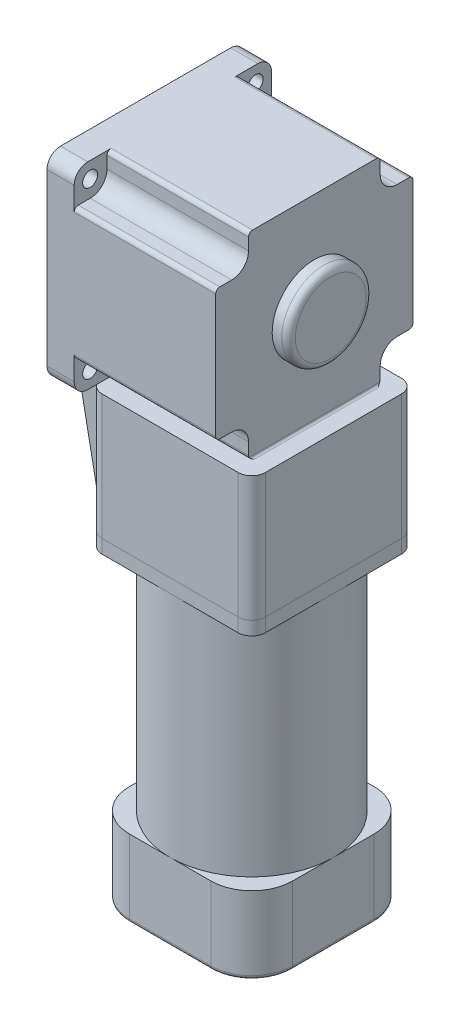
ISO-10303-21;
HEADER;
FILE_DESCRIPTION(('STEP AP214'),'2;1');
FILE_NAME('part.step','',(''),(''),'','','');
FILE_SCHEMA(('AUTOMOTIVE_DESIGN { 1 0 10303 214 1 1 1 1 }'));
ENDSEC;
DATA;
#1=APPLICATION_CONTEXT('core data for automotive mechanical design processes');
#2=APPLICATION_PROTOCOL_DEFINITION('international standard','automotive_design',2000,#1);
#3=PRODUCT_CONTEXT('',#1,'mechanical');
#4=PRODUCT('Part','Part','',(#3));
#5=PRODUCT_RELATED_PRODUCT_CATEGORY('part','',(#4));
#6=PRODUCT_DEFINITION_FORMATION('','',#4);
#7=PRODUCT_DEFINITION_CONTEXT('part definition',#1,'design');
#8=PRODUCT_DEFINITION('design','',#6,#7);
#9=PRODUCT_DEFINITION_SHAPE('','',#8);
#10=(LENGTH_UNIT() NAMED_UNIT(*) SI_UNIT(.MILLI.,.METRE.));
#11=(NAMED_UNIT(*) PLANE_ANGLE_UNIT() SI_UNIT($,.RADIAN.));
#12=(NAMED_UNIT(*) SI_UNIT($,.STERADIAN.) SOLID_ANGLE_UNIT());
#13=UNCERTAINTY_MEASURE_WITH_UNIT(LENGTH_MEASURE(1.E-05),#10,'distance_accuracy_value','');
#14=(GEOMETRIC_REPRESENTATION_CONTEXT(3) GLOBAL_UNCERTAINTY_ASSIGNED_CONTEXT((#13)) GLOBAL_UNIT_ASSIGNED_CONTEXT((#10,
#11,#12)) REPRESENTATION_CONTEXT('',''));
#15=CARTESIAN_POINT('',(0.,0.,0.));
#16=DIRECTION('',(0.,0.,1.));
#17=DIRECTION('',(1.,0.,0.));
#18=AXIS2_PLACEMENT_3D('',#15,#16,#17);
#19=CARTESIAN_POINT('',(78.,-342.5,0.));
#20=DIRECTION('',(0.,1.,0.));
#21=DIRECTION('',(0.,0.,1.));
#22=AXIS2_PLACEMENT_3D('',#19,#20,#21);
#23=CYLINDRICAL_SURFACE('',#22,60.);
#24=CARTESIAN_POINT('',(78.,-342.5,0.));
#25=DIRECTION('',(0.,-1.,0.));
#26=DIRECTION('',(0.,0.,-1.));
#27=AXIS2_PLACEMENT_3D('',#24,#25,#26);
#28=CIRCLE('',#27,60.);
#29=CARTESIAN_POINT('',(78.,-342.5,-60.));
#30=VERTEX_POINT('',#29);
#31=CARTESIAN_POINT('',(138.,-342.5,0.));
#32=VERTEX_POINT('',#31);
#33=EDGE_CURVE('E208',#30,#32,#28,.T.);
#34=ORIENTED_EDGE('',*,*,#33,.F.);
#35=CARTESIAN_POINT('',(18.,-342.5,0.));
#36=VERTEX_POINT('',#35);
#37=EDGE_CURVE('E212',#36,#30,#28,.T.);
#38=ORIENTED_EDGE('',*,*,#37,.F.);
#39=CARTESIAN_POINT('',(78.,-342.5,60.));
#40=VERTEX_POINT('',#39);
#41=EDGE_CURVE('E325',#40,#36,#28,.T.);
#42=ORIENTED_EDGE('',*,*,#41,.F.);
#43=EDGE_CURVE('E163',#32,#40,#28,.T.);
#44=ORIENTED_EDGE('',*,*,#43,.F.);
#45=EDGE_LOOP('',(#34,#38,#42,#44));
#46=FACE_BOUND('',#45,.T.);
#47=CARTESIAN_POINT('',(78.,-174.5,0.));
#48=DIRECTION('',(0.,-1.,0.));
#49=DIRECTION('',(0.,0.,-1.));
#50=AXIS2_PLACEMENT_3D('',#47,#48,#49);
#51=CIRCLE('',#50,60.);
#52=CARTESIAN_POINT('',(78.,-174.5,-60.));
#53=VERTEX_POINT('',#52);
#54=EDGE_CURVE('E154',#53,#53,#51,.T.);
#55=ORIENTED_EDGE('',*,*,#54,.T.);
#56=EDGE_LOOP('',(#55));
#57=FACE_BOUND('',#56,.T.);
#58=ADVANCED_FACE('F46',(#46,#57),#23,.T.);
#59=CARTESIAN_POINT('',(78.,-174.5,0.));
#60=DIRECTION('',(0.,-1.,0.));
#61=DIRECTION('',(0.,0.,-1.));
#62=AXIS2_PLACEMENT_3D('',#59,#60,#61);
#63=PLANE('',#62);
#64=ORIENTED_EDGE('',*,*,#54,.F.);
#65=EDGE_LOOP('',(#64));
#66=FACE_BOUND('',#65,.T.);
#67=ADVANCED_FACE('F343',(#66),#63,.F.);
#68=CARTESIAN_POINT('',(108.,-342.5,30.));
#69=DIRECTION('',(0.,1.,0.));
#70=DIRECTION('',(0.,0.,1.));
#71=AXIS2_PLACEMENT_3D('',#68,#69,#70);
#72=PLANE('',#71);
#73=DIRECTION('',(1.,0.,0.));
#74=VECTOR('',#73,1.);
#75=CARTESIAN_POINT('',(48.0000000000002,-342.5,-60.));
#76=LINE('',#75,#74);
#77=CARTESIAN_POINT('',(108.,-342.5,-60.));
#78=VERTEX_POINT('',#77);
#79=EDGE_CURVE('E185',#30,#78,#76,.T.);
#80=ORIENTED_EDGE('',*,*,#79,.F.);
#81=ORIENTED_EDGE('',*,*,#33,.T.);
#82=DIRECTION('',(0.,0.,1.));
#83=VECTOR('',#82,1.);
#84=CARTESIAN_POINT('',(138.,-342.5,-29.9999999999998));
#85=LINE('',#84,#83);
#86=CARTESIAN_POINT('',(138.,-342.5,-29.9999999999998));
#87=VERTEX_POINT('',#86);
#88=EDGE_CURVE('E193',#87,#32,#85,.T.);
#89=ORIENTED_EDGE('',*,*,#88,.F.);
#90=CARTESIAN_POINT('',(108.,-342.5,-30.));
#91=DIRECTION('',(0.,-1.,0.));
#92=DIRECTION('',(0.,0.,-1.));
#93=AXIS2_PLACEMENT_3D('',#90,#91,#92);
#94=CIRCLE('',#93,30.);
#95=EDGE_CURVE('E189',#78,#87,#94,.T.);
#96=ORIENTED_EDGE('',*,*,#95,.F.);
#97=EDGE_LOOP('',(#80,#81,#89,#96));
#98=FACE_BOUND('',#97,.T.);
#99=ADVANCED_FACE('F327',(#98),#72,.T.);
#100=CARTESIAN_POINT('',(138.,-342.5,29.9999999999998));
#101=VERTEX_POINT('',#100);
#102=EDGE_CURVE('E192',#32,#101,#85,.T.);
#103=ORIENTED_EDGE('',*,*,#102,.F.);
#104=ORIENTED_EDGE('',*,*,#43,.T.);
#105=DIRECTION('',(-1.,0.,0.));
#106=VECTOR('',#105,1.);
#107=CARTESIAN_POINT('',(48.0000000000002,-342.5,60.));
#108=LINE('',#107,#106);
#109=CARTESIAN_POINT('',(108.,-342.5,60.));
#110=VERTEX_POINT('',#109);
#111=EDGE_CURVE('E150',#110,#40,#108,.T.);
#112=ORIENTED_EDGE('',*,*,#111,.F.);
#113=CARTESIAN_POINT('',(108.,-342.5,30.));
#114=DIRECTION('',(0.,-1.,0.));
#115=DIRECTION('',(0.,0.,1.));
#116=AXIS2_PLACEMENT_3D('',#113,#114,#115);
#117=CIRCLE('',#116,30.);
#118=EDGE_CURVE('E162',#101,#110,#117,.T.);
#119=ORIENTED_EDGE('',*,*,#118,.F.);
#120=EDGE_LOOP('',(#103,#104,#112,#119));
#121=FACE_BOUND('',#120,.T.);
#122=ADVANCED_FACE('F161',(#121),#72,.T.);
#123=CARTESIAN_POINT('',(48.0000000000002,-342.5,60.));
#124=VERTEX_POINT('',#123);
#125=EDGE_CURVE('E166',#40,#124,#108,.T.);
#126=ORIENTED_EDGE('',*,*,#125,.F.);
#127=ORIENTED_EDGE('',*,*,#41,.T.);
#128=DIRECTION('',(0.,0.,-1.));
#129=VECTOR('',#128,1.);
#130=CARTESIAN_POINT('',(18.,-342.5,-29.9999999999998));
#131=LINE('',#130,#129);
#132=CARTESIAN_POINT('',(18.,-342.5,29.9999999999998));
#133=VERTEX_POINT('',#132);
#134=EDGE_CURVE('E179',#133,#36,#131,.T.);
#135=ORIENTED_EDGE('',*,*,#134,.F.);
#136=CARTESIAN_POINT('',(48.,-342.5,30.));
#137=DIRECTION('',(0.,-1.,0.));
#138=DIRECTION('',(0.,0.,1.));
#139=AXIS2_PLACEMENT_3D('',#136,#137,#138);
#140=CIRCLE('',#139,30.);
#141=EDGE_CURVE('E165',#124,#133,#140,.T.);
#142=ORIENTED_EDGE('',*,*,#141,.F.);
#143=EDGE_LOOP('',(#126,#127,#135,#142));
#144=FACE_BOUND('',#143,.T.);
#145=ADVANCED_FACE('F331',(#144),#72,.T.);
#146=CARTESIAN_POINT('',(108.,-399.5,30.));
#147=DIRECTION('',(0.,1.,0.));
#148=DIRECTION('',(0.,0.,1.));
#149=AXIS2_PLACEMENT_3D('',#146,#147,#148);
#150=CYLINDRICAL_SURFACE('',#149,30.);
#151=DIRECTION('',(0.,1.,0.));
#152=VECTOR('',#151,1.);
#153=CARTESIAN_POINT('',(108.,-399.5,60.));
#154=LINE('',#153,#152);
#155=CARTESIAN_POINT('',(108.,-396.5,60.));
#156=VERTEX_POINT('',#155);
#157=EDGE_CURVE('E146',#156,#110,#154,.T.);
#158=ORIENTED_EDGE('',*,*,#157,.F.);
#159=CARTESIAN_POINT('',(108.,-396.5,30.));
#160=DIRECTION('',(0.,1.,0.));
#161=DIRECTION('',(0.,0.,1.));
#162=AXIS2_PLACEMENT_3D('',#159,#160,#161);
#163=CIRCLE('',#162,30.);
#164=CARTESIAN_POINT('',(138.,-396.5,29.9999999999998));
#165=VERTEX_POINT('',#164);
#166=EDGE_CURVE('E12',#156,#165,#163,.T.);
#167=ORIENTED_EDGE('',*,*,#166,.T.);
#168=DIRECTION('',(0.,1.,0.));
#169=VECTOR('',#168,1.);
#170=CARTESIAN_POINT('',(138.,-399.5,29.9999999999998));
#171=LINE('',#170,#169);
#172=EDGE_CURVE('E170',#165,#101,#171,.T.);
#173=ORIENTED_EDGE('',*,*,#172,.T.);
#174=ORIENTED_EDGE('',*,*,#118,.T.);
#175=EDGE_LOOP('',(#158,#167,#173,#174));
#176=FACE_BOUND('',#175,.T.);
#177=ADVANCED_FACE('F168',(#176),#150,.T.);
#178=CARTESIAN_POINT('',(48.0000000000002,-399.5,60.));
#179=DIRECTION('',(0.,0.,-1.));
#180=DIRECTION('',(-1.,0.,0.));
#181=AXIS2_PLACEMENT_3D('',#178,#179,#180);
#182=PLANE('',#181);
#183=DIRECTION('',(0.,1.,0.));
#184=VECTOR('',#183,1.);
#185=CARTESIAN_POINT('',(48.0000000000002,-399.5,60.));
#186=LINE('',#185,#184);
#187=CARTESIAN_POINT('',(48.0000000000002,-396.5,60.));
#188=VERTEX_POINT('',#187);
#189=EDGE_CURVE('E155',#188,#124,#186,.T.);
#190=ORIENTED_EDGE('',*,*,#189,.F.);
#191=DIRECTION('',(-1.,0.,0.));
#192=VECTOR('',#191,1.);
#193=CARTESIAN_POINT('',(48.0000000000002,-396.5,60.));
#194=LINE('',#193,#192);
#195=EDGE_CURVE('E55',#188,#156,#194,.F.);
#196=ORIENTED_EDGE('',*,*,#195,.T.);
#197=ORIENTED_EDGE('',*,*,#157,.T.);
#198=ORIENTED_EDGE('',*,*,#111,.T.);
#199=ORIENTED_EDGE('',*,*,#125,.T.);
#200=EDGE_LOOP('',(#190,#196,#197,#198,#199));
#201=FACE_BOUND('',#200,.T.);
#202=ADVANCED_FACE('F148',(#201),#182,.F.);
#203=CARTESIAN_POINT('',(48.,-399.5,30.));
#204=DIRECTION('',(0.,1.,0.));
#205=DIRECTION('',(0.,0.,1.));
#206=AXIS2_PLACEMENT_3D('',#203,#204,#205);
#207=CYLINDRICAL_SURFACE('',#206,30.);
#208=DIRECTION('',(0.,1.,0.));
#209=VECTOR('',#208,1.);
#210=CARTESIAN_POINT('',(18.,-399.5,29.9999999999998));
#211=LINE('',#210,#209);
#212=CARTESIAN_POINT('',(18.,-396.5,29.9999999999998));
#213=VERTEX_POINT('',#212);
#214=EDGE_CURVE('E205',#213,#133,#211,.T.);
#215=ORIENTED_EDGE('',*,*,#214,.F.);
#216=CARTESIAN_POINT('',(48.,-396.5,30.));
#217=DIRECTION('',(0.,1.,0.));
#218=DIRECTION('',(0.,0.,1.));
#219=AXIS2_PLACEMENT_3D('',#216,#217,#218);
#220=CIRCLE('',#219,30.);
#221=EDGE_CURVE('E70',#213,#188,#220,.T.);
#222=ORIENTED_EDGE('',*,*,#221,.T.);
#223=ORIENTED_EDGE('',*,*,#189,.T.);
#224=ORIENTED_EDGE('',*,*,#141,.T.);
#225=EDGE_LOOP('',(#215,#222,#223,#224));
#226=FACE_BOUND('',#225,.T.);
#227=ADVANCED_FACE('F333',(#226),#207,.T.);
#228=CARTESIAN_POINT('',(18.,-399.5,-29.9999999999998));
#229=DIRECTION('',(1.,0.,0.));
#230=DIRECTION('',(0.,0.,-1.));
#231=AXIS2_PLACEMENT_3D('',#228,#229,#230);
#232=PLANE('',#231);
#233=DIRECTION('',(0.,1.,0.));
#234=VECTOR('',#233,1.);
#235=CARTESIAN_POINT('',(18.,-399.5,-29.9999999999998));
#236=LINE('',#235,#234);
#237=CARTESIAN_POINT('',(18.,-396.5,-29.9999999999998));
#238=VERTEX_POINT('',#237);
#239=CARTESIAN_POINT('',(18.,-342.5,-29.9999999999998));
#240=VERTEX_POINT('',#239);
#241=EDGE_CURVE('E203',#238,#240,#236,.T.);
#242=ORIENTED_EDGE('',*,*,#241,.F.);
#243=DIRECTION('',(0.,0.,-1.));
#244=VECTOR('',#243,1.);
#245=CARTESIAN_POINT('',(18.,-396.5,-29.9999999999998));
#246=LINE('',#245,#244);
#247=EDGE_CURVE('E240',#238,#213,#246,.F.);
#248=ORIENTED_EDGE('',*,*,#247,.T.);
#249=ORIENTED_EDGE('',*,*,#214,.T.);
#250=ORIENTED_EDGE('',*,*,#134,.T.);
#251=EDGE_CURVE('E178',#36,#240,#131,.T.);
#252=ORIENTED_EDGE('',*,*,#251,.T.);
#253=EDGE_LOOP('',(#242,#248,#249,#250,#252));
#254=FACE_BOUND('',#253,.T.);
#255=ADVANCED_FACE('F315',(#254),#232,.F.);
#256=CARTESIAN_POINT('',(48.,-399.5,-30.));
#257=DIRECTION('',(0.,1.,0.));
#258=DIRECTION('',(0.,0.,1.));
#259=AXIS2_PLACEMENT_3D('',#256,#257,#258);
#260=CYLINDRICAL_SURFACE('',#259,30.);
#261=DIRECTION('',(0.,1.,0.));
#262=VECTOR('',#261,1.);
#263=CARTESIAN_POINT('',(48.0000000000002,-399.5,-60.));
#264=LINE('',#263,#262);
#265=CARTESIAN_POINT('',(48.0000000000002,-396.5,-60.));
#266=VERTEX_POINT('',#265);
#267=CARTESIAN_POINT('',(48.0000000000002,-342.5,-60.));
#268=VERTEX_POINT('',#267);
#269=EDGE_CURVE('E201',#266,#268,#264,.T.);
#270=ORIENTED_EDGE('',*,*,#269,.F.);
#271=CARTESIAN_POINT('',(48.,-396.5,-30.));
#272=DIRECTION('',(0.,1.,0.));
#273=DIRECTION('',(0.,0.,1.));
#274=AXIS2_PLACEMENT_3D('',#271,#272,#273);
#275=CIRCLE('',#274,30.);
#276=EDGE_CURVE('E238',#266,#238,#275,.T.);
#277=ORIENTED_EDGE('',*,*,#276,.T.);
#278=ORIENTED_EDGE('',*,*,#241,.T.);
#279=CARTESIAN_POINT('',(48.,-342.5,-30.));
#280=DIRECTION('',(0.,-1.,0.));
#281=DIRECTION('',(0.,0.,1.));
#282=AXIS2_PLACEMENT_3D('',#279,#280,#281);
#283=CIRCLE('',#282,30.);
#284=EDGE_CURVE('E182',#240,#268,#283,.T.);
#285=ORIENTED_EDGE('',*,*,#284,.T.);
#286=EDGE_LOOP('',(#270,#277,#278,#285));
#287=FACE_BOUND('',#286,.T.);
#288=ADVANCED_FACE('F312',(#287),#260,.T.);
#289=CARTESIAN_POINT('',(48.0000000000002,-399.5,-60.));
#290=DIRECTION('',(0.,0.,1.));
#291=DIRECTION('',(1.,0.,0.));
#292=AXIS2_PLACEMENT_3D('',#289,#290,#291);
#293=PLANE('',#292);
#294=DIRECTION('',(0.,1.,0.));
#295=VECTOR('',#294,1.);
#296=CARTESIAN_POINT('',(108.,-399.5,-60.));
#297=LINE('',#296,#295);
#298=CARTESIAN_POINT('',(108.,-396.5,-60.));
#299=VERTEX_POINT('',#298);
#300=EDGE_CURVE('E199',#299,#78,#297,.T.);
#301=ORIENTED_EDGE('',*,*,#300,.F.);
#302=DIRECTION('',(1.,0.,0.));
#303=VECTOR('',#302,1.);
#304=CARTESIAN_POINT('',(48.0000000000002,-396.5,-60.));
#305=LINE('',#304,#303);
#306=EDGE_CURVE('E236',#299,#266,#305,.F.);
#307=ORIENTED_EDGE('',*,*,#306,.T.);
#308=ORIENTED_EDGE('',*,*,#269,.T.);
#309=EDGE_CURVE('E186',#268,#30,#76,.T.);
#310=ORIENTED_EDGE('',*,*,#309,.T.);
#311=ORIENTED_EDGE('',*,*,#79,.T.);
#312=EDGE_LOOP('',(#301,#307,#308,#310,#311));
#313=FACE_BOUND('',#312,.T.);
#314=ADVANCED_FACE('F300',(#313),#293,.F.);
#315=CARTESIAN_POINT('',(108.,-399.5,-30.));
#316=DIRECTION('',(0.,1.,0.));
#317=DIRECTION('',(0.,0.,1.));
#318=AXIS2_PLACEMENT_3D('',#315,#316,#317);
#319=CYLINDRICAL_SURFACE('',#318,30.);
#320=DIRECTION('',(0.,1.,0.));
#321=VECTOR('',#320,1.);
#322=CARTESIAN_POINT('',(138.,-399.5,-29.9999999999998));
#323=LINE('',#322,#321);
#324=CARTESIAN_POINT('',(138.,-396.5,-29.9999999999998));
#325=VERTEX_POINT('',#324);
#326=EDGE_CURVE('E197',#325,#87,#323,.T.);
#327=ORIENTED_EDGE('',*,*,#326,.F.);
#328=CARTESIAN_POINT('',(108.,-396.5,-30.));
#329=DIRECTION('',(0.,1.,0.));
#330=DIRECTION('',(0.,0.,1.));
#331=AXIS2_PLACEMENT_3D('',#328,#329,#330);
#332=CIRCLE('',#331,30.);
#333=EDGE_CURVE('E234',#325,#299,#332,.T.);
#334=ORIENTED_EDGE('',*,*,#333,.T.);
#335=ORIENTED_EDGE('',*,*,#300,.T.);
#336=ORIENTED_EDGE('',*,*,#95,.T.);
#337=EDGE_LOOP('',(#327,#334,#335,#336));
#338=FACE_BOUND('',#337,.T.);
#339=ADVANCED_FACE('F296',(#338),#319,.T.);
#340=CARTESIAN_POINT('',(138.,-399.5,-29.9999999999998));
#341=DIRECTION('',(-1.,0.,0.));
#342=DIRECTION('',(0.,0.,1.));
#343=AXIS2_PLACEMENT_3D('',#340,#341,#342);
#344=PLANE('',#343);
#345=ORIENTED_EDGE('',*,*,#172,.F.);
#346=DIRECTION('',(0.,0.,1.));
#347=VECTOR('',#346,1.);
#348=CARTESIAN_POINT('',(138.,-396.5,-29.9999999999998));
#349=LINE('',#348,#347);
#350=EDGE_CURVE('E231',#165,#325,#349,.F.);
#351=ORIENTED_EDGE('',*,*,#350,.T.);
#352=ORIENTED_EDGE('',*,*,#326,.T.);
#353=ORIENTED_EDGE('',*,*,#88,.T.);
#354=ORIENTED_EDGE('',*,*,#102,.T.);
#355=EDGE_LOOP('',(#345,#351,#352,#353,#354));
#356=FACE_BOUND('',#355,.T.);
#357=ADVANCED_FACE('F283',(#356),#344,.F.);
#358=CARTESIAN_POINT('',(108.,-399.5,30.));
#359=DIRECTION('',(0.,1.,0.));
#360=DIRECTION('',(0.,0.,1.));
#361=AXIS2_PLACEMENT_3D('',#358,#359,#360);
#362=PLANE('',#361);
#363=CARTESIAN_POINT('',(108.,-399.5,-30.));
#364=DIRECTION('',(0.,1.,0.));
#365=DIRECTION('',(0.,0.,1.));
#366=AXIS2_PLACEMENT_3D('',#363,#364,#365);
#367=CIRCLE('',#366,27.);
#368=CARTESIAN_POINT('',(108.,-399.5,-57.));
#369=VERTEX_POINT('',#368);
#370=CARTESIAN_POINT('',(135.,-399.5,-29.9999999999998));
#371=VERTEX_POINT('',#370);
#372=EDGE_CURVE('E226',#369,#371,#367,.F.);
#373=ORIENTED_EDGE('',*,*,#372,.T.);
#374=DIRECTION('',(0.,0.,1.));
#375=VECTOR('',#374,1.);
#376=CARTESIAN_POINT('',(135.,-399.5,30.));
#377=LINE('',#376,#375);
#378=CARTESIAN_POINT('',(135.,-399.5,29.9999999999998));
#379=VERTEX_POINT('',#378);
#380=EDGE_CURVE('E228',#371,#379,#377,.T.);
#381=ORIENTED_EDGE('',*,*,#380,.T.);
#382=CARTESIAN_POINT('',(108.,-399.5,30.));
#383=DIRECTION('',(0.,1.,0.));
#384=DIRECTION('',(0.,0.,1.));
#385=AXIS2_PLACEMENT_3D('',#382,#383,#384);
#386=CIRCLE('',#385,27.);
#387=CARTESIAN_POINT('',(108.,-399.5,57.));
#388=VERTEX_POINT('',#387);
#389=EDGE_CURVE('E211',#379,#388,#386,.F.);
#390=ORIENTED_EDGE('',*,*,#389,.T.);
#391=DIRECTION('',(-1.,0.,0.));
#392=VECTOR('',#391,1.);
#393=CARTESIAN_POINT('',(108.,-399.5,57.));
#394=LINE('',#393,#392);
#395=CARTESIAN_POINT('',(48.0000000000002,-399.5,57.));
#396=VERTEX_POINT('',#395);
#397=EDGE_CURVE('E216',#388,#396,#394,.T.);
#398=ORIENTED_EDGE('',*,*,#397,.T.);
#399=CARTESIAN_POINT('',(48.,-399.5,30.));
#400=DIRECTION('',(0.,1.,0.));
#401=DIRECTION('',(0.,0.,1.));
#402=AXIS2_PLACEMENT_3D('',#399,#400,#401);
#403=CIRCLE('',#402,27.);
#404=CARTESIAN_POINT('',(21.,-399.5,29.9999999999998));
#405=VERTEX_POINT('',#404);
#406=EDGE_CURVE('E218',#396,#405,#403,.F.);
#407=ORIENTED_EDGE('',*,*,#406,.T.);
#408=DIRECTION('',(0.,0.,-1.));
#409=VECTOR('',#408,1.);
#410=CARTESIAN_POINT('',(21.,-399.5,30.));
#411=LINE('',#410,#409);
#412=CARTESIAN_POINT('',(21.,-399.5,-29.9999999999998));
#413=VERTEX_POINT('',#412);
#414=EDGE_CURVE('E220',#405,#413,#411,.T.);
#415=ORIENTED_EDGE('',*,*,#414,.T.);
#416=CARTESIAN_POINT('',(48.,-399.5,-30.));
#417=DIRECTION('',(0.,1.,0.));
#418=DIRECTION('',(0.,0.,1.));
#419=AXIS2_PLACEMENT_3D('',#416,#417,#418);
#420=CIRCLE('',#419,27.);
#421=CARTESIAN_POINT('',(48.0000000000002,-399.5,-57.));
#422=VERTEX_POINT('',#421);
#423=EDGE_CURVE('E222',#413,#422,#420,.F.);
#424=ORIENTED_EDGE('',*,*,#423,.T.);
#425=DIRECTION('',(1.,0.,0.));
#426=VECTOR('',#425,1.);
#427=CARTESIAN_POINT('',(108.,-399.5,-57.));
#428=LINE('',#427,#426);
#429=EDGE_CURVE('E224',#422,#369,#428,.T.);
#430=ORIENTED_EDGE('',*,*,#429,.T.);
#431=EDGE_LOOP('',(#373,#381,#390,#398,#407,#415,#424,#430));
#432=FACE_BOUND('',#431,.T.);
#433=ADVANCED_FACE('F271',(#432),#362,.F.);
#434=ORIENTED_EDGE('',*,*,#251,.F.);
#435=ORIENTED_EDGE('',*,*,#37,.T.);
#436=ORIENTED_EDGE('',*,*,#309,.F.);
#437=ORIENTED_EDGE('',*,*,#284,.F.);
#438=EDGE_LOOP('',(#434,#435,#436,#437));
#439=FACE_BOUND('',#438,.T.);
#440=ADVANCED_FACE('F322',(#439),#72,.T.);
#441=CARTESIAN_POINT('',(21.,-396.5,30.));
#442=DIRECTION('',(0.,0.,-1.));
#443=DIRECTION('',(-1.,0.,0.));
#444=AXIS2_PLACEMENT_3D('',#441,#442,#443);
#445=CYLINDRICAL_SURFACE('',#444,3.);
#446=CARTESIAN_POINT('',(21.,-396.5,29.9999999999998));
#447=DIRECTION('',(0.,0.,1.));
#448=DIRECTION('',(1.,0.,0.));
#449=AXIS2_PLACEMENT_3D('',#446,#447,#448);
#450=CIRCLE('',#449,3.);
#451=EDGE_CURVE('E174',#213,#405,#450,.T.);
#452=ORIENTED_EDGE('',*,*,#451,.F.);
#453=ORIENTED_EDGE('',*,*,#247,.F.);
#454=CARTESIAN_POINT('',(21.,-396.5,-29.9999999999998));
#455=DIRECTION('',(0.,0.,-1.));
#456=DIRECTION('',(-1.,0.,0.));
#457=AXIS2_PLACEMENT_3D('',#454,#455,#456);
#458=CIRCLE('',#457,3.);
#459=EDGE_CURVE('E50',#413,#238,#458,.T.);
#460=ORIENTED_EDGE('',*,*,#459,.F.);
#461=ORIENTED_EDGE('',*,*,#414,.F.);
#462=EDGE_LOOP('',(#452,#453,#460,#461));
#463=FACE_BOUND('',#462,.T.);
#464=ADVANCED_FACE('F48',(#463),#445,.T.);
#465=CARTESIAN_POINT('',(48.,-396.5,-30.));
#466=DIRECTION('',(0.,1.,0.));
#467=DIRECTION('',(0.,0.,1.));
#468=AXIS2_PLACEMENT_3D('',#465,#466,#467);
#469=TOROIDAL_SURFACE('',#468,27.,3.);
#470=ORIENTED_EDGE('',*,*,#459,.T.);
#471=ORIENTED_EDGE('',*,*,#276,.F.);
#472=CARTESIAN_POINT('',(48.0000000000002,-396.5,-57.));
#473=DIRECTION('',(1.,0.,0.));
#474=DIRECTION('',(0.,0.,-1.));
#475=AXIS2_PLACEMENT_3D('',#472,#473,#474);
#476=CIRCLE('',#475,3.);
#477=EDGE_CURVE('E257',#422,#266,#476,.T.);
#478=ORIENTED_EDGE('',*,*,#477,.F.);
#479=ORIENTED_EDGE('',*,*,#423,.F.);
#480=EDGE_LOOP('',(#470,#471,#478,#479));
#481=FACE_BOUND('',#480,.T.);
#482=ADVANCED_FACE('F309',(#481),#469,.T.);
#483=CARTESIAN_POINT('',(48.,-396.5,30.));
#484=DIRECTION('',(0.,1.,0.));
#485=DIRECTION('',(0.,0.,1.));
#486=AXIS2_PLACEMENT_3D('',#483,#484,#485);
#487=TOROIDAL_SURFACE('',#486,27.,3.);
#488=ORIENTED_EDGE('',*,*,#451,.T.);
#489=ORIENTED_EDGE('',*,*,#406,.F.);
#490=CARTESIAN_POINT('',(48.0000000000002,-396.5,57.));
#491=DIRECTION('',(1.,0.,0.));
#492=DIRECTION('',(0.,0.,-1.));
#493=AXIS2_PLACEMENT_3D('',#490,#491,#492);
#494=CIRCLE('',#493,3.);
#495=EDGE_CURVE('E254',#188,#396,#494,.T.);
#496=ORIENTED_EDGE('',*,*,#495,.F.);
#497=ORIENTED_EDGE('',*,*,#221,.F.);
#498=EDGE_LOOP('',(#488,#489,#496,#497));
#499=FACE_BOUND('',#498,.T.);
#500=ADVANCED_FACE('F263',(#499),#487,.T.);
#501=CARTESIAN_POINT('',(108.,-396.5,-57.));
#502=DIRECTION('',(1.,0.,0.));
#503=DIRECTION('',(0.,0.,-1.));
#504=AXIS2_PLACEMENT_3D('',#501,#502,#503);
#505=CYLINDRICAL_SURFACE('',#504,3.);
#506=ORIENTED_EDGE('',*,*,#477,.T.);
#507=ORIENTED_EDGE('',*,*,#306,.F.);
#508=CARTESIAN_POINT('',(108.,-396.5,-57.));
#509=DIRECTION('',(1.,0.,0.));
#510=DIRECTION('',(0.,0.,-1.));
#511=AXIS2_PLACEMENT_3D('',#508,#509,#510);
#512=CIRCLE('',#511,3.);
#513=EDGE_CURVE('E251',#369,#299,#512,.T.);
#514=ORIENTED_EDGE('',*,*,#513,.F.);
#515=ORIENTED_EDGE('',*,*,#429,.F.);
#516=EDGE_LOOP('',(#506,#507,#514,#515));
#517=FACE_BOUND('',#516,.T.);
#518=ADVANCED_FACE('F305',(#517),#505,.T.);
#519=CARTESIAN_POINT('',(108.,-396.5,57.));
#520=DIRECTION('',(-1.,0.,0.));
#521=DIRECTION('',(0.,0.,1.));
#522=AXIS2_PLACEMENT_3D('',#519,#520,#521);
#523=CYLINDRICAL_SURFACE('',#522,3.);
#524=ORIENTED_EDGE('',*,*,#495,.T.);
#525=ORIENTED_EDGE('',*,*,#397,.F.);
#526=CARTESIAN_POINT('',(108.,-396.5,57.));
#527=DIRECTION('',(1.,0.,0.));
#528=DIRECTION('',(0.,0.,-1.));
#529=AXIS2_PLACEMENT_3D('',#526,#527,#528);
#530=CIRCLE('',#529,3.);
#531=EDGE_CURVE('E248',#156,#388,#530,.T.);
#532=ORIENTED_EDGE('',*,*,#531,.F.);
#533=ORIENTED_EDGE('',*,*,#195,.F.);
#534=EDGE_LOOP('',(#524,#525,#532,#533));
#535=FACE_BOUND('',#534,.T.);
#536=ADVANCED_FACE('F276',(#535),#523,.T.);
#537=CARTESIAN_POINT('',(108.,-396.5,-30.));
#538=DIRECTION('',(0.,1.,0.));
#539=DIRECTION('',(0.,0.,1.));
#540=AXIS2_PLACEMENT_3D('',#537,#538,#539);
#541=TOROIDAL_SURFACE('',#540,27.,3.);
#542=ORIENTED_EDGE('',*,*,#513,.T.);
#543=ORIENTED_EDGE('',*,*,#333,.F.);
#544=CARTESIAN_POINT('',(135.,-396.5,-29.9999999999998));
#545=DIRECTION('',(0.,0.,1.));
#546=DIRECTION('',(1.,0.,0.));
#547=AXIS2_PLACEMENT_3D('',#544,#545,#546);
#548=CIRCLE('',#547,3.);
#549=EDGE_CURVE('E246',#371,#325,#548,.T.);
#550=ORIENTED_EDGE('',*,*,#549,.F.);
#551=ORIENTED_EDGE('',*,*,#372,.F.);
#552=EDGE_LOOP('',(#542,#543,#550,#551));
#553=FACE_BOUND('',#552,.T.);
#554=ADVANCED_FACE('F292',(#553),#541,.T.);
#555=CARTESIAN_POINT('',(108.,-396.5,30.));
#556=DIRECTION('',(0.,1.,0.));
#557=DIRECTION('',(0.,0.,1.));
#558=AXIS2_PLACEMENT_3D('',#555,#556,#557);
#559=TOROIDAL_SURFACE('',#558,27.,3.);
#560=ORIENTED_EDGE('',*,*,#531,.T.);
#561=ORIENTED_EDGE('',*,*,#389,.F.);
#562=CARTESIAN_POINT('',(135.,-396.5,29.9999999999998));
#563=DIRECTION('',(0.,0.,-1.));
#564=DIRECTION('',(-1.,0.,0.));
#565=AXIS2_PLACEMENT_3D('',#562,#563,#564);
#566=CIRCLE('',#565,3.);
#567=EDGE_CURVE('E244',#165,#379,#566,.T.);
#568=ORIENTED_EDGE('',*,*,#567,.F.);
#569=ORIENTED_EDGE('',*,*,#166,.F.);
#570=EDGE_LOOP('',(#560,#561,#568,#569));
#571=FACE_BOUND('',#570,.T.);
#572=ADVANCED_FACE('F279',(#571),#559,.T.);
#573=CARTESIAN_POINT('',(135.,-396.5,30.));
#574=DIRECTION('',(0.,0.,1.));
#575=DIRECTION('',(1.,0.,0.));
#576=AXIS2_PLACEMENT_3D('',#573,#574,#575);
#577=CYLINDRICAL_SURFACE('',#576,3.);
#578=ORIENTED_EDGE('',*,*,#549,.T.);
#579=ORIENTED_EDGE('',*,*,#350,.F.);
#580=ORIENTED_EDGE('',*,*,#567,.T.);
#581=ORIENTED_EDGE('',*,*,#380,.F.);
#582=EDGE_LOOP('',(#578,#579,#580,#581));
#583=FACE_BOUND('',#582,.T.);
#584=ADVANCED_FACE('F286',(#583),#577,.T.);
#585=CLOSED_SHELL('',(#58,#67,#99,#122,#145,#177,#202,#227,#255,#288,#314,#339,#357,#433,#440,
#464,#482,#500,#518,#536,#554,#572,#584));
#586=MANIFOLD_SOLID_BREP('B2',#585);
#587=CARTESIAN_POINT('',(128.,-174.5,-50.));
#588=DIRECTION('',(0.,1.,0.));
#589=DIRECTION('',(0.,0.,1.));
#590=AXIS2_PLACEMENT_3D('',#587,#588,#589);
#591=CYLINDRICAL_SURFACE('',#590,10.);
#592=CARTESIAN_POINT('',(128.,-164.5,-50.));
#593=DIRECTION('',(0.,-1.,0.));
#594=DIRECTION('',(0.,0.,-1.));
#595=AXIS2_PLACEMENT_3D('',#592,#593,#594);
#596=CIRCLE('',#595,10.);
#597=CARTESIAN_POINT('',(128.,-164.5,-60.));
#598=VERTEX_POINT('',#597);
#599=CARTESIAN_POINT('',(138.,-164.5,-50.));
#600=VERTEX_POINT('',#599);
#601=EDGE_CURVE('E624',#598,#600,#596,.T.);
#602=ORIENTED_EDGE('',*,*,#601,.T.);
#603=DIRECTION('',(0.,1.,0.));
#604=VECTOR('',#603,1.);
#605=CARTESIAN_POINT('',(138.,-174.5,-50.));
#606=LINE('',#605,#604);
#607=CARTESIAN_POINT('',(138.,-174.5,-50.));
#608=VERTEX_POINT('',#607);
#609=EDGE_CURVE('E44',#608,#600,#606,.T.);
#610=ORIENTED_EDGE('',*,*,#609,.F.);
#611=CARTESIAN_POINT('',(128.,-174.5,-50.));
#612=DIRECTION('',(0.,-1.,0.));
#613=DIRECTION('',(0.,0.,-1.));
#614=AXIS2_PLACEMENT_3D('',#611,#612,#613);
#615=CIRCLE('',#614,10.);
#616=CARTESIAN_POINT('',(128.,-174.5,-60.));
#617=VERTEX_POINT('',#616);
#618=EDGE_CURVE('E638',#617,#608,#615,.T.);
#619=ORIENTED_EDGE('',*,*,#618,.F.);
#620=DIRECTION('',(0.,1.,0.));
#621=VECTOR('',#620,1.);
#622=CARTESIAN_POINT('',(128.,-174.5,-60.));
#623=LINE('',#622,#621);
#624=EDGE_CURVE('E620',#617,#598,#623,.T.);
#625=ORIENTED_EDGE('',*,*,#624,.T.);
#626=EDGE_LOOP('',(#602,#610,#619,#625));
#627=FACE_BOUND('',#626,.T.);
#628=ADVANCED_FACE('F528',(#627),#591,.T.);
#629=CARTESIAN_POINT('',(138.,-174.5,-50.));
#630=DIRECTION('',(-1.,0.,0.));
#631=DIRECTION('',(0.,0.,1.));
#632=AXIS2_PLACEMENT_3D('',#629,#630,#631);
#633=PLANE('',#632);
#634=DIRECTION('',(0.,0.,1.));
#635=VECTOR('',#634,1.);
#636=CARTESIAN_POINT('',(138.,-164.5,-50.));
#637=LINE('',#636,#635);
#638=CARTESIAN_POINT('',(138.,-164.5,49.9999999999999));
#639=VERTEX_POINT('',#638);
#640=EDGE_CURVE('E627',#600,#639,#637,.T.);
#641=ORIENTED_EDGE('',*,*,#640,.T.);
#642=DIRECTION('',(0.,1.,0.));
#643=VECTOR('',#642,1.);
#644=CARTESIAN_POINT('',(138.,-174.5,49.9999999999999));
#645=LINE('',#644,#643);
#646=CARTESIAN_POINT('',(138.,-174.5,49.9999999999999));
#647=VERTEX_POINT('',#646);
#648=EDGE_CURVE('E536',#647,#639,#645,.T.);
#649=ORIENTED_EDGE('',*,*,#648,.F.);
#650=DIRECTION('',(0.,0.,1.));
#651=VECTOR('',#650,1.);
#652=CARTESIAN_POINT('',(138.,-174.5,-50.));
#653=LINE('',#652,#651);
#654=EDGE_CURVE('E587',#608,#647,#653,.T.);
#655=ORIENTED_EDGE('',*,*,#654,.F.);
#656=ORIENTED_EDGE('',*,*,#609,.T.);
#657=EDGE_LOOP('',(#641,#649,#655,#656));
#658=FACE_BOUND('',#657,.T.);
#659=ADVANCED_FACE('F673',(#658),#633,.F.);
#660=CARTESIAN_POINT('',(128.,-174.5,50.));
#661=DIRECTION('',(0.,1.,0.));
#662=DIRECTION('',(0.,0.,1.));
#663=AXIS2_PLACEMENT_3D('',#660,#661,#662);
#664=CYLINDRICAL_SURFACE('',#663,10.);
#665=CARTESIAN_POINT('',(128.,-164.5,50.));
#666=DIRECTION('',(0.,-1.,0.));
#667=DIRECTION('',(0.,0.,1.));
#668=AXIS2_PLACEMENT_3D('',#665,#666,#667);
#669=CIRCLE('',#668,10.);
#670=CARTESIAN_POINT('',(128.,-164.5,60.));
#671=VERTEX_POINT('',#670);
#672=EDGE_CURVE('E629',#639,#671,#669,.T.);
#673=ORIENTED_EDGE('',*,*,#672,.T.);
#674=DIRECTION('',(0.,1.,0.));
#675=VECTOR('',#674,1.);
#676=CARTESIAN_POINT('',(128.,-174.5,60.));
#677=LINE('',#676,#675);
#678=CARTESIAN_POINT('',(128.,-174.5,60.));
#679=VERTEX_POINT('',#678);
#680=EDGE_CURVE('E645',#679,#671,#677,.T.);
#681=ORIENTED_EDGE('',*,*,#680,.F.);
#682=CARTESIAN_POINT('',(128.,-174.5,50.));
#683=DIRECTION('',(0.,-1.,0.));
#684=DIRECTION('',(0.,0.,1.));
#685=AXIS2_PLACEMENT_3D('',#682,#683,#684);
#686=CIRCLE('',#685,10.);
#687=EDGE_CURVE('E653',#647,#679,#686,.T.);
#688=ORIENTED_EDGE('',*,*,#687,.F.);
#689=ORIENTED_EDGE('',*,*,#648,.T.);
#690=EDGE_LOOP('',(#673,#681,#688,#689));
#691=FACE_BOUND('',#690,.T.);
#692=ADVANCED_FACE('F651',(#691),#664,.T.);
#693=CARTESIAN_POINT('',(28.0000000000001,-174.5,60.));
#694=DIRECTION('',(0.,0.,-1.));
#695=DIRECTION('',(-1.,0.,0.));
#696=AXIS2_PLACEMENT_3D('',#693,#694,#695);
#697=PLANE('',#696);
#698=DIRECTION('',(-1.,0.,0.));
#699=VECTOR('',#698,1.);
#700=CARTESIAN_POINT('',(28.0000000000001,-164.5,60.));
#701=LINE('',#700,#699);
#702=CARTESIAN_POINT('',(28.0000000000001,-164.5,60.));
#703=VERTEX_POINT('',#702);
#704=EDGE_CURVE('E631',#671,#703,#701,.T.);
#705=ORIENTED_EDGE('',*,*,#704,.T.);
#706=DIRECTION('',(0.,1.,0.));
#707=VECTOR('',#706,1.);
#708=CARTESIAN_POINT('',(28.0000000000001,-174.5,60.));
#709=LINE('',#708,#707);
#710=CARTESIAN_POINT('',(28.0000000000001,-174.5,60.));
#711=VERTEX_POINT('',#710);
#712=EDGE_CURVE('E642',#711,#703,#709,.T.);
#713=ORIENTED_EDGE('',*,*,#712,.F.);
#714=DIRECTION('',(-1.,0.,0.));
#715=VECTOR('',#714,1.);
#716=CARTESIAN_POINT('',(28.0000000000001,-174.5,60.));
#717=LINE('',#716,#715);
#718=EDGE_CURVE('E665',#679,#711,#717,.T.);
#719=ORIENTED_EDGE('',*,*,#718,.F.);
#720=ORIENTED_EDGE('',*,*,#680,.T.);
#721=EDGE_LOOP('',(#705,#713,#719,#720));
#722=FACE_BOUND('',#721,.T.);
#723=ADVANCED_FACE('F661',(#722),#697,.F.);
#724=CARTESIAN_POINT('',(28.,-174.5,50.));
#725=DIRECTION('',(0.,1.,0.));
#726=DIRECTION('',(0.,0.,1.));
#727=AXIS2_PLACEMENT_3D('',#724,#725,#726);
#728=CYLINDRICAL_SURFACE('',#727,10.);
#729=CARTESIAN_POINT('',(28.,-164.5,50.));
#730=DIRECTION('',(0.,-1.,0.));
#731=DIRECTION('',(0.,0.,1.));
#732=AXIS2_PLACEMENT_3D('',#729,#730,#731);
#733=CIRCLE('',#732,10.);
#734=CARTESIAN_POINT('',(18.,-164.5,49.9999999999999));
#735=VERTEX_POINT('',#734);
#736=EDGE_CURVE('E633',#703,#735,#733,.T.);
#737=ORIENTED_EDGE('',*,*,#736,.T.);
#738=DIRECTION('',(0.,1.,0.));
#739=VECTOR('',#738,1.);
#740=CARTESIAN_POINT('',(18.,-174.5,49.9999999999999));
#741=LINE('',#740,#739);
#742=CARTESIAN_POINT('',(18.,-174.5,49.9999999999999));
#743=VERTEX_POINT('',#742);
#744=EDGE_CURVE('E615',#743,#735,#741,.T.);
#745=ORIENTED_EDGE('',*,*,#744,.F.);
#746=CARTESIAN_POINT('',(28.,-174.5,50.));
#747=DIRECTION('',(0.,-1.,0.));
#748=DIRECTION('',(0.,0.,1.));
#749=AXIS2_PLACEMENT_3D('',#746,#747,#748);
#750=CIRCLE('',#749,10.);
#751=EDGE_CURVE('E606',#711,#743,#750,.T.);
#752=ORIENTED_EDGE('',*,*,#751,.F.);
#753=ORIENTED_EDGE('',*,*,#712,.T.);
#754=EDGE_LOOP('',(#737,#745,#752,#753));
#755=FACE_BOUND('',#754,.T.);
#756=ADVANCED_FACE('F664',(#755),#728,.T.);
#757=CARTESIAN_POINT('',(18.,-174.5,-50.));
#758=DIRECTION('',(1.,0.,0.));
#759=DIRECTION('',(0.,0.,-1.));
#760=AXIS2_PLACEMENT_3D('',#757,#758,#759);
#761=PLANE('',#760);
#762=DIRECTION('',(0.,0.,-1.));
#763=VECTOR('',#762,1.);
#764=CARTESIAN_POINT('',(18.,-164.5,-50.));
#765=LINE('',#764,#763);
#766=CARTESIAN_POINT('',(18.,-164.5,-50.));
#767=VERTEX_POINT('',#766);
#768=EDGE_CURVE('E614',#735,#767,#765,.T.);
#769=ORIENTED_EDGE('',*,*,#768,.T.);
#770=DIRECTION('',(0.,1.,0.));
#771=VECTOR('',#770,1.);
#772=CARTESIAN_POINT('',(18.,-174.5,-50.));
#773=LINE('',#772,#771);
#774=CARTESIAN_POINT('',(18.,-174.5,-50.));
#775=VERTEX_POINT('',#774);
#776=EDGE_CURVE('E611',#775,#767,#773,.T.);
#777=ORIENTED_EDGE('',*,*,#776,.F.);
#778=DIRECTION('',(0.,0.,-1.));
#779=VECTOR('',#778,1.);
#780=CARTESIAN_POINT('',(18.,-174.5,-50.));
#781=LINE('',#780,#779);
#782=EDGE_CURVE('E600',#743,#775,#781,.T.);
#783=ORIENTED_EDGE('',*,*,#782,.F.);
#784=ORIENTED_EDGE('',*,*,#744,.T.);
#785=EDGE_LOOP('',(#769,#777,#783,#784));
#786=FACE_BOUND('',#785,.T.);
#787=ADVANCED_FACE('F612',(#786),#761,.F.);
#788=CARTESIAN_POINT('',(28.,-174.5,-50.));
#789=DIRECTION('',(0.,1.,0.));
#790=DIRECTION('',(0.,0.,1.));
#791=AXIS2_PLACEMENT_3D('',#788,#789,#790);
#792=CYLINDRICAL_SURFACE('',#791,10.);
#793=CARTESIAN_POINT('',(28.,-164.5,-50.));
#794=DIRECTION('',(0.,-1.,0.));
#795=DIRECTION('',(0.,0.,1.));
#796=AXIS2_PLACEMENT_3D('',#793,#794,#795);
#797=CIRCLE('',#796,10.);
#798=CARTESIAN_POINT('',(28.0000000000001,-164.5,-60.));
#799=VERTEX_POINT('',#798);
#800=EDGE_CURVE('E573',#767,#799,#797,.T.);
#801=ORIENTED_EDGE('',*,*,#800,.T.);
#802=DIRECTION('',(0.,1.,0.));
#803=VECTOR('',#802,1.);
#804=CARTESIAN_POINT('',(28.0000000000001,-174.5,-60.));
#805=LINE('',#804,#803);
#806=CARTESIAN_POINT('',(28.0000000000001,-174.5,-60.));
#807=VERTEX_POINT('',#806);
#808=EDGE_CURVE('E616',#807,#799,#805,.T.);
#809=ORIENTED_EDGE('',*,*,#808,.F.);
#810=CARTESIAN_POINT('',(28.,-174.5,-50.));
#811=DIRECTION('',(0.,-1.,0.));
#812=DIRECTION('',(0.,0.,1.));
#813=AXIS2_PLACEMENT_3D('',#810,#811,#812);
#814=CIRCLE('',#813,10.);
#815=EDGE_CURVE('E604',#775,#807,#814,.T.);
#816=ORIENTED_EDGE('',*,*,#815,.F.);
#817=ORIENTED_EDGE('',*,*,#776,.T.);
#818=EDGE_LOOP('',(#801,#809,#816,#817));
#819=FACE_BOUND('',#818,.T.);
#820=ADVANCED_FACE('F618',(#819),#792,.T.);
#821=CARTESIAN_POINT('',(28.0000000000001,-174.5,-60.));
#822=DIRECTION('',(0.,0.,1.));
#823=DIRECTION('',(1.,0.,0.));
#824=AXIS2_PLACEMENT_3D('',#821,#822,#823);
#825=PLANE('',#824);
#826=DIRECTION('',(1.,0.,0.));
#827=VECTOR('',#826,1.);
#828=CARTESIAN_POINT('',(28.0000000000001,-164.5,-60.));
#829=LINE('',#828,#827);
#830=EDGE_CURVE('E579',#799,#598,#829,.T.);
#831=ORIENTED_EDGE('',*,*,#830,.T.);
#832=ORIENTED_EDGE('',*,*,#624,.F.);
#833=DIRECTION('',(1.,0.,0.));
#834=VECTOR('',#833,1.);
#835=CARTESIAN_POINT('',(28.0000000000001,-174.5,-60.));
#836=LINE('',#835,#834);
#837=EDGE_CURVE('E544',#807,#617,#836,.T.);
#838=ORIENTED_EDGE('',*,*,#837,.F.);
#839=ORIENTED_EDGE('',*,*,#808,.T.);
#840=EDGE_LOOP('',(#831,#832,#838,#839));
#841=FACE_BOUND('',#840,.T.);
#842=ADVANCED_FACE('F689',(#841),#825,.F.);
#843=CARTESIAN_POINT('',(128.,-174.5,-50.));
#844=DIRECTION('',(0.,-1.,0.));
#845=DIRECTION('',(0.,0.,-1.));
#846=AXIS2_PLACEMENT_3D('',#843,#844,#845);
#847=PLANE('',#846);
#848=ORIENTED_EDGE('',*,*,#618,.T.);
#849=ORIENTED_EDGE('',*,*,#654,.T.);
#850=ORIENTED_EDGE('',*,*,#687,.T.);
#851=ORIENTED_EDGE('',*,*,#718,.T.);
#852=ORIENTED_EDGE('',*,*,#751,.T.);
#853=ORIENTED_EDGE('',*,*,#782,.T.);
#854=ORIENTED_EDGE('',*,*,#815,.T.);
#855=ORIENTED_EDGE('',*,*,#837,.T.);
#856=EDGE_LOOP('',(#848,#849,#850,#851,#852,#853,#854,#855));
#857=FACE_BOUND('',#856,.T.);
#858=ADVANCED_FACE('F602',(#857),#847,.T.);
#859=CARTESIAN_POINT('',(128.,-164.5,-50.));
#860=DIRECTION('',(0.,-1.,0.));
#861=DIRECTION('',(0.,0.,-1.));
#862=AXIS2_PLACEMENT_3D('',#859,#860,#861);
#863=PLANE('',#862);
#864=ORIENTED_EDGE('',*,*,#601,.F.);
#865=ORIENTED_EDGE('',*,*,#830,.F.);
#866=ORIENTED_EDGE('',*,*,#800,.F.);
#867=ORIENTED_EDGE('',*,*,#768,.F.);
#868=ORIENTED_EDGE('',*,*,#736,.F.);
#869=ORIENTED_EDGE('',*,*,#704,.F.);
#870=ORIENTED_EDGE('',*,*,#672,.F.);
#871=ORIENTED_EDGE('',*,*,#640,.F.);
#872=EDGE_LOOP('',(#864,#865,#866,#867,#868,#869,#870,#871));
#873=FACE_BOUND('',#872,.T.);
#874=ADVANCED_FACE('F657',(#873),#863,.F.);
#875=CLOSED_SHELL('',(#628,#659,#692,#723,#756,#787,#820,#842,#858,#874));
#876=MANIFOLD_SOLID_BREP('B6',#875);
#877=CARTESIAN_POINT('',(124.,62.5,-62.5));
#878=DIRECTION('',(-1.,0.,0.));
#879=DIRECTION('',(0.,0.,1.));
#880=AXIS2_PLACEMENT_3D('',#877,#878,#879);
#881=PLANE('',#880);
#882=CARTESIAN_POINT('',(124.,-69.5,45.3958369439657));
#883=DIRECTION('',(-1.,0.,0.));
#884=DIRECTION('',(0.,0.,-1.));
#885=AXIS2_PLACEMENT_3D('',#882,#883,#884);
#886=CIRCLE('',#885,3.);
#887=CARTESIAN_POINT('',(124.,-71.,47.9939131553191));
#888=VERTEX_POINT('',#887);
#889=CARTESIAN_POINT('',(124.,-69.5,48.3958369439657));
#890=VERTEX_POINT('',#889);
#891=EDGE_CURVE('E1473',#888,#890,#886,.T.);
#892=ORIENTED_EDGE('',*,*,#891,.F.);
#893=DIRECTION('',(0.,0.,-1.));
#894=VECTOR('',#893,1.);
#895=CARTESIAN_POINT('',(124.,-71.,-62.5));
#896=LINE('',#895,#894);
#897=CARTESIAN_POINT('',(124.,-71.,-47.993913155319));
#898=VERTEX_POINT('',#897);
#899=EDGE_CURVE('E1658',#888,#898,#896,.T.);
#900=ORIENTED_EDGE('',*,*,#899,.T.);
#901=CARTESIAN_POINT('',(124.,-69.5,-45.3958369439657));
#902=DIRECTION('',(-1.,0.,0.));
#903=DIRECTION('',(0.,0.,-1.));
#904=AXIS2_PLACEMENT_3D('',#901,#902,#903);
#905=CIRCLE('',#904,3.);
#906=CARTESIAN_POINT('',(124.,-69.5,-48.3958369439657));
#907=VERTEX_POINT('',#906);
#908=EDGE_CURVE('E1422',#907,#898,#905,.T.);
#909=ORIENTED_EDGE('',*,*,#908,.F.);
#910=DIRECTION('',(0.,-1.,0.));
#911=VECTOR('',#910,1.);
#912=CARTESIAN_POINT('',(124.,-69.5,-48.3958369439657));
#913=LINE('',#912,#911);
#914=CARTESIAN_POINT('',(124.,-60.8,-48.3958369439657));
#915=VERTEX_POINT('',#914);
#916=EDGE_CURVE('E1419',#915,#907,#913,.T.);
#917=ORIENTED_EDGE('',*,*,#916,.F.);
#918=CARTESIAN_POINT('',(124.,-60.8,-60.8));
#919=DIRECTION('',(1.,0.,0.));
#920=DIRECTION('',(0.,0.,-1.));
#921=AXIS2_PLACEMENT_3D('',#918,#919,#920);
#922=CIRCLE('',#921,12.4041630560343);
#923=CARTESIAN_POINT('',(124.,-48.3958369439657,-60.8));
#924=VERTEX_POINT('',#923);
#925=EDGE_CURVE('E1380',#924,#915,#922,.T.);
#926=ORIENTED_EDGE('',*,*,#925,.F.);
#927=DIRECTION('',(0.,0.,1.));
#928=VECTOR('',#927,1.);
#929=CARTESIAN_POINT('',(124.,-48.3958369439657,-60.8));
#930=LINE('',#929,#928);
#931=CARTESIAN_POINT('',(124.,-48.3958369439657,-69.5));
#932=VERTEX_POINT('',#931);
#933=EDGE_CURVE('E1396',#932,#924,#930,.T.);
#934=ORIENTED_EDGE('',*,*,#933,.F.);
#935=CARTESIAN_POINT('',(124.,-45.3958369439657,-69.5));
#936=DIRECTION('',(-1.,0.,0.));
#937=DIRECTION('',(0.,0.,-1.));
#938=AXIS2_PLACEMENT_3D('',#935,#936,#937);
#939=CIRCLE('',#938,3.);
#940=CARTESIAN_POINT('',(124.,-45.3958369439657,-72.5));
#941=VERTEX_POINT('',#940);
#942=EDGE_CURVE('E1425',#941,#932,#939,.T.);
#943=ORIENTED_EDGE('',*,*,#942,.F.);
#944=DIRECTION('',(0.,1.,0.));
#945=VECTOR('',#944,1.);
#946=CARTESIAN_POINT('',(124.,-62.4999999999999,-72.5));
#947=LINE('',#946,#945);
#948=CARTESIAN_POINT('',(124.,45.3958369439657,-72.5));
#949=VERTEX_POINT('',#948);
#950=EDGE_CURVE('E1548',#941,#949,#947,.T.);
#951=ORIENTED_EDGE('',*,*,#950,.T.);
#952=CARTESIAN_POINT('',(124.,45.3958369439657,-69.5));
#953=DIRECTION('',(-1.,0.,0.));
#954=DIRECTION('',(0.,0.,-1.));
#955=AXIS2_PLACEMENT_3D('',#952,#953,#954);
#956=CIRCLE('',#955,3.);
#957=CARTESIAN_POINT('',(124.,48.3958369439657,-69.5));
#958=VERTEX_POINT('',#957);
#959=EDGE_CURVE('E1371',#958,#949,#956,.T.);
#960=ORIENTED_EDGE('',*,*,#959,.F.);
#961=DIRECTION('',(0.,0.,-1.));
#962=VECTOR('',#961,1.);
#963=CARTESIAN_POINT('',(124.,48.3958369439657,-69.5));
#964=LINE('',#963,#962);
#965=CARTESIAN_POINT('',(124.,48.3958369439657,-60.8));
#966=VERTEX_POINT('',#965);
#967=EDGE_CURVE('E1368',#966,#958,#964,.T.);
#968=ORIENTED_EDGE('',*,*,#967,.F.);
#969=CARTESIAN_POINT('',(124.,60.8,-60.8));
#970=DIRECTION('',(1.,0.,0.));
#971=DIRECTION('',(0.,0.,-1.));
#972=AXIS2_PLACEMENT_3D('',#969,#970,#971);
#973=CIRCLE('',#972,12.4041630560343);
#974=CARTESIAN_POINT('',(124.,60.8,-48.3958369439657));
#975=VERTEX_POINT('',#974);
#976=EDGE_CURVE('E1340',#975,#966,#973,.T.);
#977=ORIENTED_EDGE('',*,*,#976,.F.);
#978=DIRECTION('',(0.,-1.,0.));
#979=VECTOR('',#978,1.);
#980=CARTESIAN_POINT('',(124.,60.8,-48.3958369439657));
#981=LINE('',#980,#979);
#982=CARTESIAN_POINT('',(124.,69.5,-48.3958369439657));
#983=VERTEX_POINT('',#982);
#984=EDGE_CURVE('E1347',#983,#975,#981,.T.);
#985=ORIENTED_EDGE('',*,*,#984,.F.);
#986=CARTESIAN_POINT('',(124.,69.5,-45.3958369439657));
#987=DIRECTION('',(-1.,0.,0.));
#988=DIRECTION('',(0.,0.,-1.));
#989=AXIS2_PLACEMENT_3D('',#986,#987,#988);
#990=CIRCLE('',#989,3.);
#991=CARTESIAN_POINT('',(124.,72.5,-45.3958369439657));
#992=VERTEX_POINT('',#991);
#993=EDGE_CURVE('E1373',#992,#983,#990,.T.);
#994=ORIENTED_EDGE('',*,*,#993,.F.);
#995=DIRECTION('',(0.,0.,1.));
#996=VECTOR('',#995,1.);
#997=CARTESIAN_POINT('',(124.,72.5,62.4999999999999));
#998=LINE('',#997,#996);
#999=CARTESIAN_POINT('',(124.,72.5,45.3958369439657));
#1000=VERTEX_POINT('',#999);
#1001=EDGE_CURVE('E1542',#992,#1000,#998,.T.);
#1002=ORIENTED_EDGE('',*,*,#1001,.T.);
#1003=CARTESIAN_POINT('',(124.,69.5,45.3958369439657));
#1004=DIRECTION('',(-1.,0.,0.));
#1005=DIRECTION('',(0.,0.,-1.));
#1006=AXIS2_PLACEMENT_3D('',#1003,#1004,#1005);
#1007=CIRCLE('',#1006,3.);
#1008=CARTESIAN_POINT('',(124.,69.5,48.3958369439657));
#1009=VERTEX_POINT('',#1008);
#1010=EDGE_CURVE('E1479',#1009,#1000,#1007,.T.);
#1011=ORIENTED_EDGE('',*,*,#1010,.F.);
#1012=DIRECTION('',(0.,1.,0.));
#1013=VECTOR('',#1012,1.);
#1014=CARTESIAN_POINT('',(124.,69.5,48.3958369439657));
#1015=LINE('',#1014,#1013);
#1016=CARTESIAN_POINT('',(124.,60.8,48.3958369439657));
#1017=VERTEX_POINT('',#1016);
#1018=EDGE_CURVE('E1496',#1017,#1009,#1015,.T.);
#1019=ORIENTED_EDGE('',*,*,#1018,.F.);
#1020=CARTESIAN_POINT('',(124.,60.8,60.8));
#1021=DIRECTION('',(1.,0.,0.));
#1022=DIRECTION('',(0.,0.,-1.));
#1023=AXIS2_PLACEMENT_3D('',#1020,#1021,#1022);
#1024=CIRCLE('',#1023,12.4041630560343);
#1025=CARTESIAN_POINT('',(124.,48.3958369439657,60.8));
#1026=VERTEX_POINT('',#1025);
#1027=EDGE_CURVE('E1524',#1026,#1017,#1024,.T.);
#1028=ORIENTED_EDGE('',*,*,#1027,.F.);
#1029=DIRECTION('',(0.,0.,-1.));
#1030=VECTOR('',#1029,1.);
#1031=CARTESIAN_POINT('',(124.,48.3958369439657,60.8));
#1032=LINE('',#1031,#1030);
#1033=CARTESIAN_POINT('',(124.,48.3958369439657,69.5));
#1034=VERTEX_POINT('',#1033);
#1035=EDGE_CURVE('E1521',#1034,#1026,#1032,.T.);
#1036=ORIENTED_EDGE('',*,*,#1035,.F.);
#1037=CARTESIAN_POINT('',(124.,45.3958369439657,69.5));
#1038=DIRECTION('',(-1.,0.,0.));
#1039=DIRECTION('',(0.,0.,-1.));
#1040=AXIS2_PLACEMENT_3D('',#1037,#1038,#1039);
#1041=CIRCLE('',#1040,3.);
#1042=CARTESIAN_POINT('',(124.,45.3958369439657,72.5));
#1043=VERTEX_POINT('',#1042);
#1044=EDGE_CURVE('E1518',#1043,#1034,#1041,.T.);
#1045=ORIENTED_EDGE('',*,*,#1044,.F.);
#1046=DIRECTION('',(0.,-1.,0.));
#1047=VECTOR('',#1046,1.);
#1048=CARTESIAN_POINT('',(124.,-62.4999999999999,72.5));
#1049=LINE('',#1048,#1047);
#1050=CARTESIAN_POINT('',(124.,-45.3958369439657,72.5));
#1051=VERTEX_POINT('',#1050);
#1052=EDGE_CURVE('E1544',#1043,#1051,#1049,.T.);
#1053=ORIENTED_EDGE('',*,*,#1052,.T.);
#1054=CARTESIAN_POINT('',(124.,-45.3958369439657,69.5));
#1055=DIRECTION('',(-1.,0.,0.));
#1056=DIRECTION('',(0.,0.,-1.));
#1057=AXIS2_PLACEMENT_3D('',#1054,#1055,#1056);
#1058=CIRCLE('',#1057,3.);
#1059=CARTESIAN_POINT('',(124.,-48.3958369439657,69.5));
#1060=VERTEX_POINT('',#1059);
#1061=EDGE_CURVE('E1471',#1060,#1051,#1058,.T.);
#1062=ORIENTED_EDGE('',*,*,#1061,.F.);
#1063=DIRECTION('',(0.,0.,1.));
#1064=VECTOR('',#1063,1.);
#1065=CARTESIAN_POINT('',(124.,-48.3958369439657,69.5));
#1066=LINE('',#1065,#1064);
#1067=CARTESIAN_POINT('',(124.,-48.3958369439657,60.8));
#1068=VERTEX_POINT('',#1067);
#1069=EDGE_CURVE('E1468',#1068,#1060,#1066,.T.);
#1070=ORIENTED_EDGE('',*,*,#1069,.F.);
#1071=CARTESIAN_POINT('',(124.,-60.8,60.8));
#1072=DIRECTION('',(1.,0.,0.));
#1073=DIRECTION('',(0.,0.,-1.));
#1074=AXIS2_PLACEMENT_3D('',#1071,#1072,#1073);
#1075=CIRCLE('',#1074,12.4041630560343);
#1076=CARTESIAN_POINT('',(124.,-60.8,48.3958369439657));
#1077=VERTEX_POINT('',#1076);
#1078=EDGE_CURVE('E1432',#1077,#1068,#1075,.T.);
#1079=ORIENTED_EDGE('',*,*,#1078,.F.);
#1080=DIRECTION('',(0.,1.,0.));
#1081=VECTOR('',#1080,1.);
#1082=CARTESIAN_POINT('',(124.,-60.8,48.3958369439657));
#1083=LINE('',#1082,#1081);
#1084=EDGE_CURVE('E1447',#890,#1077,#1083,.T.);
#1085=ORIENTED_EDGE('',*,*,#1084,.F.);
#1086=EDGE_LOOP('',(#892,#900,#909,#917,#926,#934,#943,#951,#960,#968,#977,#985,#994,#1002,
#1011,#1019,#1028,#1036,#1045,#1053,#1062,#1070,#1079,#1085));
#1087=FACE_BOUND('',#1086,.T.);
#1088=CARTESIAN_POINT('',(124.,0.,0.));
#1089=DIRECTION('',(-1.,0.,0.));
#1090=DIRECTION('',(0.,0.,1.));
#1091=AXIS2_PLACEMENT_3D('',#1088,#1089,#1090);
#1092=CIRCLE('',#1091,31.);
#1093=CARTESIAN_POINT('',(124.,0.,31.));
#1094=VERTEX_POINT('',#1093);
#1095=EDGE_CURVE('E2637',#1094,#1094,#1092,.F.);
#1096=ORIENTED_EDGE('',*,*,#1095,.F.);
#1097=EDGE_LOOP('',(#1096));
#1098=FACE_BOUND('',#1097,.T.);
#1099=ADVANCED_FACE('F756',(#1087,#1098),#881,.F.);
#1100=CARTESIAN_POINT('',(124.,-72.5,62.4999999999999));
#1101=DIRECTION('',(0.,1.,0.));
#1102=DIRECTION('',(0.,0.,1.));
#1103=AXIS2_PLACEMENT_3D('',#1100,#1101,#1102);
#1104=PLANE('',#1103);
#1105=DIRECTION('',(-1.,0.,0.));
#1106=VECTOR('',#1105,1.);
#1107=CARTESIAN_POINT('',(18.,-72.5,-50.));
#1108=LINE('',#1107,#1106);
#1109=CARTESIAN_POINT('',(18.,-72.5,-50.));
#1110=VERTEX_POINT('',#1109);
#1111=CARTESIAN_POINT('',(0.,-72.5,-50.));
#1112=VERTEX_POINT('',#1111);
#1113=EDGE_CURVE('E1180',#1110,#1112,#1108,.T.);
#1114=ORIENTED_EDGE('',*,*,#1113,.T.);
#1115=DIRECTION('',(0.,0.,-1.));
#1116=VECTOR('',#1115,1.);
#1117=CARTESIAN_POINT('',(0.,-72.5,62.4999999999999));
#1118=LINE('',#1117,#1116);
#1119=CARTESIAN_POINT('',(0.,-72.5,-62.4999999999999));
#1120=VERTEX_POINT('',#1119);
#1121=EDGE_CURVE('E1566',#1112,#1120,#1118,.T.);
#1122=ORIENTED_EDGE('',*,*,#1121,.T.);
#1123=DIRECTION('',(-1.,0.,0.));
#1124=VECTOR('',#1123,1.);
#1125=CARTESIAN_POINT('',(124.,-72.5,-62.4999999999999));
#1126=LINE('',#1125,#1124);
#1127=CARTESIAN_POINT('',(20.,-72.5,-62.4999999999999));
#1128=VERTEX_POINT('',#1127);
#1129=EDGE_CURVE('E1579',#1128,#1120,#1126,.T.);
#1130=ORIENTED_EDGE('',*,*,#1129,.F.);
#1131=DIRECTION('',(0.,0.,-1.));
#1132=VECTOR('',#1131,1.);
#1133=CARTESIAN_POINT('',(20.,-72.5,-62.4999999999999));
#1134=LINE('',#1133,#1132);
#1135=CARTESIAN_POINT('',(20.,-72.5,-56.0000000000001));
#1136=VERTEX_POINT('',#1135);
#1137=EDGE_CURVE('E1402',#1136,#1128,#1134,.T.);
#1138=ORIENTED_EDGE('',*,*,#1137,.F.);
#1139=CARTESIAN_POINT('',(28.,-72.5,-50.));
#1140=DIRECTION('',(0.,-1.,0.));
#1141=DIRECTION('',(0.,0.,1.));
#1142=AXIS2_PLACEMENT_3D('',#1139,#1140,#1141);
#1143=CIRCLE('',#1142,10.);
#1144=EDGE_CURVE('E1238',#1110,#1136,#1143,.T.);
#1145=ORIENTED_EDGE('',*,*,#1144,.F.);
#1146=EDGE_LOOP('',(#1114,#1122,#1130,#1138,#1145));
#1147=FACE_BOUND('',#1146,.T.);
#1148=ADVANCED_FACE('F1774',(#1147),#1104,.F.);
#1149=CARTESIAN_POINT('',(0.,-72.5,35.));
#1150=VERTEX_POINT('',#1149);
#1151=CARTESIAN_POINT('',(0.,-72.5,-35.));
#1152=VERTEX_POINT('',#1151);
#1153=EDGE_CURVE('E1571',#1150,#1152,#1118,.T.);
#1154=ORIENTED_EDGE('',*,*,#1153,.T.);
#1155=DIRECTION('',(-1.,0.,0.));
#1156=VECTOR('',#1155,1.);
#1157=CARTESIAN_POINT('',(18.,-72.5,-35.));
#1158=LINE('',#1157,#1156);
#1159=CARTESIAN_POINT('',(18.,-72.5,-35.));
#1160=VERTEX_POINT('',#1159);
#1161=EDGE_CURVE('E1186',#1160,#1152,#1158,.T.);
#1162=ORIENTED_EDGE('',*,*,#1161,.F.);
#1163=DIRECTION('',(0.,0.,-1.));
#1164=VECTOR('',#1163,1.);
#1165=CARTESIAN_POINT('',(18.,-72.5,-50.));
#1166=LINE('',#1165,#1164);
#1167=CARTESIAN_POINT('',(18.,-72.5,35.));
#1168=VERTEX_POINT('',#1167);
#1169=EDGE_CURVE('E1220',#1168,#1160,#1166,.T.);
#1170=ORIENTED_EDGE('',*,*,#1169,.F.);
#1171=DIRECTION('',(-1.,0.,0.));
#1172=VECTOR('',#1171,1.);
#1173=CARTESIAN_POINT('',(18.,-72.5,35.));
#1174=LINE('',#1173,#1172);
#1175=EDGE_CURVE('E1204',#1168,#1150,#1174,.T.);
#1176=ORIENTED_EDGE('',*,*,#1175,.T.);
#1177=EDGE_LOOP('',(#1154,#1162,#1170,#1176));
#1178=FACE_BOUND('',#1177,.T.);
#1179=ADVANCED_FACE('F1775',(#1178),#1104,.F.);
#1180=CARTESIAN_POINT('',(18.,-164.5,-50.));
#1181=DIRECTION('',(1.,0.,0.));
#1182=DIRECTION('',(0.,0.,-1.));
#1183=AXIS2_PLACEMENT_3D('',#1180,#1181,#1182);
#1184=PLANE('',#1183);
#1185=ORIENTED_EDGE('',*,*,#1169,.T.);
#1186=DIRECTION('',(0.,1.,0.));
#1187=VECTOR('',#1186,1.);
#1188=CARTESIAN_POINT('',(18.,-164.5,-35.));
#1189=LINE('',#1188,#1187);
#1190=CARTESIAN_POINT('',(18.,-164.5,-35.));
#1191=VERTEX_POINT('',#1190);
#1192=EDGE_CURVE('E1184',#1191,#1160,#1189,.T.);
#1193=ORIENTED_EDGE('',*,*,#1192,.F.);
#1194=DIRECTION('',(0.,0.,-1.));
#1195=VECTOR('',#1194,1.);
#1196=CARTESIAN_POINT('',(18.,-164.5,-50.));
#1197=LINE('',#1196,#1195);
#1198=CARTESIAN_POINT('',(18.,-164.5,35.));
#1199=VERTEX_POINT('',#1198);
#1200=EDGE_CURVE('E1233',#1199,#1191,#1197,.T.);
#1201=ORIENTED_EDGE('',*,*,#1200,.F.);
#1202=DIRECTION('',(0.,1.,0.));
#1203=VECTOR('',#1202,1.);
#1204=CARTESIAN_POINT('',(18.,-164.5,35.));
#1205=LINE('',#1204,#1203);
#1206=EDGE_CURVE('E1201',#1199,#1168,#1205,.T.);
#1207=ORIENTED_EDGE('',*,*,#1206,.T.);
#1208=EDGE_LOOP('',(#1185,#1193,#1201,#1207));
#1209=FACE_BOUND('',#1208,.T.);
#1210=ADVANCED_FACE('F1772',(#1209),#1184,.F.);
#1211=CARTESIAN_POINT('',(0.,-72.5,62.4999999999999));
#1212=VERTEX_POINT('',#1211);
#1213=CARTESIAN_POINT('',(0.,-72.5,50.));
#1214=VERTEX_POINT('',#1213);
#1215=EDGE_CURVE('E1567',#1212,#1214,#1118,.T.);
#1216=ORIENTED_EDGE('',*,*,#1215,.T.);
#1217=DIRECTION('',(-1.,0.,0.));
#1218=VECTOR('',#1217,1.);
#1219=CARTESIAN_POINT('',(18.,-72.5,50.));
#1220=LINE('',#1219,#1218);
#1221=CARTESIAN_POINT('',(18.,-72.5,50.));
#1222=VERTEX_POINT('',#1221);
#1223=EDGE_CURVE('E1200',#1222,#1214,#1220,.T.);
#1224=ORIENTED_EDGE('',*,*,#1223,.F.);
#1225=CARTESIAN_POINT('',(28.,-72.5,50.));
#1226=DIRECTION('',(0.,-1.,0.));
#1227=DIRECTION('',(0.,0.,1.));
#1228=AXIS2_PLACEMENT_3D('',#1225,#1226,#1227);
#1229=CIRCLE('',#1228,10.);
#1230=CARTESIAN_POINT('',(20.,-72.5,56.0000000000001));
#1231=VERTEX_POINT('',#1230);
#1232=EDGE_CURVE('E1250',#1231,#1222,#1229,.T.);
#1233=ORIENTED_EDGE('',*,*,#1232,.F.);
#1234=DIRECTION('',(0.,0.,-1.));
#1235=VECTOR('',#1234,1.);
#1236=CARTESIAN_POINT('',(20.,-72.5,45.3958369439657));
#1237=LINE('',#1236,#1235);
#1238=CARTESIAN_POINT('',(20.,-72.5,62.4999999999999));
#1239=VERTEX_POINT('',#1238);
#1240=EDGE_CURVE('E1457',#1239,#1231,#1237,.T.);
#1241=ORIENTED_EDGE('',*,*,#1240,.F.);
#1242=DIRECTION('',(-1.,0.,0.));
#1243=VECTOR('',#1242,1.);
#1244=CARTESIAN_POINT('',(124.,-72.5,62.4999999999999));
#1245=LINE('',#1244,#1243);
#1246=EDGE_CURVE('E1582',#1239,#1212,#1245,.T.);
#1247=ORIENTED_EDGE('',*,*,#1246,.T.);
#1248=EDGE_LOOP('',(#1216,#1224,#1233,#1241,#1247));
#1249=FACE_BOUND('',#1248,.T.);
#1250=ADVANCED_FACE('F1769',(#1249),#1104,.F.);
#1251=CARTESIAN_POINT('',(1.,58.,37.8258236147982));
#1252=DIRECTION('',(1.,0.,0.));
#1253=DIRECTION('',(0.,0.,-1.));
#1254=AXIS2_PLACEMENT_3D('',#1251,#1252,#1253);
#1255=PLANE('',#1254);
#1256=DIRECTION('',(0.,0.,-1.));
#1257=VECTOR('',#1256,1.);
#1258=CARTESIAN_POINT('',(1.,67.,-37.8258236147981));
#1259=LINE('',#1258,#1257);
#1260=CARTESIAN_POINT('',(1.,67.,37.8258236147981));
#1261=VERTEX_POINT('',#1260);
#1262=CARTESIAN_POINT('',(1.,67.,-37.8258236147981));
#1263=VERTEX_POINT('',#1262);
#1264=EDGE_CURVE('E1612',#1261,#1263,#1259,.T.);
#1265=ORIENTED_EDGE('',*,*,#1264,.T.);
#1266=CARTESIAN_POINT('',(1.,58.,-37.8258236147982));
#1267=DIRECTION('',(1.,0.,0.));
#1268=DIRECTION('',(0.,0.,-1.));
#1269=AXIS2_PLACEMENT_3D('',#1266,#1267,#1268);
#1270=CIRCLE('',#1269,9.);
#1271=CARTESIAN_POINT('',(1.,60.8836349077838,-46.3513529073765));
#1272=VERTEX_POINT('',#1271);
#1273=EDGE_CURVE('E1614',#1263,#1272,#1270,.F.);
#1274=ORIENTED_EDGE('',*,*,#1273,.T.);
#1275=DIRECTION('',(0.,-0.947281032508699,-0.320403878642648));
#1276=VECTOR('',#1275,1.);
#1277=CARTESIAN_POINT('',(1.,2.88363490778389,-65.9689999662));
#1278=LINE('',#1277,#1276);
#1279=CARTESIAN_POINT('',(1.,2.88363490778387,-65.9689999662));
#1280=VERTEX_POINT('',#1279);
#1281=EDGE_CURVE('E1592',#1272,#1280,#1278,.T.);
#1282=ORIENTED_EDGE('',*,*,#1281,.T.);
#1283=CARTESIAN_POINT('',(1.,0.,-57.4434706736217));
#1284=DIRECTION('',(1.,0.,0.));
#1285=DIRECTION('',(0.,0.,-1.));
#1286=AXIS2_PLACEMENT_3D('',#1283,#1284,#1285);
#1287=CIRCLE('',#1286,8.99999999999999);
#1288=CARTESIAN_POINT('',(1.,-2.88363490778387,-65.9689999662));
#1289=VERTEX_POINT('',#1288);
#1290=EDGE_CURVE('E1594',#1280,#1289,#1287,.F.);
#1291=ORIENTED_EDGE('',*,*,#1290,.T.);
#1292=DIRECTION('',(0.,-0.947281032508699,0.320403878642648));
#1293=VECTOR('',#1292,1.);
#1294=CARTESIAN_POINT('',(1.,-60.8836349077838,-46.3513529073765));
#1295=LINE('',#1294,#1293);
#1296=CARTESIAN_POINT('',(1.,-60.8836349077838,-46.3513529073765));
#1297=VERTEX_POINT('',#1296);
#1298=EDGE_CURVE('E1596',#1289,#1297,#1295,.T.);
#1299=ORIENTED_EDGE('',*,*,#1298,.T.);
#1300=CARTESIAN_POINT('',(1.,-58.,-37.8258236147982));
#1301=DIRECTION('',(1.,0.,0.));
#1302=DIRECTION('',(0.,0.,-1.));
#1303=AXIS2_PLACEMENT_3D('',#1300,#1301,#1302);
#1304=CIRCLE('',#1303,9.);
#1305=CARTESIAN_POINT('',(1.,-67.,-37.8258236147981));
#1306=VERTEX_POINT('',#1305);
#1307=EDGE_CURVE('E1598',#1297,#1306,#1304,.F.);
#1308=ORIENTED_EDGE('',*,*,#1307,.T.);
#1309=DIRECTION('',(0.,0.,1.));
#1310=VECTOR('',#1309,1.);
#1311=CARTESIAN_POINT('',(1.,-67.,37.8258236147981));
#1312=LINE('',#1311,#1310);
#1313=CARTESIAN_POINT('',(1.,-67.,37.8258236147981));
#1314=VERTEX_POINT('',#1313);
#1315=EDGE_CURVE('E1600',#1306,#1314,#1312,.T.);
#1316=ORIENTED_EDGE('',*,*,#1315,.T.);
#1317=CARTESIAN_POINT('',(1.,-58.,37.8258236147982));
#1318=DIRECTION('',(1.,0.,0.));
#1319=DIRECTION('',(0.,0.,-1.));
#1320=AXIS2_PLACEMENT_3D('',#1317,#1318,#1319);
#1321=CIRCLE('',#1320,9.);
#1322=CARTESIAN_POINT('',(1.,-60.8836349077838,46.3513529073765));
#1323=VERTEX_POINT('',#1322);
#1324=EDGE_CURVE('E1602',#1314,#1323,#1321,.F.);
#1325=ORIENTED_EDGE('',*,*,#1324,.T.);
#1326=DIRECTION('',(0.,0.947281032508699,0.320403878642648));
#1327=VECTOR('',#1326,1.);
#1328=CARTESIAN_POINT('',(1.,-2.88363490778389,65.9689999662));
#1329=LINE('',#1328,#1327);
#1330=CARTESIAN_POINT('',(1.,-2.88363490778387,65.9689999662));
#1331=VERTEX_POINT('',#1330);
#1332=EDGE_CURVE('E1604',#1323,#1331,#1329,.T.);
#1333=ORIENTED_EDGE('',*,*,#1332,.T.);
#1334=CARTESIAN_POINT('',(1.,0.,57.4434706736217));
#1335=DIRECTION('',(1.,0.,0.));
#1336=DIRECTION('',(0.,0.,-1.));
#1337=AXIS2_PLACEMENT_3D('',#1334,#1335,#1336);
#1338=CIRCLE('',#1337,9.);
#1339=CARTESIAN_POINT('',(1.,2.88363490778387,65.9689999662));
#1340=VERTEX_POINT('',#1339);
#1341=EDGE_CURVE('E1606',#1331,#1340,#1338,.F.);
#1342=ORIENTED_EDGE('',*,*,#1341,.T.);
#1343=DIRECTION('',(0.,0.947281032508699,-0.320403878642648));
#1344=VECTOR('',#1343,1.);
#1345=CARTESIAN_POINT('',(1.,60.8836349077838,46.3513529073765));
#1346=LINE('',#1345,#1344);
#1347=CARTESIAN_POINT('',(1.,60.8836349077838,46.3513529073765));
#1348=VERTEX_POINT('',#1347);
#1349=EDGE_CURVE('E1608',#1340,#1348,#1346,.T.);
#1350=ORIENTED_EDGE('',*,*,#1349,.T.);
#1351=CARTESIAN_POINT('',(1.,58.,37.8258236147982));
#1352=DIRECTION('',(1.,0.,0.));
#1353=DIRECTION('',(0.,0.,-1.));
#1354=AXIS2_PLACEMENT_3D('',#1351,#1352,#1353);
#1355=CIRCLE('',#1354,9.);
#1356=EDGE_CURVE('E1610',#1348,#1261,#1355,.F.);
#1357=ORIENTED_EDGE('',*,*,#1356,.T.);
#1358=EDGE_LOOP('',(#1265,#1274,#1282,#1291,#1299,#1308,#1316,#1325,#1333,#1342,#1350,#1357));
#1359=FACE_BOUND('',#1358,.T.);
#1360=CARTESIAN_POINT('',(1.,0.,0.));
#1361=DIRECTION('',(1.,0.,0.));
#1362=DIRECTION('',(0.,0.,-1.));
#1363=AXIS2_PLACEMENT_3D('',#1360,#1361,#1362);
#1364=CIRCLE('',#1363,27.5);
#1365=CARTESIAN_POINT('',(1.,0.,-27.5));
#1366=VERTEX_POINT('',#1365);
#1367=EDGE_CURVE('E1617',#1366,#1366,#1364,.F.);
#1368=ORIENTED_EDGE('',*,*,#1367,.F.);
#1369=EDGE_LOOP('',(#1368));
#1370=FACE_BOUND('',#1369,.T.);
#1371=ADVANCED_FACE('F1749',(#1359,#1370),#1255,.F.);
#1372=CARTESIAN_POINT('',(124.,62.5,-62.5));
#1373=DIRECTION('',(-1.,0.,0.));
#1374=DIRECTION('',(0.,0.,1.));
#1375=AXIS2_PLACEMENT_3D('',#1372,#1373,#1374);
#1376=CYLINDRICAL_SURFACE('',#1375,9.99999999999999);
#1377=CARTESIAN_POINT('',(20.,62.5,-62.5));
#1378=DIRECTION('',(1.,0.,0.));
#1379=DIRECTION('',(0.,0.,-1.));
#1380=AXIS2_PLACEMENT_3D('',#1377,#1378,#1379);
#1381=CIRCLE('',#1380,9.99999999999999);
#1382=CARTESIAN_POINT('',(20.,62.4999999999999,-72.5));
#1383=VERTEX_POINT('',#1382);
#1384=CARTESIAN_POINT('',(20.,72.5,-62.4999999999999));
#1385=VERTEX_POINT('',#1384);
#1386=EDGE_CURVE('E1355',#1383,#1385,#1381,.T.);
#1387=ORIENTED_EDGE('',*,*,#1386,.F.);
#1388=DIRECTION('',(-1.,0.,0.));
#1389=VECTOR('',#1388,1.);
#1390=CARTESIAN_POINT('',(124.,62.4999999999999,-72.5));
#1391=LINE('',#1390,#1389);
#1392=CARTESIAN_POINT('',(0.,62.4999999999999,-72.5));
#1393=VERTEX_POINT('',#1392);
#1394=EDGE_CURVE('E1551',#1383,#1393,#1391,.T.);
#1395=ORIENTED_EDGE('',*,*,#1394,.T.);
#1396=CARTESIAN_POINT('',(0.,62.5,-62.5));
#1397=DIRECTION('',(1.,0.,0.));
#1398=DIRECTION('',(0.,0.,1.));
#1399=AXIS2_PLACEMENT_3D('',#1396,#1397,#1398);
#1400=CIRCLE('',#1399,9.99999999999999);
#1401=CARTESIAN_POINT('',(0.,72.5,-62.4999999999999));
#1402=VERTEX_POINT('',#1401);
#1403=EDGE_CURVE('E1531',#1393,#1402,#1400,.T.);
#1404=ORIENTED_EDGE('',*,*,#1403,.T.);
#1405=DIRECTION('',(-1.,0.,0.));
#1406=VECTOR('',#1405,1.);
#1407=CARTESIAN_POINT('',(124.,72.5,-62.4999999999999));
#1408=LINE('',#1407,#1406);
#1409=EDGE_CURVE('E1590',#1385,#1402,#1408,.T.);
#1410=ORIENTED_EDGE('',*,*,#1409,.F.);
#1411=EDGE_LOOP('',(#1387,#1395,#1404,#1410));
#1412=FACE_BOUND('',#1411,.T.);
#1413=ADVANCED_FACE('F1745',(#1412),#1376,.T.);
#1414=CARTESIAN_POINT('',(124.,-62.4999999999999,-72.5));
#1415=DIRECTION('',(0.,0.,1.));
#1416=DIRECTION('',(1.,0.,0.));
#1417=AXIS2_PLACEMENT_3D('',#1414,#1415,#1416);
#1418=PLANE('',#1417);
#1419=DIRECTION('',(1.,0.,0.));
#1420=VECTOR('',#1419,1.);
#1421=CARTESIAN_POINT('',(20.,45.3958369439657,-72.5));
#1422=LINE('',#1421,#1420);
#1423=CARTESIAN_POINT('',(20.,45.3958369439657,-72.5));
#1424=VERTEX_POINT('',#1423);
#1425=EDGE_CURVE('E1385',#1424,#949,#1422,.T.);
#1426=ORIENTED_EDGE('',*,*,#1425,.T.);
#1427=ORIENTED_EDGE('',*,*,#950,.F.);
#1428=DIRECTION('',(1.,0.,0.));
#1429=VECTOR('',#1428,1.);
#1430=CARTESIAN_POINT('',(20.,-45.3958369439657,-72.5));
#1431=LINE('',#1430,#1429);
#1432=CARTESIAN_POINT('',(20.,-45.3958369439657,-72.5));
#1433=VERTEX_POINT('',#1432);
#1434=EDGE_CURVE('E1435',#1433,#941,#1431,.T.);
#1435=ORIENTED_EDGE('',*,*,#1434,.F.);
#1436=DIRECTION('',(0.,1.,0.));
#1437=VECTOR('',#1436,1.);
#1438=CARTESIAN_POINT('',(20.,-45.3958369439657,-72.5));
#1439=LINE('',#1438,#1437);
#1440=CARTESIAN_POINT('',(20.,-62.4999999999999,-72.5));
#1441=VERTEX_POINT('',#1440);
#1442=EDGE_CURVE('E1408',#1441,#1433,#1439,.T.);
#1443=ORIENTED_EDGE('',*,*,#1442,.F.);
#1444=DIRECTION('',(-1.,0.,0.));
#1445=VECTOR('',#1444,1.);
#1446=CARTESIAN_POINT('',(124.,-62.4999999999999,-72.5));
#1447=LINE('',#1446,#1445);
#1448=CARTESIAN_POINT('',(0.,-62.4999999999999,-72.5));
#1449=VERTEX_POINT('',#1448);
#1450=EDGE_CURVE('E1577',#1441,#1449,#1447,.T.);
#1451=ORIENTED_EDGE('',*,*,#1450,.T.);
#1452=DIRECTION('',(0.,1.,0.));
#1453=VECTOR('',#1452,1.);
#1454=CARTESIAN_POINT('',(0.,-62.4999999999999,-72.5));
#1455=LINE('',#1454,#1453);
#1456=EDGE_CURVE('E1545',#1449,#1393,#1455,.T.);
#1457=ORIENTED_EDGE('',*,*,#1456,.T.);
#1458=ORIENTED_EDGE('',*,*,#1394,.F.);
#1459=DIRECTION('',(0.,1.,0.));
#1460=VECTOR('',#1459,1.);
#1461=CARTESIAN_POINT('',(20.,62.4999999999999,-72.5));
#1462=LINE('',#1461,#1460);
#1463=EDGE_CURVE('E1353',#1424,#1383,#1462,.T.);
#1464=ORIENTED_EDGE('',*,*,#1463,.F.);
#1465=EDGE_LOOP('',(#1426,#1427,#1435,#1443,#1451,#1457,#1458,#1464));
#1466=FACE_BOUND('',#1465,.T.);
#1467=ADVANCED_FACE('F1748',(#1466),#1418,.F.);
#1468=CARTESIAN_POINT('',(124.,-62.5,-62.5));
#1469=DIRECTION('',(-1.,0.,0.));
#1470=DIRECTION('',(0.,0.,1.));
#1471=AXIS2_PLACEMENT_3D('',#1468,#1469,#1470);
#1472=CYLINDRICAL_SURFACE('',#1471,9.99999999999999);
#1473=CARTESIAN_POINT('',(20.,-62.5,-62.5));
#1474=DIRECTION('',(1.,0.,0.));
#1475=DIRECTION('',(0.,0.,-1.));
#1476=AXIS2_PLACEMENT_3D('',#1473,#1474,#1475);
#1477=CIRCLE('',#1476,9.99999999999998);
#1478=EDGE_CURVE('E1406',#1128,#1441,#1477,.T.);
#1479=ORIENTED_EDGE('',*,*,#1478,.F.);
#1480=ORIENTED_EDGE('',*,*,#1129,.T.);
#1481=CARTESIAN_POINT('',(0.,-62.5,-62.5));
#1482=DIRECTION('',(1.,0.,0.));
#1483=DIRECTION('',(0.,0.,-1.));
#1484=AXIS2_PLACEMENT_3D('',#1481,#1482,#1483);
#1485=CIRCLE('',#1484,9.99999999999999);
#1486=EDGE_CURVE('E1570',#1120,#1449,#1485,.T.);
#1487=ORIENTED_EDGE('',*,*,#1486,.T.);
#1488=ORIENTED_EDGE('',*,*,#1450,.F.);
#1489=EDGE_LOOP('',(#1479,#1480,#1487,#1488));
#1490=FACE_BOUND('',#1489,.T.);
#1491=ADVANCED_FACE('F1764',(#1490),#1472,.T.);
#1492=CARTESIAN_POINT('',(124.,-62.4999999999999,72.5));
#1493=DIRECTION('',(0.,0.,-1.));
#1494=DIRECTION('',(-1.,0.,0.));
#1495=AXIS2_PLACEMENT_3D('',#1492,#1493,#1494);
#1496=PLANE('',#1495);
#1497=DIRECTION('',(1.,0.,0.));
#1498=VECTOR('',#1497,1.);
#1499=CARTESIAN_POINT('',(20.,-45.3958369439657,72.5));
#1500=LINE('',#1499,#1498);
#1501=CARTESIAN_POINT('',(20.,-45.3958369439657,72.5));
#1502=VERTEX_POINT('',#1501);
#1503=EDGE_CURVE('E1485',#1502,#1051,#1500,.T.);
#1504=ORIENTED_EDGE('',*,*,#1503,.T.);
#1505=ORIENTED_EDGE('',*,*,#1052,.F.);
#1506=DIRECTION('',(1.,0.,0.));
#1507=VECTOR('',#1506,1.);
#1508=CARTESIAN_POINT('',(20.,45.3958369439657,72.5));
#1509=LINE('',#1508,#1507);
#1510=CARTESIAN_POINT('',(20.,45.3958369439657,72.5));
#1511=VERTEX_POINT('',#1510);
#1512=EDGE_CURVE('E1538',#1511,#1043,#1509,.T.);
#1513=ORIENTED_EDGE('',*,*,#1512,.F.);
#1514=DIRECTION('',(0.,-1.,0.));
#1515=VECTOR('',#1514,1.);
#1516=CARTESIAN_POINT('',(20.,45.3958369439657,72.5));
#1517=LINE('',#1516,#1515);
#1518=CARTESIAN_POINT('',(20.,62.4999999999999,72.5));
#1519=VERTEX_POINT('',#1518);
#1520=EDGE_CURVE('E1500',#1519,#1511,#1517,.T.);
#1521=ORIENTED_EDGE('',*,*,#1520,.F.);
#1522=DIRECTION('',(-1.,0.,0.));
#1523=VECTOR('',#1522,1.);
#1524=CARTESIAN_POINT('',(124.,62.4999999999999,72.5));
#1525=LINE('',#1524,#1523);
#1526=CARTESIAN_POINT('',(0.,62.4999999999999,72.5));
#1527=VERTEX_POINT('',#1526);
#1528=EDGE_CURVE('E1586',#1519,#1527,#1525,.T.);
#1529=ORIENTED_EDGE('',*,*,#1528,.T.);
#1530=DIRECTION('',(0.,-1.,0.));
#1531=VECTOR('',#1530,1.);
#1532=CARTESIAN_POINT('',(0.,-62.4999999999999,72.5));
#1533=LINE('',#1532,#1531);
#1534=CARTESIAN_POINT('',(0.,-62.4999999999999,72.5));
#1535=VERTEX_POINT('',#1534);
#1536=EDGE_CURVE('E1560',#1527,#1535,#1533,.T.);
#1537=ORIENTED_EDGE('',*,*,#1536,.T.);
#1538=DIRECTION('',(-1.,0.,0.));
#1539=VECTOR('',#1538,1.);
#1540=CARTESIAN_POINT('',(124.,-62.4999999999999,72.5));
#1541=LINE('',#1540,#1539);
#1542=CARTESIAN_POINT('',(20.,-62.5,72.5));
#1543=VERTEX_POINT('',#1542);
#1544=EDGE_CURVE('E1584',#1543,#1535,#1541,.T.);
#1545=ORIENTED_EDGE('',*,*,#1544,.F.);
#1546=DIRECTION('',(0.,-1.,0.));
#1547=VECTOR('',#1546,1.);
#1548=CARTESIAN_POINT('',(20.,-62.5,72.5));
#1549=LINE('',#1548,#1547);
#1550=EDGE_CURVE('E1453',#1502,#1543,#1549,.T.);
#1551=ORIENTED_EDGE('',*,*,#1550,.F.);
#1552=EDGE_LOOP('',(#1504,#1505,#1513,#1521,#1529,#1537,#1545,#1551));
#1553=FACE_BOUND('',#1552,.T.);
#1554=ADVANCED_FACE('F1761',(#1553),#1496,.F.);
#1555=CARTESIAN_POINT('',(124.,-62.5,62.5));
#1556=DIRECTION('',(-1.,0.,0.));
#1557=DIRECTION('',(0.,0.,1.));
#1558=AXIS2_PLACEMENT_3D('',#1555,#1556,#1557);
#1559=CYLINDRICAL_SURFACE('',#1558,9.99999999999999);
#1560=CARTESIAN_POINT('',(20.,-62.5,62.5));
#1561=DIRECTION('',(1.,0.,0.));
#1562=DIRECTION('',(0.,0.,-1.));
#1563=AXIS2_PLACEMENT_3D('',#1560,#1561,#1562);
#1564=CIRCLE('',#1563,9.99999999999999);
#1565=EDGE_CURVE('E1455',#1543,#1239,#1564,.T.);
#1566=ORIENTED_EDGE('',*,*,#1565,.F.);
#1567=ORIENTED_EDGE('',*,*,#1544,.T.);
#1568=CARTESIAN_POINT('',(0.,-62.5,62.5));
#1569=DIRECTION('',(1.,0.,0.));
#1570=DIRECTION('',(0.,0.,1.));
#1571=AXIS2_PLACEMENT_3D('',#1568,#1569,#1570);
#1572=CIRCLE('',#1571,9.99999999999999);
#1573=EDGE_CURVE('E1563',#1535,#1212,#1572,.T.);
#1574=ORIENTED_EDGE('',*,*,#1573,.T.);
#1575=ORIENTED_EDGE('',*,*,#1246,.F.);
#1576=EDGE_LOOP('',(#1566,#1567,#1574,#1575));
#1577=FACE_BOUND('',#1576,.T.);
#1578=ADVANCED_FACE('F1755',(#1577),#1559,.T.);
#1579=CARTESIAN_POINT('',(124.,72.5,62.4999999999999));
#1580=DIRECTION('',(0.,-1.,0.));
#1581=DIRECTION('',(0.,0.,-1.));
#1582=AXIS2_PLACEMENT_3D('',#1579,#1580,#1581);
#1583=PLANE('',#1582);
#1584=ORIENTED_EDGE('',*,*,#1001,.F.);
#1585=DIRECTION('',(1.,0.,0.));
#1586=VECTOR('',#1585,1.);
#1587=CARTESIAN_POINT('',(20.,72.5,-45.3958369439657));
#1588=LINE('',#1587,#1586);
#1589=CARTESIAN_POINT('',(20.,72.5,-45.3958369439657));
#1590=VERTEX_POINT('',#1589);
#1591=EDGE_CURVE('E1383',#1590,#992,#1588,.T.);
#1592=ORIENTED_EDGE('',*,*,#1591,.F.);
#1593=DIRECTION('',(0.,0.,1.));
#1594=VECTOR('',#1593,1.);
#1595=CARTESIAN_POINT('',(20.,72.5,-45.3958369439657));
#1596=LINE('',#1595,#1594);
#1597=EDGE_CURVE('E1357',#1385,#1590,#1596,.T.);
#1598=ORIENTED_EDGE('',*,*,#1597,.F.);
#1599=ORIENTED_EDGE('',*,*,#1409,.T.);
#1600=DIRECTION('',(0.,0.,1.));
#1601=VECTOR('',#1600,1.);
#1602=CARTESIAN_POINT('',(0.,72.5,62.4999999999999));
#1603=LINE('',#1602,#1601);
#1604=CARTESIAN_POINT('',(0.,72.5,62.4999999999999));
#1605=VERTEX_POINT('',#1604);
#1606=EDGE_CURVE('E1554',#1402,#1605,#1603,.T.);
#1607=ORIENTED_EDGE('',*,*,#1606,.T.);
#1608=DIRECTION('',(-1.,0.,0.));
#1609=VECTOR('',#1608,1.);
#1610=CARTESIAN_POINT('',(124.,72.5,62.4999999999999));
#1611=LINE('',#1610,#1609);
#1612=CARTESIAN_POINT('',(20.,72.5,62.4999999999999));
#1613=VERTEX_POINT('',#1612);
#1614=EDGE_CURVE('E1588',#1613,#1605,#1611,.T.);
#1615=ORIENTED_EDGE('',*,*,#1614,.F.);
#1616=DIRECTION('',(0.,0.,1.));
#1617=VECTOR('',#1616,1.);
#1618=CARTESIAN_POINT('',(20.,72.5,62.4999999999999));
#1619=LINE('',#1618,#1617);
#1620=CARTESIAN_POINT('',(20.,72.5,45.3958369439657));
#1621=VERTEX_POINT('',#1620);
#1622=EDGE_CURVE('E1495',#1621,#1613,#1619,.T.);
#1623=ORIENTED_EDGE('',*,*,#1622,.F.);
#1624=DIRECTION('',(1.,0.,0.));
#1625=VECTOR('',#1624,1.);
#1626=CARTESIAN_POINT('',(20.,72.5,45.3958369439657));
#1627=LINE('',#1626,#1625);
#1628=EDGE_CURVE('E1515',#1621,#1000,#1627,.T.);
#1629=ORIENTED_EDGE('',*,*,#1628,.T.);
#1630=EDGE_LOOP('',(#1584,#1592,#1598,#1599,#1607,#1615,#1623,#1629));
#1631=FACE_BOUND('',#1630,.T.);
#1632=ADVANCED_FACE('F1751',(#1631),#1583,.F.);
#1633=CARTESIAN_POINT('',(124.,62.5,62.5));
#1634=DIRECTION('',(-1.,0.,0.));
#1635=DIRECTION('',(0.,0.,1.));
#1636=AXIS2_PLACEMENT_3D('',#1633,#1634,#1635);
#1637=CYLINDRICAL_SURFACE('',#1636,9.99999999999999);
#1638=CARTESIAN_POINT('',(20.,62.5,62.5));
#1639=DIRECTION('',(1.,0.,0.));
#1640=DIRECTION('',(0.,0.,-1.));
#1641=AXIS2_PLACEMENT_3D('',#1638,#1639,#1640);
#1642=CIRCLE('',#1641,9.99999999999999);
#1643=EDGE_CURVE('E1498',#1613,#1519,#1642,.T.);
#1644=ORIENTED_EDGE('',*,*,#1643,.F.);
#1645=ORIENTED_EDGE('',*,*,#1614,.T.);
#1646=CARTESIAN_POINT('',(0.,62.5,62.5));
#1647=DIRECTION('',(1.,0.,0.));
#1648=DIRECTION('',(0.,0.,1.));
#1649=AXIS2_PLACEMENT_3D('',#1646,#1647,#1648);
#1650=CIRCLE('',#1649,9.99999999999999);
#1651=EDGE_CURVE('E1557',#1605,#1527,#1650,.T.);
#1652=ORIENTED_EDGE('',*,*,#1651,.T.);
#1653=ORIENTED_EDGE('',*,*,#1528,.F.);
#1654=EDGE_LOOP('',(#1644,#1645,#1652,#1653));
#1655=FACE_BOUND('',#1654,.T.);
#1656=ADVANCED_FACE('F1754',(#1655),#1637,.T.);
#1657=CARTESIAN_POINT('',(0.,62.5,-62.5));
#1658=DIRECTION('',(-1.,0.,0.));
#1659=DIRECTION('',(0.,0.,1.));
#1660=AXIS2_PLACEMENT_3D('',#1657,#1658,#1659);
#1661=PLANE('',#1660);
#1662=CARTESIAN_POINT('',(0.,58.,37.8258236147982));
#1663=DIRECTION('',(-1.,0.,0.));
#1664=DIRECTION('',(0.,0.,-1.));
#1665=AXIS2_PLACEMENT_3D('',#1662,#1663,#1664);
#1666=CIRCLE('',#1665,10.);
#1667=CARTESIAN_POINT('',(0.,61.2040387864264,47.2986339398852));
#1668=VERTEX_POINT('',#1667);
#1669=CARTESIAN_POINT('',(0.,68.,37.8258236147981));
#1670=VERTEX_POINT('',#1669);
#1671=EDGE_CURVE('E1281',#1668,#1670,#1666,.T.);
#1672=ORIENTED_EDGE('',*,*,#1671,.F.);
#1673=DIRECTION('',(0.,0.947281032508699,-0.320403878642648));
#1674=VECTOR('',#1673,1.);
#1675=CARTESIAN_POINT('',(0.,61.2040387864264,47.2986339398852));
#1676=LINE('',#1675,#1674);
#1677=CARTESIAN_POINT('',(0.,3.20403878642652,66.9162809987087));
#1678=VERTEX_POINT('',#1677);
#1679=EDGE_CURVE('E1315',#1678,#1668,#1676,.T.);
#1680=ORIENTED_EDGE('',*,*,#1679,.F.);
#1681=CARTESIAN_POINT('',(0.,0.,57.4434706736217));
#1682=DIRECTION('',(-1.,0.,0.));
#1683=DIRECTION('',(0.,0.,1.));
#1684=AXIS2_PLACEMENT_3D('',#1681,#1682,#1683);
#1685=CIRCLE('',#1684,10.);
#1686=CARTESIAN_POINT('',(0.,-3.20403878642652,66.9162809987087));
#1687=VERTEX_POINT('',#1686);
#1688=EDGE_CURVE('E1312',#1687,#1678,#1685,.T.);
#1689=ORIENTED_EDGE('',*,*,#1688,.F.);
#1690=DIRECTION('',(0.,0.947281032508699,0.320403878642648));
#1691=VECTOR('',#1690,1.);
#1692=CARTESIAN_POINT('',(0.,-61.2040387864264,47.2986339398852));
#1693=LINE('',#1692,#1691);
#1694=CARTESIAN_POINT('',(0.,-61.2040387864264,47.2986339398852));
#1695=VERTEX_POINT('',#1694);
#1696=EDGE_CURVE('E1309',#1695,#1687,#1693,.T.);
#1697=ORIENTED_EDGE('',*,*,#1696,.F.);
#1698=CARTESIAN_POINT('',(0.,-58.,37.8258236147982));
#1699=DIRECTION('',(-1.,0.,0.));
#1700=DIRECTION('',(0.,0.,1.));
#1701=AXIS2_PLACEMENT_3D('',#1698,#1699,#1700);
#1702=CIRCLE('',#1701,10.);
#1703=CARTESIAN_POINT('',(0.,-68.,37.8258236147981));
#1704=VERTEX_POINT('',#1703);
#1705=EDGE_CURVE('E1306',#1704,#1695,#1702,.T.);
#1706=ORIENTED_EDGE('',*,*,#1705,.F.);
#1707=DIRECTION('',(0.,0.,1.));
#1708=VECTOR('',#1707,1.);
#1709=CARTESIAN_POINT('',(0.,-68.,-37.8258236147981));
#1710=LINE('',#1709,#1708);
#1711=CARTESIAN_POINT('',(0.,-68.,-37.8258236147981));
#1712=VERTEX_POINT('',#1711);
#1713=EDGE_CURVE('E1303',#1712,#1704,#1710,.T.);
#1714=ORIENTED_EDGE('',*,*,#1713,.F.);
#1715=CARTESIAN_POINT('',(0.,-58.,-37.8258236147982));
#1716=DIRECTION('',(-1.,0.,0.));
#1717=DIRECTION('',(0.,0.,1.));
#1718=AXIS2_PLACEMENT_3D('',#1715,#1716,#1717);
#1719=CIRCLE('',#1718,10.);
#1720=CARTESIAN_POINT('',(0.,-61.2040387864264,-47.2986339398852));
#1721=VERTEX_POINT('',#1720);
#1722=EDGE_CURVE('E1300',#1721,#1712,#1719,.T.);
#1723=ORIENTED_EDGE('',*,*,#1722,.F.);
#1724=DIRECTION('',(0.,-0.947281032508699,0.320403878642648));
#1725=VECTOR('',#1724,1.);
#1726=CARTESIAN_POINT('',(0.,-61.2040387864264,-47.2986339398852));
#1727=LINE('',#1726,#1725);
#1728=CARTESIAN_POINT('',(0.,-3.20403878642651,-66.9162809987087));
#1729=VERTEX_POINT('',#1728);
#1730=EDGE_CURVE('E1297',#1729,#1721,#1727,.T.);
#1731=ORIENTED_EDGE('',*,*,#1730,.F.);
#1732=CARTESIAN_POINT('',(0.,0.,-57.4434706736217));
#1733=DIRECTION('',(-1.,0.,0.));
#1734=DIRECTION('',(0.,0.,-1.));
#1735=AXIS2_PLACEMENT_3D('',#1732,#1733,#1734);
#1736=CIRCLE('',#1735,9.99999999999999);
#1737=CARTESIAN_POINT('',(0.,3.20403878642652,-66.9162809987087));
#1738=VERTEX_POINT('',#1737);
#1739=EDGE_CURVE('E1294',#1738,#1729,#1736,.T.);
#1740=ORIENTED_EDGE('',*,*,#1739,.F.);
#1741=DIRECTION('',(0.,-0.947281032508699,-0.320403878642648));
#1742=VECTOR('',#1741,1.);
#1743=CARTESIAN_POINT('',(0.,61.2040387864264,-47.2986339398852));
#1744=LINE('',#1743,#1742);
#1745=CARTESIAN_POINT('',(0.,61.2040387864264,-47.2986339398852));
#1746=VERTEX_POINT('',#1745);
#1747=EDGE_CURVE('E1291',#1746,#1738,#1744,.T.);
#1748=ORIENTED_EDGE('',*,*,#1747,.F.);
#1749=CARTESIAN_POINT('',(0.,58.,-37.8258236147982));
#1750=DIRECTION('',(-1.,0.,0.));
#1751=DIRECTION('',(0.,0.,1.));
#1752=AXIS2_PLACEMENT_3D('',#1749,#1750,#1751);
#1753=CIRCLE('',#1752,10.);
#1754=CARTESIAN_POINT('',(0.,68.,-37.8258236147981));
#1755=VERTEX_POINT('',#1754);
#1756=EDGE_CURVE('E1288',#1755,#1746,#1753,.T.);
#1757=ORIENTED_EDGE('',*,*,#1756,.F.);
#1758=DIRECTION('',(0.,0.,-1.));
#1759=VECTOR('',#1758,1.);
#1760=CARTESIAN_POINT('',(0.,68.,-37.8258236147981));
#1761=LINE('',#1760,#1759);
#1762=EDGE_CURVE('E1284',#1670,#1755,#1761,.T.);
#1763=ORIENTED_EDGE('',*,*,#1762,.F.);
#1764=EDGE_LOOP('',(#1672,#1680,#1689,#1697,#1706,#1714,#1723,#1731,#1740,#1748,#1757,#1763));
#1765=FACE_BOUND('',#1764,.T.);
#1766=CARTESIAN_POINT('',(0.,-60.8,-60.8));
#1767=DIRECTION('',(-1.,0.,0.));
#1768=DIRECTION('',(0.,0.,1.));
#1769=AXIS2_PLACEMENT_3D('',#1766,#1767,#1768);
#1770=CIRCLE('',#1769,5.5);
#1771=CARTESIAN_POINT('',(0.,-60.8,-55.3));
#1772=VERTEX_POINT('',#1771);
#1773=EDGE_CURVE('E1318',#1772,#1772,#1770,.T.);
#1774=ORIENTED_EDGE('',*,*,#1773,.F.);
#1775=EDGE_LOOP('',(#1774));
#1776=FACE_BOUND('',#1775,.T.);
#1777=CARTESIAN_POINT('',(0.,-60.8,60.8));
#1778=DIRECTION('',(-1.,0.,0.));
#1779=DIRECTION('',(0.,0.,1.));
#1780=AXIS2_PLACEMENT_3D('',#1777,#1778,#1779);
#1781=CIRCLE('',#1780,5.5);
#1782=CARTESIAN_POINT('',(0.,-60.8,66.3));
#1783=VERTEX_POINT('',#1782);
#1784=EDGE_CURVE('E1322',#1783,#1783,#1781,.T.);
#1785=ORIENTED_EDGE('',*,*,#1784,.F.);
#1786=EDGE_LOOP('',(#1785));
#1787=FACE_BOUND('',#1786,.T.);
#1788=CARTESIAN_POINT('',(0.,60.8,60.8));
#1789=DIRECTION('',(-1.,0.,0.));
#1790=DIRECTION('',(0.,0.,1.));
#1791=AXIS2_PLACEMENT_3D('',#1788,#1789,#1790);
#1792=CIRCLE('',#1791,5.5);
#1793=CARTESIAN_POINT('',(0.,60.8,66.3));
#1794=VERTEX_POINT('',#1793);
#1795=EDGE_CURVE('E1328',#1794,#1794,#1792,.T.);
#1796=ORIENTED_EDGE('',*,*,#1795,.F.);
#1797=EDGE_LOOP('',(#1796));
#1798=FACE_BOUND('',#1797,.T.);
#1799=CARTESIAN_POINT('',(0.,60.8,-60.8));
#1800=DIRECTION('',(-1.,0.,0.));
#1801=DIRECTION('',(0.,0.,1.));
#1802=AXIS2_PLACEMENT_3D('',#1799,#1800,#1801);
#1803=CIRCLE('',#1802,5.5);
#1804=CARTESIAN_POINT('',(0.,60.8,-55.3));
#1805=VERTEX_POINT('',#1804);
#1806=EDGE_CURVE('E1334',#1805,#1805,#1803,.T.);
#1807=ORIENTED_EDGE('',*,*,#1806,.F.);
#1808=EDGE_LOOP('',(#1807));
#1809=FACE_BOUND('',#1808,.T.);
#1810=ORIENTED_EDGE('',*,*,#1403,.F.);
#1811=ORIENTED_EDGE('',*,*,#1456,.F.);
#1812=ORIENTED_EDGE('',*,*,#1486,.F.);
#1813=ORIENTED_EDGE('',*,*,#1121,.F.);
#1814=DIRECTION('',(0.,0.,-1.));
#1815=VECTOR('',#1814,1.);
#1816=CARTESIAN_POINT('',(0.,-72.5,-35.));
#1817=LINE('',#1816,#1815);
#1818=EDGE_CURVE('E1198',#1152,#1112,#1817,.T.);
#1819=ORIENTED_EDGE('',*,*,#1818,.F.);
#1820=ORIENTED_EDGE('',*,*,#1153,.F.);
#1821=DIRECTION('',(0.,0.,1.));
#1822=VECTOR('',#1821,1.);
#1823=CARTESIAN_POINT('',(0.,-72.5,35.));
#1824=LINE('',#1823,#1822);
#1825=EDGE_CURVE('E1209',#1150,#1214,#1824,.T.);
#1826=ORIENTED_EDGE('',*,*,#1825,.T.);
#1827=ORIENTED_EDGE('',*,*,#1215,.F.);
#1828=ORIENTED_EDGE('',*,*,#1573,.F.);
#1829=ORIENTED_EDGE('',*,*,#1536,.F.);
#1830=ORIENTED_EDGE('',*,*,#1651,.F.);
#1831=ORIENTED_EDGE('',*,*,#1606,.F.);
#1832=EDGE_LOOP('',(#1810,#1811,#1812,#1813,#1819,#1820,#1826,#1827,#1828,#1829,#1830,#1831));
#1833=FACE_BOUND('',#1832,.T.);
#1834=ADVANCED_FACE('F1759',(#1765,#1776,#1787,#1798,#1809,#1833),#1661,.T.);
#1835=CARTESIAN_POINT('',(20.,69.5,45.3958369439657));
#1836=DIRECTION('',(1.,0.,0.));
#1837=DIRECTION('',(0.,0.,-1.));
#1838=AXIS2_PLACEMENT_3D('',#1835,#1836,#1837);
#1839=CYLINDRICAL_SURFACE('',#1838,3.);
#1840=ORIENTED_EDGE('',*,*,#1010,.T.);
#1841=ORIENTED_EDGE('',*,*,#1628,.F.);
#1842=CARTESIAN_POINT('',(20.,69.5,45.3958369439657));
#1843=DIRECTION('',(-1.,0.,0.));
#1844=DIRECTION('',(0.,0.,-1.));
#1845=AXIS2_PLACEMENT_3D('',#1842,#1843,#1844);
#1846=CIRCLE('',#1845,3.);
#1847=CARTESIAN_POINT('',(20.,69.5,48.3958369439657));
#1848=VERTEX_POINT('',#1847);
#1849=EDGE_CURVE('E1492',#1848,#1621,#1846,.T.);
#1850=ORIENTED_EDGE('',*,*,#1849,.F.);
#1851=DIRECTION('',(1.,0.,0.));
#1852=VECTOR('',#1851,1.);
#1853=CARTESIAN_POINT('',(20.,69.5,48.3958369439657));
#1854=LINE('',#1853,#1852);
#1855=EDGE_CURVE('E1529',#1848,#1009,#1854,.T.);
#1856=ORIENTED_EDGE('',*,*,#1855,.T.);
#1857=EDGE_LOOP('',(#1840,#1841,#1850,#1856));
#1858=FACE_BOUND('',#1857,.T.);
#1859=ADVANCED_FACE('F1784',(#1858),#1839,.T.);
#1860=CARTESIAN_POINT('',(20.,69.5,48.3958369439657));
#1861=DIRECTION('',(0.,0.,-1.));
#1862=DIRECTION('',(0.,1.,0.));
#1863=AXIS2_PLACEMENT_3D('',#1860,#1861,#1862);
#1864=PLANE('',#1863);
#1865=ORIENTED_EDGE('',*,*,#1018,.T.);
#1866=ORIENTED_EDGE('',*,*,#1855,.F.);
#1867=DIRECTION('',(0.,1.,0.));
#1868=VECTOR('',#1867,1.);
#1869=CARTESIAN_POINT('',(20.,69.5,48.3958369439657));
#1870=LINE('',#1869,#1868);
#1871=CARTESIAN_POINT('',(20.,60.8,48.3958369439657));
#1872=VERTEX_POINT('',#1871);
#1873=EDGE_CURVE('E1512',#1872,#1848,#1870,.T.);
#1874=ORIENTED_EDGE('',*,*,#1873,.F.);
#1875=DIRECTION('',(1.,0.,0.));
#1876=VECTOR('',#1875,1.);
#1877=CARTESIAN_POINT('',(20.,60.8,48.3958369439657));
#1878=LINE('',#1877,#1876);
#1879=EDGE_CURVE('E1532',#1872,#1017,#1878,.T.);
#1880=ORIENTED_EDGE('',*,*,#1879,.T.);
#1881=EDGE_LOOP('',(#1865,#1866,#1874,#1880));
#1882=FACE_BOUND('',#1881,.T.);
#1883=ADVANCED_FACE('F1791',(#1882),#1864,.F.);
#1884=CARTESIAN_POINT('',(20.,60.8,60.8));
#1885=DIRECTION('',(1.,0.,0.));
#1886=DIRECTION('',(0.,0.,-1.));
#1887=AXIS2_PLACEMENT_3D('',#1884,#1885,#1886);
#1888=CYLINDRICAL_SURFACE('',#1887,12.4041630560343);
#1889=ORIENTED_EDGE('',*,*,#1027,.T.);
#1890=ORIENTED_EDGE('',*,*,#1879,.F.);
#1891=CARTESIAN_POINT('',(20.,60.8,60.8));
#1892=DIRECTION('',(1.,0.,0.));
#1893=DIRECTION('',(0.,0.,-1.));
#1894=AXIS2_PLACEMENT_3D('',#1891,#1892,#1893);
#1895=CIRCLE('',#1894,12.4041630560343);
#1896=CARTESIAN_POINT('',(20.,48.3958369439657,60.8));
#1897=VERTEX_POINT('',#1896);
#1898=EDGE_CURVE('E1509',#1897,#1872,#1895,.T.);
#1899=ORIENTED_EDGE('',*,*,#1898,.F.);
#1900=DIRECTION('',(1.,0.,0.));
#1901=VECTOR('',#1900,1.);
#1902=CARTESIAN_POINT('',(20.,48.3958369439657,60.8));
#1903=LINE('',#1902,#1901);
#1904=EDGE_CURVE('E1534',#1897,#1026,#1903,.T.);
#1905=ORIENTED_EDGE('',*,*,#1904,.T.);
#1906=EDGE_LOOP('',(#1889,#1890,#1899,#1905));
#1907=FACE_BOUND('',#1906,.T.);
#1908=ADVANCED_FACE('F1801',(#1907),#1888,.F.);
#1909=CARTESIAN_POINT('',(20.,48.3958369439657,60.8));
#1910=DIRECTION('',(0.,-1.,0.));
#1911=DIRECTION('',(0.,0.,-1.));
#1912=AXIS2_PLACEMENT_3D('',#1909,#1910,#1911);
#1913=PLANE('',#1912);
#1914=ORIENTED_EDGE('',*,*,#1035,.T.);
#1915=ORIENTED_EDGE('',*,*,#1904,.F.);
#1916=DIRECTION('',(0.,0.,-1.));
#1917=VECTOR('',#1916,1.);
#1918=CARTESIAN_POINT('',(20.,48.3958369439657,60.8));
#1919=LINE('',#1918,#1917);
#1920=CARTESIAN_POINT('',(20.,48.3958369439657,69.5));
#1921=VERTEX_POINT('',#1920);
#1922=EDGE_CURVE('E1506',#1921,#1897,#1919,.T.);
#1923=ORIENTED_EDGE('',*,*,#1922,.F.);
#1924=DIRECTION('',(1.,0.,0.));
#1925=VECTOR('',#1924,1.);
#1926=CARTESIAN_POINT('',(20.,48.3958369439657,69.5));
#1927=LINE('',#1926,#1925);
#1928=EDGE_CURVE('E1536',#1921,#1034,#1927,.T.);
#1929=ORIENTED_EDGE('',*,*,#1928,.T.);
#1930=EDGE_LOOP('',(#1914,#1915,#1923,#1929));
#1931=FACE_BOUND('',#1930,.T.);
#1932=ADVANCED_FACE('F1797',(#1931),#1913,.F.);
#1933=CARTESIAN_POINT('',(20.,45.3958369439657,69.5));
#1934=DIRECTION('',(1.,0.,0.));
#1935=DIRECTION('',(0.,0.,-1.));
#1936=AXIS2_PLACEMENT_3D('',#1933,#1934,#1935);
#1937=CYLINDRICAL_SURFACE('',#1936,3.);
#1938=ORIENTED_EDGE('',*,*,#1044,.T.);
#1939=ORIENTED_EDGE('',*,*,#1928,.F.);
#1940=CARTESIAN_POINT('',(20.,45.3958369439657,69.5));
#1941=DIRECTION('',(-1.,0.,0.));
#1942=DIRECTION('',(0.,0.,-1.));
#1943=AXIS2_PLACEMENT_3D('',#1940,#1941,#1942);
#1944=CIRCLE('',#1943,3.);
#1945=EDGE_CURVE('E1503',#1511,#1921,#1944,.T.);
#1946=ORIENTED_EDGE('',*,*,#1945,.F.);
#1947=ORIENTED_EDGE('',*,*,#1512,.T.);
#1948=EDGE_LOOP('',(#1938,#1939,#1946,#1947));
#1949=FACE_BOUND('',#1948,.T.);
#1950=ADVANCED_FACE('F1793',(#1949),#1937,.T.);
#1951=CARTESIAN_POINT('',(20.,69.5,45.3958369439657));
#1952=DIRECTION('',(1.,0.,0.));
#1953=DIRECTION('',(0.,0.,-1.));
#1954=AXIS2_PLACEMENT_3D('',#1951,#1952,#1953);
#1955=PLANE('',#1954);
#1956=CARTESIAN_POINT('',(20.,60.8,60.8));
#1957=DIRECTION('',(-1.,0.,0.));
#1958=DIRECTION('',(0.,0.,1.));
#1959=AXIS2_PLACEMENT_3D('',#1956,#1957,#1958);
#1960=CIRCLE('',#1959,5.5);
#1961=CARTESIAN_POINT('',(20.,60.8,66.3));
#1962=VERTEX_POINT('',#1961);
#1963=EDGE_CURVE('E1331',#1962,#1962,#1960,.T.);
#1964=ORIENTED_EDGE('',*,*,#1963,.T.);
#1965=EDGE_LOOP('',(#1964));
#1966=FACE_BOUND('',#1965,.T.);
#1967=ORIENTED_EDGE('',*,*,#1849,.T.);
#1968=ORIENTED_EDGE('',*,*,#1622,.T.);
#1969=ORIENTED_EDGE('',*,*,#1643,.T.);
#1970=ORIENTED_EDGE('',*,*,#1520,.T.);
#1971=ORIENTED_EDGE('',*,*,#1945,.T.);
#1972=ORIENTED_EDGE('',*,*,#1922,.T.);
#1973=ORIENTED_EDGE('',*,*,#1898,.T.);
#1974=ORIENTED_EDGE('',*,*,#1873,.T.);
#1975=EDGE_LOOP('',(#1967,#1968,#1969,#1970,#1971,#1972,#1973,#1974));
#1976=FACE_BOUND('',#1975,.T.);
#1977=ADVANCED_FACE('F1796',(#1966,#1976),#1955,.T.);
#1978=CARTESIAN_POINT('',(20.,-60.8,60.8));
#1979=DIRECTION('',(1.,0.,0.));
#1980=DIRECTION('',(0.,0.,-1.));
#1981=AXIS2_PLACEMENT_3D('',#1978,#1979,#1980);
#1982=CYLINDRICAL_SURFACE('',#1981,12.4041630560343);
#1983=ORIENTED_EDGE('',*,*,#1078,.T.);
#1984=DIRECTION('',(1.,0.,0.));
#1985=VECTOR('',#1984,1.);
#1986=CARTESIAN_POINT('',(20.,-48.3958369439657,60.8));
#1987=LINE('',#1986,#1985);
#1988=CARTESIAN_POINT('',(20.,-48.3958369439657,60.8));
#1989=VERTEX_POINT('',#1988);
#1990=EDGE_CURVE('E1466',#1989,#1068,#1987,.T.);
#1991=ORIENTED_EDGE('',*,*,#1990,.F.);
#1992=CARTESIAN_POINT('',(20.,-60.8,60.8));
#1993=DIRECTION('',(1.,0.,0.));
#1994=DIRECTION('',(0.,0.,-1.));
#1995=AXIS2_PLACEMENT_3D('',#1992,#1993,#1994);
#1996=CIRCLE('',#1995,12.4041630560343);
#1997=CARTESIAN_POINT('',(20.,-60.8,48.3958369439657));
#1998=VERTEX_POINT('',#1997);
#1999=EDGE_CURVE('E1443',#1998,#1989,#1996,.T.);
#2000=ORIENTED_EDGE('',*,*,#1999,.F.);
#2001=DIRECTION('',(1.,0.,0.));
#2002=VECTOR('',#2001,1.);
#2003=CARTESIAN_POINT('',(20.,-60.8,48.3958369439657));
#2004=LINE('',#2003,#2002);
#2005=EDGE_CURVE('E1477',#1998,#1077,#2004,.T.);
#2006=ORIENTED_EDGE('',*,*,#2005,.T.);
#2007=EDGE_LOOP('',(#1983,#1991,#2000,#2006));
#2008=FACE_BOUND('',#2007,.T.);
#2009=ADVANCED_FACE('F1811',(#2008),#1982,.F.);
#2010=CARTESIAN_POINT('',(20.,-60.8,48.3958369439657));
#2011=DIRECTION('',(0.,0.,-1.));
#2012=DIRECTION('',(-1.,0.,0.));
#2013=AXIS2_PLACEMENT_3D('',#2010,#2011,#2012);
#2014=PLANE('',#2013);
#2015=ORIENTED_EDGE('',*,*,#1084,.T.);
#2016=ORIENTED_EDGE('',*,*,#2005,.F.);
#2017=DIRECTION('',(0.,1.,0.));
#2018=VECTOR('',#2017,1.);
#2019=CARTESIAN_POINT('',(20.,-60.8,48.3958369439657));
#2020=LINE('',#2019,#2018);
#2021=CARTESIAN_POINT('',(20.,-69.5,48.3958369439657));
#2022=VERTEX_POINT('',#2021);
#2023=EDGE_CURVE('E1463',#2022,#1998,#2020,.T.);
#2024=ORIENTED_EDGE('',*,*,#2023,.F.);
#2025=DIRECTION('',(1.,0.,0.));
#2026=VECTOR('',#2025,1.);
#2027=CARTESIAN_POINT('',(20.,-69.5,48.3958369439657));
#2028=LINE('',#2027,#2026);
#2029=EDGE_CURVE('E1480',#2022,#890,#2028,.T.);
#2030=ORIENTED_EDGE('',*,*,#2029,.T.);
#2031=EDGE_LOOP('',(#2015,#2016,#2024,#2030));
#2032=FACE_BOUND('',#2031,.T.);
#2033=ADVANCED_FACE('F1815',(#2032),#2014,.F.);
#2034=CARTESIAN_POINT('',(20.,-69.5,45.3958369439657));
#2035=DIRECTION('',(1.,0.,0.));
#2036=DIRECTION('',(0.,0.,-1.));
#2037=AXIS2_PLACEMENT_3D('',#2034,#2035,#2036);
#2038=CYLINDRICAL_SURFACE('',#2037,3.);
#2039=DIRECTION('',(1.,0.,0.));
#2040=VECTOR('',#2039,1.);
#2041=CARTESIAN_POINT('',(20.,-72.5,45.3958369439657));
#2042=LINE('',#2041,#2040);
#2043=CARTESIAN_POINT('',(20.,-72.5,45.3958369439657));
#2044=VERTEX_POINT('',#2043);
#2045=CARTESIAN_POINT('',(125.5,-72.5,45.3958369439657));
#2046=VERTEX_POINT('',#2045);
#2047=EDGE_CURVE('E1483',#2044,#2046,#2042,.T.);
#2048=ORIENTED_EDGE('',*,*,#2047,.T.);
#2049=CARTESIAN_POINT('',(124.,-71.,47.9939131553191));
#2050=CARTESIAN_POINT('',(123.999999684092,-71.0561892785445,47.961495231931));
#2051=CARTESIAN_POINT('',(124.00315478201,-71.1112411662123,47.9272595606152));
#2052=CARTESIAN_POINT('',(124.015020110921,-71.2184845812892,47.8556993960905));
#2053=CARTESIAN_POINT('',(124.023716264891,-71.2706829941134,47.8183829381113));
#2054=CARTESIAN_POINT('',(124.045768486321,-71.3712521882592,47.7415514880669));
#2055=CARTESIAN_POINT('',(124.059061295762,-71.4196645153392,47.7020721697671));
#2056=CARTESIAN_POINT('',(124.089677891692,-71.5132405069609,47.6208551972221));
#2057=CARTESIAN_POINT('',(124.10700464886,-71.5584017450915,47.5791158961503));
#2058=CARTESIAN_POINT('',(124.17134844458,-71.705296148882,47.4348684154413));
#2059=CARTESIAN_POINT('',(124.226377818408,-71.7992318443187,47.3278769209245));
#2060=CARTESIAN_POINT('',(124.349786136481,-71.9685406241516,47.1063712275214));
#2061=CARTESIAN_POINT('',(124.41824389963,-72.0437978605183,46.991815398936));
#2062=CARTESIAN_POINT('',(124.542322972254,-72.1565607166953,46.7928289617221));
#2063=CARTESIAN_POINT('',(124.595723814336,-72.1986416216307,46.7095482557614));
#2064=CARTESIAN_POINT('',(124.705808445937,-72.2742529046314,46.541277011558));
#2065=CARTESIAN_POINT('',(124.762493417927,-72.3077801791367,46.4562858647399));
#2066=CARTESIAN_POINT('',(124.935865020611,-72.3959075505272,46.1998175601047));
#2067=CARTESIAN_POINT('',(125.056124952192,-72.4382746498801,46.0264439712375));
#2068=CARTESIAN_POINT('',(125.282513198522,-72.4879759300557,45.7034364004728));
#2069=CARTESIAN_POINT('',(125.388122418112,-72.4995420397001,45.5540562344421));
#2070=CARTESIAN_POINT('',(125.49578365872,-72.4999955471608,45.4017997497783));
#2071=CARTESIAN_POINT('',(125.497891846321,-72.4999999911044,45.3988183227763));
#2072=CARTESIAN_POINT('',(125.5,-72.5,45.3958369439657));
#2073=B_SPLINE_CURVE_WITH_KNOTS('',3,(#2049,#2050,#2051,#2052,#2053,#2054,#2055,#2056,#2057,
#2058,#2059,#2060,#2061,#2062,#2063,#2064,#2065,#2066,#2067,#2068,#2069,#2070,#2071,#2072),
.UNSPECIFIED.,.F.,.F.,(4,2,2,2,2,2,2,2,2,2,2,4),(0.,0.194388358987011,0.388284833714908,
0.579612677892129,0.771081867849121,1.22638892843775,1.68445304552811,2.00656593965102,
2.32879554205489,2.97169735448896,3.52016091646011,3.5311153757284),.UNSPECIFIED.);
#2074=EDGE_CURVE('E1671',#2046,#888,#2073,.F.);
#2075=ORIENTED_EDGE('',*,*,#2074,.T.);
#2076=ORIENTED_EDGE('',*,*,#891,.T.);
#2077=ORIENTED_EDGE('',*,*,#2029,.F.);
#2078=CARTESIAN_POINT('',(20.,-69.5,45.3958369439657));
#2079=DIRECTION('',(-1.,0.,0.));
#2080=DIRECTION('',(0.,0.,-1.));
#2081=AXIS2_PLACEMENT_3D('',#2078,#2079,#2080);
#2082=CIRCLE('',#2081,3.);
#2083=EDGE_CURVE('E1460',#2044,#2022,#2082,.T.);
#2084=ORIENTED_EDGE('',*,*,#2083,.F.);
#2085=EDGE_LOOP('',(#2048,#2075,#2076,#2077,#2084));
#2086=FACE_BOUND('',#2085,.T.);
#2087=ADVANCED_FACE('F1824',(#2086),#2038,.T.);
#2088=CARTESIAN_POINT('',(20.,-45.3958369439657,69.5));
#2089=DIRECTION('',(1.,0.,0.));
#2090=DIRECTION('',(0.,0.,-1.));
#2091=AXIS2_PLACEMENT_3D('',#2088,#2089,#2090);
#2092=CYLINDRICAL_SURFACE('',#2091,3.);
#2093=ORIENTED_EDGE('',*,*,#1061,.T.);
#2094=ORIENTED_EDGE('',*,*,#1503,.F.);
#2095=CARTESIAN_POINT('',(20.,-45.3958369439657,69.5));
#2096=DIRECTION('',(-1.,0.,0.));
#2097=DIRECTION('',(0.,0.,-1.));
#2098=AXIS2_PLACEMENT_3D('',#2095,#2096,#2097);
#2099=CIRCLE('',#2098,3.);
#2100=CARTESIAN_POINT('',(20.,-48.3958369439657,69.5));
#2101=VERTEX_POINT('',#2100);
#2102=EDGE_CURVE('E1450',#2101,#1502,#2099,.T.);
#2103=ORIENTED_EDGE('',*,*,#2102,.F.);
#2104=DIRECTION('',(1.,0.,0.));
#2105=VECTOR('',#2104,1.);
#2106=CARTESIAN_POINT('',(20.,-48.3958369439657,69.5));
#2107=LINE('',#2106,#2105);
#2108=EDGE_CURVE('E1488',#2101,#1060,#2107,.T.);
#2109=ORIENTED_EDGE('',*,*,#2108,.T.);
#2110=EDGE_LOOP('',(#2093,#2094,#2103,#2109));
#2111=FACE_BOUND('',#2110,.T.);
#2112=ADVANCED_FACE('F1821',(#2111),#2092,.T.);
#2113=CARTESIAN_POINT('',(20.,-48.3958369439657,69.5));
#2114=DIRECTION('',(0.,1.,0.));
#2115=DIRECTION('',(0.,0.,1.));
#2116=AXIS2_PLACEMENT_3D('',#2113,#2114,#2115);
#2117=PLANE('',#2116);
#2118=ORIENTED_EDGE('',*,*,#1069,.T.);
#2119=ORIENTED_EDGE('',*,*,#2108,.F.);
#2120=DIRECTION('',(0.,0.,1.));
#2121=VECTOR('',#2120,1.);
#2122=CARTESIAN_POINT('',(20.,-48.3958369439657,69.5));
#2123=LINE('',#2122,#2121);
#2124=EDGE_CURVE('E1446',#1989,#2101,#2123,.T.);
#2125=ORIENTED_EDGE('',*,*,#2124,.F.);
#2126=ORIENTED_EDGE('',*,*,#1990,.T.);
#2127=EDGE_LOOP('',(#2118,#2119,#2125,#2126));
#2128=FACE_BOUND('',#2127,.T.);
#2129=ADVANCED_FACE('F1817',(#2128),#2117,.F.);
#2130=CARTESIAN_POINT('',(20.,-60.8,60.8));
#2131=DIRECTION('',(1.,0.,0.));
#2132=DIRECTION('',(0.,0.,-1.));
#2133=AXIS2_PLACEMENT_3D('',#2130,#2131,#2132);
#2134=PLANE('',#2133);
#2135=CARTESIAN_POINT('',(20.,-60.8,60.8));
#2136=DIRECTION('',(-1.,0.,0.));
#2137=DIRECTION('',(0.,0.,1.));
#2138=AXIS2_PLACEMENT_3D('',#2135,#2136,#2137);
#2139=CIRCLE('',#2138,5.5);
#2140=CARTESIAN_POINT('',(20.,-60.8,66.3));
#2141=VERTEX_POINT('',#2140);
#2142=EDGE_CURVE('E1325',#2141,#2141,#2139,.T.);
#2143=ORIENTED_EDGE('',*,*,#2142,.T.);
#2144=EDGE_LOOP('',(#2143));
#2145=FACE_BOUND('',#2144,.T.);
#2146=ORIENTED_EDGE('',*,*,#1999,.T.);
#2147=ORIENTED_EDGE('',*,*,#2124,.T.);
#2148=ORIENTED_EDGE('',*,*,#2102,.T.);
#2149=ORIENTED_EDGE('',*,*,#1550,.T.);
#2150=ORIENTED_EDGE('',*,*,#1565,.T.);
#2151=ORIENTED_EDGE('',*,*,#1240,.T.);
#2152=DIRECTION('',(0.,0.,1.));
#2153=VECTOR('',#2152,1.);
#2154=CARTESIAN_POINT('',(20.,-72.5,60.8));
#2155=LINE('',#2154,#2153);
#2156=EDGE_CURVE('E1278',#2044,#1231,#2155,.T.);
#2157=ORIENTED_EDGE('',*,*,#2156,.F.);
#2158=ORIENTED_EDGE('',*,*,#2083,.T.);
#2159=ORIENTED_EDGE('',*,*,#2023,.T.);
#2160=EDGE_LOOP('',(#2146,#2147,#2148,#2149,#2150,#2151,#2157,#2158,#2159));
#2161=FACE_BOUND('',#2160,.T.);
#2162=ADVANCED_FACE('F1820',(#2145,#2161),#2134,.T.);
#2163=CARTESIAN_POINT('',(20.,-60.8,-60.8));
#2164=DIRECTION('',(1.,0.,0.));
#2165=DIRECTION('',(0.,0.,-1.));
#2166=AXIS2_PLACEMENT_3D('',#2163,#2164,#2165);
#2167=CYLINDRICAL_SURFACE('',#2166,12.4041630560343);
#2168=ORIENTED_EDGE('',*,*,#925,.T.);
#2169=DIRECTION('',(1.,0.,0.));
#2170=VECTOR('',#2169,1.);
#2171=CARTESIAN_POINT('',(20.,-60.8,-48.3958369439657));
#2172=LINE('',#2171,#2170);
#2173=CARTESIAN_POINT('',(20.,-60.8,-48.3958369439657));
#2174=VERTEX_POINT('',#2173);
#2175=EDGE_CURVE('E1417',#2174,#915,#2172,.T.);
#2176=ORIENTED_EDGE('',*,*,#2175,.F.);
#2177=CARTESIAN_POINT('',(20.,-60.8,-60.8));
#2178=DIRECTION('',(1.,0.,0.));
#2179=DIRECTION('',(0.,0.,-1.));
#2180=AXIS2_PLACEMENT_3D('',#2177,#2178,#2179);
#2181=CIRCLE('',#2180,12.4041630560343);
#2182=CARTESIAN_POINT('',(20.,-48.3958369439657,-60.8));
#2183=VERTEX_POINT('',#2182);
#2184=EDGE_CURVE('E1392',#2183,#2174,#2181,.T.);
#2185=ORIENTED_EDGE('',*,*,#2184,.F.);
#2186=DIRECTION('',(1.,0.,0.));
#2187=VECTOR('',#2186,1.);
#2188=CARTESIAN_POINT('',(20.,-48.3958369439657,-60.8));
#2189=LINE('',#2188,#2187);
#2190=EDGE_CURVE('E1430',#2183,#924,#2189,.T.);
#2191=ORIENTED_EDGE('',*,*,#2190,.T.);
#2192=EDGE_LOOP('',(#2168,#2176,#2185,#2191));
#2193=FACE_BOUND('',#2192,.T.);
#2194=ADVANCED_FACE('F1835',(#2193),#2167,.F.);
#2195=CARTESIAN_POINT('',(20.,-48.3958369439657,-60.8));
#2196=DIRECTION('',(0.,1.,0.));
#2197=DIRECTION('',(0.,0.,1.));
#2198=AXIS2_PLACEMENT_3D('',#2195,#2196,#2197);
#2199=PLANE('',#2198);
#2200=ORIENTED_EDGE('',*,*,#933,.T.);
#2201=ORIENTED_EDGE('',*,*,#2190,.F.);
#2202=DIRECTION('',(0.,0.,1.));
#2203=VECTOR('',#2202,1.);
#2204=CARTESIAN_POINT('',(20.,-48.3958369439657,-60.8));
#2205=LINE('',#2204,#2203);
#2206=CARTESIAN_POINT('',(20.,-48.3958369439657,-69.5));
#2207=VERTEX_POINT('',#2206);
#2208=EDGE_CURVE('E1414',#2207,#2183,#2205,.T.);
#2209=ORIENTED_EDGE('',*,*,#2208,.F.);
#2210=DIRECTION('',(1.,0.,0.));
#2211=VECTOR('',#2210,1.);
#2212=CARTESIAN_POINT('',(20.,-48.3958369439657,-69.5));
#2213=LINE('',#2212,#2211);
#2214=EDGE_CURVE('E1433',#2207,#932,#2213,.T.);
#2215=ORIENTED_EDGE('',*,*,#2214,.T.);
#2216=EDGE_LOOP('',(#2200,#2201,#2209,#2215));
#2217=FACE_BOUND('',#2216,.T.);
#2218=ADVANCED_FACE('F1838',(#2217),#2199,.F.);
#2219=CARTESIAN_POINT('',(20.,-45.3958369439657,-69.5));
#2220=DIRECTION('',(1.,0.,0.));
#2221=DIRECTION('',(0.,0.,-1.));
#2222=AXIS2_PLACEMENT_3D('',#2219,#2220,#2221);
#2223=CYLINDRICAL_SURFACE('',#2222,3.);
#2224=ORIENTED_EDGE('',*,*,#942,.T.);
#2225=ORIENTED_EDGE('',*,*,#2214,.F.);
#2226=CARTESIAN_POINT('',(20.,-45.3958369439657,-69.5));
#2227=DIRECTION('',(-1.,0.,0.));
#2228=DIRECTION('',(0.,0.,-1.));
#2229=AXIS2_PLACEMENT_3D('',#2226,#2227,#2228);
#2230=CIRCLE('',#2229,3.);
#2231=EDGE_CURVE('E1411',#1433,#2207,#2230,.T.);
#2232=ORIENTED_EDGE('',*,*,#2231,.F.);
#2233=ORIENTED_EDGE('',*,*,#1434,.T.);
#2234=EDGE_LOOP('',(#2224,#2225,#2232,#2233));
#2235=FACE_BOUND('',#2234,.T.);
#2236=ADVANCED_FACE('F1851',(#2235),#2223,.T.);
#2237=CARTESIAN_POINT('',(20.,-69.5,-45.3958369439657));
#2238=DIRECTION('',(1.,0.,0.));
#2239=DIRECTION('',(0.,0.,-1.));
#2240=AXIS2_PLACEMENT_3D('',#2237,#2238,#2239);
#2241=CYLINDRICAL_SURFACE('',#2240,3.);
#2242=ORIENTED_EDGE('',*,*,#908,.T.);
#2243=CARTESIAN_POINT('',(124.,-71.,-47.993913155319));
#2244=CARTESIAN_POINT('',(123.999999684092,-71.0561892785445,-47.961495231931));
#2245=CARTESIAN_POINT('',(124.00315478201,-71.1112411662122,-47.9272595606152));
#2246=CARTESIAN_POINT('',(124.015020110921,-71.2184845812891,-47.8556993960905));
#2247=CARTESIAN_POINT('',(124.023716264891,-71.2706829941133,-47.8183829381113));
#2248=CARTESIAN_POINT('',(124.045768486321,-71.3712521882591,-47.741551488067));
#2249=CARTESIAN_POINT('',(124.059061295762,-71.4196645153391,-47.7020721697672));
#2250=CARTESIAN_POINT('',(124.089677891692,-71.5132405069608,-47.6208551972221));
#2251=CARTESIAN_POINT('',(124.10700464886,-71.5584017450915,-47.5791158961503));
#2252=CARTESIAN_POINT('',(124.17134844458,-71.705296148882,-47.4348684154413));
#2253=CARTESIAN_POINT('',(124.226377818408,-71.7992318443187,-47.3278769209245));
#2254=CARTESIAN_POINT('',(124.349786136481,-71.9685406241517,-47.1063712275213));
#2255=CARTESIAN_POINT('',(124.41824389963,-72.0437978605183,-46.991815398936));
#2256=CARTESIAN_POINT('',(124.542322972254,-72.1565607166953,-46.7928289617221));
#2257=CARTESIAN_POINT('',(124.595723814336,-72.1986416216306,-46.7095482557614));
#2258=CARTESIAN_POINT('',(124.705808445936,-72.2742529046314,-46.541277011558));
#2259=CARTESIAN_POINT('',(124.762493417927,-72.3077801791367,-46.4562858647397));
#2260=CARTESIAN_POINT('',(124.935865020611,-72.3959075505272,-46.1998175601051));
#2261=CARTESIAN_POINT('',(125.056124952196,-72.4382746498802,-46.0264439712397));
#2262=CARTESIAN_POINT('',(125.282513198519,-72.4879759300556,-45.7034364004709));
#2263=CARTESIAN_POINT('',(125.388122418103,-72.4995420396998,-45.5540562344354));
#2264=CARTESIAN_POINT('',(125.49578365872,-72.4999955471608,-45.401799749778));
#2265=CARTESIAN_POINT('',(125.49789184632,-72.4999999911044,-45.3988183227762));
#2266=CARTESIAN_POINT('',(125.5,-72.5,-45.3958369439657));
#2267=B_SPLINE_CURVE_WITH_KNOTS('',3,(#2243,#2244,#2245,#2246,#2247,#2248,#2249,#2250,#2251,
#2252,#2253,#2254,#2255,#2256,#2257,#2258,#2259,#2260,#2261,#2262,#2263,#2264,#2265,#2266),
.UNSPECIFIED.,.F.,.F.,(4,2,2,2,2,2,2,2,2,2,2,4),(0.,0.194388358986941,0.388284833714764,
0.579612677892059,0.771081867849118,1.2263889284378,1.68445304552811,2.00656593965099,
2.32879554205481,2.97169735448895,3.5201609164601,3.53111537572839),.UNSPECIFIED.);
#2268=CARTESIAN_POINT('',(125.5,-72.5,-45.3958369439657));
#2269=VERTEX_POINT('',#2268);
#2270=EDGE_CURVE('E1664',#898,#2269,#2267,.T.);
#2271=ORIENTED_EDGE('',*,*,#2270,.T.);
#2272=DIRECTION('',(1.,0.,0.));
#2273=VECTOR('',#2272,1.);
#2274=CARTESIAN_POINT('',(20.,-72.5,-45.3958369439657));
#2275=LINE('',#2274,#2273);
#2276=CARTESIAN_POINT('',(20.,-72.5,-45.3958369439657));
#2277=VERTEX_POINT('',#2276);
#2278=EDGE_CURVE('E1437',#2277,#2269,#2275,.T.);
#2279=ORIENTED_EDGE('',*,*,#2278,.F.);
#2280=CARTESIAN_POINT('',(20.,-69.5,-45.3958369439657));
#2281=DIRECTION('',(-1.,0.,0.));
#2282=DIRECTION('',(0.,0.,-1.));
#2283=AXIS2_PLACEMENT_3D('',#2280,#2281,#2282);
#2284=CIRCLE('',#2283,3.);
#2285=CARTESIAN_POINT('',(20.,-69.5,-48.3958369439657));
#2286=VERTEX_POINT('',#2285);
#2287=EDGE_CURVE('E1399',#2286,#2277,#2284,.T.);
#2288=ORIENTED_EDGE('',*,*,#2287,.F.);
#2289=DIRECTION('',(1.,0.,0.));
#2290=VECTOR('',#2289,1.);
#2291=CARTESIAN_POINT('',(20.,-69.5,-48.3958369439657));
#2292=LINE('',#2291,#2290);
#2293=EDGE_CURVE('E1439',#2286,#907,#2292,.T.);
#2294=ORIENTED_EDGE('',*,*,#2293,.T.);
#2295=EDGE_LOOP('',(#2242,#2271,#2279,#2288,#2294));
#2296=FACE_BOUND('',#2295,.T.);
#2297=ADVANCED_FACE('F1677',(#2296),#2241,.T.);
#2298=CARTESIAN_POINT('',(20.,-69.5,-48.3958369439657));
#2299=DIRECTION('',(0.,0.,1.));
#2300=DIRECTION('',(0.,-1.,0.));
#2301=AXIS2_PLACEMENT_3D('',#2298,#2299,#2300);
#2302=PLANE('',#2301);
#2303=ORIENTED_EDGE('',*,*,#916,.T.);
#2304=ORIENTED_EDGE('',*,*,#2293,.F.);
#2305=DIRECTION('',(0.,-1.,0.));
#2306=VECTOR('',#2305,1.);
#2307=CARTESIAN_POINT('',(20.,-69.5,-48.3958369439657));
#2308=LINE('',#2307,#2306);
#2309=EDGE_CURVE('E1395',#2174,#2286,#2308,.T.);
#2310=ORIENTED_EDGE('',*,*,#2309,.F.);
#2311=ORIENTED_EDGE('',*,*,#2175,.T.);
#2312=EDGE_LOOP('',(#2303,#2304,#2310,#2311));
#2313=FACE_BOUND('',#2312,.T.);
#2314=ADVANCED_FACE('F1840',(#2313),#2302,.F.);
#2315=CARTESIAN_POINT('',(20.,-60.8,-60.8));
#2316=DIRECTION('',(1.,0.,0.));
#2317=DIRECTION('',(0.,0.,-1.));
#2318=AXIS2_PLACEMENT_3D('',#2315,#2316,#2317);
#2319=PLANE('',#2318);
#2320=CARTESIAN_POINT('',(20.,-60.8,-60.8));
#2321=DIRECTION('',(-1.,0.,0.));
#2322=DIRECTION('',(0.,0.,1.));
#2323=AXIS2_PLACEMENT_3D('',#2320,#2321,#2322);
#2324=CIRCLE('',#2323,5.5);
#2325=CARTESIAN_POINT('',(20.,-60.8,-55.3));
#2326=VERTEX_POINT('',#2325);
#2327=EDGE_CURVE('E1319',#2326,#2326,#2324,.T.);
#2328=ORIENTED_EDGE('',*,*,#2327,.T.);
#2329=EDGE_LOOP('',(#2328));
#2330=FACE_BOUND('',#2329,.T.);
#2331=ORIENTED_EDGE('',*,*,#2184,.T.);
#2332=ORIENTED_EDGE('',*,*,#2309,.T.);
#2333=ORIENTED_EDGE('',*,*,#2287,.T.);
#2334=EDGE_CURVE('E1403',#2277,#1136,#1134,.T.);
#2335=ORIENTED_EDGE('',*,*,#2334,.T.);
#2336=ORIENTED_EDGE('',*,*,#1137,.T.);
#2337=ORIENTED_EDGE('',*,*,#1478,.T.);
#2338=ORIENTED_EDGE('',*,*,#1442,.T.);
#2339=ORIENTED_EDGE('',*,*,#2231,.T.);
#2340=ORIENTED_EDGE('',*,*,#2208,.T.);
#2341=EDGE_LOOP('',(#2331,#2332,#2333,#2335,#2336,#2337,#2338,#2339,#2340));
#2342=FACE_BOUND('',#2341,.T.);
#2343=ADVANCED_FACE('F1842',(#2330,#2342),#2319,.T.);
#2344=CARTESIAN_POINT('',(20.,60.8,-60.8));
#2345=DIRECTION('',(1.,0.,0.));
#2346=DIRECTION('',(0.,0.,-1.));
#2347=AXIS2_PLACEMENT_3D('',#2344,#2345,#2346);
#2348=CYLINDRICAL_SURFACE('',#2347,12.4041630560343);
#2349=ORIENTED_EDGE('',*,*,#976,.T.);
#2350=DIRECTION('',(1.,0.,0.));
#2351=VECTOR('',#2350,1.);
#2352=CARTESIAN_POINT('',(20.,48.3958369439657,-60.8));
#2353=LINE('',#2352,#2351);
#2354=CARTESIAN_POINT('',(20.,48.3958369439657,-60.8));
#2355=VERTEX_POINT('',#2354);
#2356=EDGE_CURVE('E1366',#2355,#966,#2353,.T.);
#2357=ORIENTED_EDGE('',*,*,#2356,.F.);
#2358=CARTESIAN_POINT('',(20.,60.8,-60.8));
#2359=DIRECTION('',(1.,0.,0.));
#2360=DIRECTION('',(0.,0.,-1.));
#2361=AXIS2_PLACEMENT_3D('',#2358,#2359,#2360);
#2362=CIRCLE('',#2361,12.4041630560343);
#2363=CARTESIAN_POINT('',(20.,60.8,-48.3958369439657));
#2364=VERTEX_POINT('',#2363);
#2365=EDGE_CURVE('E1343',#2364,#2355,#2362,.T.);
#2366=ORIENTED_EDGE('',*,*,#2365,.F.);
#2367=DIRECTION('',(1.,0.,0.));
#2368=VECTOR('',#2367,1.);
#2369=CARTESIAN_POINT('',(20.,60.8,-48.3958369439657));
#2370=LINE('',#2369,#2368);
#2371=EDGE_CURVE('E1378',#2364,#975,#2370,.T.);
#2372=ORIENTED_EDGE('',*,*,#2371,.T.);
#2373=EDGE_LOOP('',(#2349,#2357,#2366,#2372));
#2374=FACE_BOUND('',#2373,.T.);
#2375=ADVANCED_FACE('F1848',(#2374),#2348,.F.);
#2376=CARTESIAN_POINT('',(20.,60.8,-48.3958369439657));
#2377=DIRECTION('',(0.,0.,1.));
#2378=DIRECTION('',(1.,0.,0.));
#2379=AXIS2_PLACEMENT_3D('',#2376,#2377,#2378);
#2380=PLANE('',#2379);
#2381=ORIENTED_EDGE('',*,*,#984,.T.);
#2382=ORIENTED_EDGE('',*,*,#2371,.F.);
#2383=DIRECTION('',(0.,-1.,0.));
#2384=VECTOR('',#2383,1.);
#2385=CARTESIAN_POINT('',(20.,60.8,-48.3958369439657));
#2386=LINE('',#2385,#2384);
#2387=CARTESIAN_POINT('',(20.,69.5,-48.3958369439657));
#2388=VERTEX_POINT('',#2387);
#2389=EDGE_CURVE('E1363',#2388,#2364,#2386,.T.);
#2390=ORIENTED_EDGE('',*,*,#2389,.F.);
#2391=DIRECTION('',(1.,0.,0.));
#2392=VECTOR('',#2391,1.);
#2393=CARTESIAN_POINT('',(20.,69.5,-48.3958369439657));
#2394=LINE('',#2393,#2392);
#2395=EDGE_CURVE('E1381',#2388,#983,#2394,.T.);
#2396=ORIENTED_EDGE('',*,*,#2395,.T.);
#2397=EDGE_LOOP('',(#2381,#2382,#2390,#2396));
#2398=FACE_BOUND('',#2397,.T.);
#2399=ADVANCED_FACE('F1890',(#2398),#2380,.F.);
#2400=CARTESIAN_POINT('',(20.,69.5,-45.3958369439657));
#2401=DIRECTION('',(1.,0.,0.));
#2402=DIRECTION('',(0.,0.,-1.));
#2403=AXIS2_PLACEMENT_3D('',#2400,#2401,#2402);
#2404=CYLINDRICAL_SURFACE('',#2403,3.);
#2405=ORIENTED_EDGE('',*,*,#993,.T.);
#2406=ORIENTED_EDGE('',*,*,#2395,.F.);
#2407=CARTESIAN_POINT('',(20.,69.5,-45.3958369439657));
#2408=DIRECTION('',(-1.,0.,0.));
#2409=DIRECTION('',(0.,0.,-1.));
#2410=AXIS2_PLACEMENT_3D('',#2407,#2408,#2409);
#2411=CIRCLE('',#2410,3.);
#2412=EDGE_CURVE('E1360',#1590,#2388,#2411,.T.);
#2413=ORIENTED_EDGE('',*,*,#2412,.F.);
#2414=ORIENTED_EDGE('',*,*,#1591,.T.);
#2415=EDGE_LOOP('',(#2405,#2406,#2413,#2414));
#2416=FACE_BOUND('',#2415,.T.);
#2417=ADVANCED_FACE('F1893',(#2416),#2404,.T.);
#2418=CARTESIAN_POINT('',(20.,45.3958369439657,-69.5));
#2419=DIRECTION('',(1.,0.,0.));
#2420=DIRECTION('',(0.,0.,-1.));
#2421=AXIS2_PLACEMENT_3D('',#2418,#2419,#2420);
#2422=CYLINDRICAL_SURFACE('',#2421,3.);
#2423=ORIENTED_EDGE('',*,*,#959,.T.);
#2424=ORIENTED_EDGE('',*,*,#1425,.F.);
#2425=CARTESIAN_POINT('',(20.,45.3958369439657,-69.5));
#2426=DIRECTION('',(-1.,0.,0.));
#2427=DIRECTION('',(0.,0.,-1.));
#2428=AXIS2_PLACEMENT_3D('',#2425,#2426,#2427);
#2429=CIRCLE('',#2428,3.);
#2430=CARTESIAN_POINT('',(20.,48.3958369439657,-69.5));
#2431=VERTEX_POINT('',#2430);
#2432=EDGE_CURVE('E1350',#2431,#1424,#2429,.T.);
#2433=ORIENTED_EDGE('',*,*,#2432,.F.);
#2434=DIRECTION('',(1.,0.,0.));
#2435=VECTOR('',#2434,1.);
#2436=CARTESIAN_POINT('',(20.,48.3958369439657,-69.5));
#2437=LINE('',#2436,#2435);
#2438=EDGE_CURVE('E1388',#2431,#958,#2437,.T.);
#2439=ORIENTED_EDGE('',*,*,#2438,.T.);
#2440=EDGE_LOOP('',(#2423,#2424,#2433,#2439));
#2441=FACE_BOUND('',#2440,.T.);
#2442=ADVANCED_FACE('F1879',(#2441),#2422,.T.);
#2443=CARTESIAN_POINT('',(20.,48.3958369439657,-69.5));
#2444=DIRECTION('',(0.,-1.,0.));
#2445=DIRECTION('',(0.,0.,-1.));
#2446=AXIS2_PLACEMENT_3D('',#2443,#2444,#2445);
#2447=PLANE('',#2446);
#2448=ORIENTED_EDGE('',*,*,#967,.T.);
#2449=ORIENTED_EDGE('',*,*,#2438,.F.);
#2450=DIRECTION('',(0.,0.,-1.));
#2451=VECTOR('',#2450,1.);
#2452=CARTESIAN_POINT('',(20.,48.3958369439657,-69.5));
#2453=LINE('',#2452,#2451);
#2454=EDGE_CURVE('E1346',#2355,#2431,#2453,.T.);
#2455=ORIENTED_EDGE('',*,*,#2454,.F.);
#2456=ORIENTED_EDGE('',*,*,#2356,.T.);
#2457=EDGE_LOOP('',(#2448,#2449,#2455,#2456));
#2458=FACE_BOUND('',#2457,.T.);
#2459=ADVANCED_FACE('F1883',(#2458),#2447,.F.);
#2460=CARTESIAN_POINT('',(20.,60.8,-60.8));
#2461=DIRECTION('',(1.,0.,0.));
#2462=DIRECTION('',(0.,0.,-1.));
#2463=AXIS2_PLACEMENT_3D('',#2460,#2461,#2462);
#2464=PLANE('',#2463);
#2465=CARTESIAN_POINT('',(20.,60.8,-60.8));
#2466=DIRECTION('',(-1.,0.,0.));
#2467=DIRECTION('',(0.,0.,1.));
#2468=AXIS2_PLACEMENT_3D('',#2465,#2466,#2467);
#2469=CIRCLE('',#2468,5.5);
#2470=CARTESIAN_POINT('',(20.,60.8,-55.3));
#2471=VERTEX_POINT('',#2470);
#2472=EDGE_CURVE('E1337',#2471,#2471,#2469,.T.);
#2473=ORIENTED_EDGE('',*,*,#2472,.T.);
#2474=EDGE_LOOP('',(#2473));
#2475=FACE_BOUND('',#2474,.T.);
#2476=ORIENTED_EDGE('',*,*,#2365,.T.);
#2477=ORIENTED_EDGE('',*,*,#2454,.T.);
#2478=ORIENTED_EDGE('',*,*,#2432,.T.);
#2479=ORIENTED_EDGE('',*,*,#1463,.T.);
#2480=ORIENTED_EDGE('',*,*,#1386,.T.);
#2481=ORIENTED_EDGE('',*,*,#1597,.T.);
#2482=ORIENTED_EDGE('',*,*,#2412,.T.);
#2483=ORIENTED_EDGE('',*,*,#2389,.T.);
#2484=EDGE_LOOP('',(#2476,#2477,#2478,#2479,#2480,#2481,#2482,#2483));
#2485=FACE_BOUND('',#2484,.T.);
#2486=ADVANCED_FACE('F1961',(#2475,#2485),#2464,.T.);
#2487=CARTESIAN_POINT('',(20.,60.8,-60.8));
#2488=DIRECTION('',(-1.,0.,0.));
#2489=DIRECTION('',(0.,0.,1.));
#2490=AXIS2_PLACEMENT_3D('',#2487,#2488,#2489);
#2491=CYLINDRICAL_SURFACE('',#2490,5.5);
#2492=ORIENTED_EDGE('',*,*,#2472,.F.);
#2493=EDGE_LOOP('',(#2492));
#2494=FACE_BOUND('',#2493,.T.);
#2495=ORIENTED_EDGE('',*,*,#1806,.T.);
#2496=EDGE_LOOP('',(#2495));
#2497=FACE_BOUND('',#2496,.T.);
#2498=ADVANCED_FACE('F1963',(#2494,#2497),#2491,.F.);
#2499=CARTESIAN_POINT('',(20.,60.8,60.8));
#2500=DIRECTION('',(-1.,0.,0.));
#2501=DIRECTION('',(0.,0.,1.));
#2502=AXIS2_PLACEMENT_3D('',#2499,#2500,#2501);
#2503=CYLINDRICAL_SURFACE('',#2502,5.5);
#2504=ORIENTED_EDGE('',*,*,#1963,.F.);
#2505=EDGE_LOOP('',(#2504));
#2506=FACE_BOUND('',#2505,.T.);
#2507=ORIENTED_EDGE('',*,*,#1795,.T.);
#2508=EDGE_LOOP('',(#2507));
#2509=FACE_BOUND('',#2508,.T.);
#2510=ADVANCED_FACE('F1970',(#2506,#2509),#2503,.F.);
#2511=CARTESIAN_POINT('',(20.,-60.8,60.8));
#2512=DIRECTION('',(-1.,0.,0.));
#2513=DIRECTION('',(0.,0.,1.));
#2514=AXIS2_PLACEMENT_3D('',#2511,#2512,#2513);
#2515=CYLINDRICAL_SURFACE('',#2514,5.5);
#2516=ORIENTED_EDGE('',*,*,#2142,.F.);
#2517=EDGE_LOOP('',(#2516));
#2518=FACE_BOUND('',#2517,.T.);
#2519=ORIENTED_EDGE('',*,*,#1784,.T.);
#2520=EDGE_LOOP('',(#2519));
#2521=FACE_BOUND('',#2520,.T.);
#2522=ADVANCED_FACE('F2256',(#2518,#2521),#2515,.F.);
#2523=CARTESIAN_POINT('',(20.,-60.8,-60.8));
#2524=DIRECTION('',(-1.,0.,0.));
#2525=DIRECTION('',(0.,0.,1.));
#2526=AXIS2_PLACEMENT_3D('',#2523,#2524,#2525);
#2527=CYLINDRICAL_SURFACE('',#2526,5.5);
#2528=ORIENTED_EDGE('',*,*,#2327,.F.);
#2529=EDGE_LOOP('',(#2528));
#2530=FACE_BOUND('',#2529,.T.);
#2531=ORIENTED_EDGE('',*,*,#1773,.T.);
#2532=EDGE_LOOP('',(#2531));
#2533=FACE_BOUND('',#2532,.T.);
#2534=ADVANCED_FACE('F1699',(#2530,#2533),#2527,.F.);
#2535=CARTESIAN_POINT('',(0.,-58.,37.8258236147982));
#2536=DIRECTION('',(1.,0.,0.));
#2537=DIRECTION('',(0.,0.,-1.));
#2538=AXIS2_PLACEMENT_3D('',#2535,#2536,#2537);
#2539=TOROIDAL_SURFACE('',#2538,9.,1.);
#2540=CARTESIAN_POINT('',(0.,-67.,37.8258236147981));
#2541=DIRECTION('',(0.,0.,1.));
#2542=DIRECTION('',(0.,-1.,0.));
#2543=AXIS2_PLACEMENT_3D('',#2540,#2541,#2542);
#2544=CIRCLE('',#2543,1.);
#2545=EDGE_CURVE('E1645',#1704,#1314,#2544,.T.);
#2546=ORIENTED_EDGE('',*,*,#2545,.F.);
#2547=ORIENTED_EDGE('',*,*,#1705,.T.);
#2548=CARTESIAN_POINT('',(0.,-60.8836349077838,46.3513529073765));
#2549=DIRECTION('',(0.,-0.947281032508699,-0.320403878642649));
#2550=DIRECTION('',(0.,0.320403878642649,-0.947281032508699));
#2551=AXIS2_PLACEMENT_3D('',#2548,#2549,#2550);
#2552=CIRCLE('',#2551,1.);
#2553=EDGE_CURVE('E1285',#1323,#1695,#2552,.T.);
#2554=ORIENTED_EDGE('',*,*,#2553,.F.);
#2555=ORIENTED_EDGE('',*,*,#1324,.F.);
#2556=EDGE_LOOP('',(#2546,#2547,#2554,#2555));
#2557=FACE_BOUND('',#2556,.T.);
#2558=ADVANCED_FACE('F1695',(#2557),#2539,.F.);
#2559=CARTESIAN_POINT('',(0.,43.2079622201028,81.5588048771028));
#2560=DIRECTION('',(0.,-0.947281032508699,-0.320403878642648));
#2561=DIRECTION('',(0.,0.320403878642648,-0.947281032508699));
#2562=AXIS2_PLACEMENT_3D('',#2559,#2560,#2561);
#2563=CYLINDRICAL_SURFACE('',#2562,1.);
#2564=ORIENTED_EDGE('',*,*,#2553,.T.);
#2565=ORIENTED_EDGE('',*,*,#1696,.T.);
#2566=CARTESIAN_POINT('',(0.,-2.88363490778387,65.9689999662));
#2567=DIRECTION('',(0.,-0.947281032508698,-0.320403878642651));
#2568=DIRECTION('',(0.,0.320403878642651,-0.947281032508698));
#2569=AXIS2_PLACEMENT_3D('',#2566,#2567,#2568);
#2570=CIRCLE('',#2569,1.);
#2571=EDGE_CURVE('E1642',#1331,#1687,#2570,.T.);
#2572=ORIENTED_EDGE('',*,*,#2571,.F.);
#2573=ORIENTED_EDGE('',*,*,#1332,.F.);
#2574=EDGE_LOOP('',(#2564,#2565,#2572,#2573));
#2575=FACE_BOUND('',#2574,.T.);
#2576=ADVANCED_FACE('F1698',(#2575),#2563,.F.);
#2577=CARTESIAN_POINT('',(0.,-67.,37.8258236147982));
#2578=DIRECTION('',(0.,0.,-1.));
#2579=DIRECTION('',(-1.,0.,0.));
#2580=AXIS2_PLACEMENT_3D('',#2577,#2578,#2579);
#2581=CYLINDRICAL_SURFACE('',#2580,1.);
#2582=ORIENTED_EDGE('',*,*,#2545,.T.);
#2583=ORIENTED_EDGE('',*,*,#1315,.F.);
#2584=CARTESIAN_POINT('',(0.,-67.,-37.8258236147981));
#2585=DIRECTION('',(0.,0.,1.));
#2586=DIRECTION('',(1.,0.,0.));
#2587=AXIS2_PLACEMENT_3D('',#2584,#2585,#2586);
#2588=CIRCLE('',#2587,1.);
#2589=EDGE_CURVE('E1639',#1712,#1306,#2588,.T.);
#2590=ORIENTED_EDGE('',*,*,#2589,.F.);
#2591=ORIENTED_EDGE('',*,*,#1713,.T.);
#2592=EDGE_LOOP('',(#2582,#2583,#2590,#2591));
#2593=FACE_BOUND('',#2592,.T.);
#2594=ADVANCED_FACE('F1703',(#2593),#2581,.F.);
#2595=CARTESIAN_POINT('',(0.,0.,57.4434706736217));
#2596=DIRECTION('',(1.,0.,0.));
#2597=DIRECTION('',(0.,0.,-1.));
#2598=AXIS2_PLACEMENT_3D('',#2595,#2596,#2597);
#2599=TOROIDAL_SURFACE('',#2598,9.,1.);
#2600=ORIENTED_EDGE('',*,*,#2571,.T.);
#2601=ORIENTED_EDGE('',*,*,#1688,.T.);
#2602=CARTESIAN_POINT('',(0.,2.88363490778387,65.9689999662));
#2603=DIRECTION('',(0.,-0.947281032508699,0.32040387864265));
#2604=DIRECTION('',(0.,-0.32040387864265,-0.947281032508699));
#2605=AXIS2_PLACEMENT_3D('',#2602,#2603,#2604);
#2606=CIRCLE('',#2605,1.);
#2607=EDGE_CURVE('E1636',#1340,#1678,#2606,.T.);
#2608=ORIENTED_EDGE('',*,*,#2607,.F.);
#2609=ORIENTED_EDGE('',*,*,#1341,.F.);
#2610=EDGE_LOOP('',(#2600,#2601,#2608,#2609));
#2611=FACE_BOUND('',#2610,.T.);
#2612=ADVANCED_FACE('F1707',(#2611),#2599,.F.);
#2613=CARTESIAN_POINT('',(0.,-58.,-37.8258236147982));
#2614=DIRECTION('',(1.,0.,0.));
#2615=DIRECTION('',(0.,0.,-1.));
#2616=AXIS2_PLACEMENT_3D('',#2613,#2614,#2615);
#2617=TOROIDAL_SURFACE('',#2616,9.,1.);
#2618=ORIENTED_EDGE('',*,*,#2589,.T.);
#2619=ORIENTED_EDGE('',*,*,#1307,.F.);
#2620=CARTESIAN_POINT('',(0.,-60.8836349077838,-46.3513529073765));
#2621=DIRECTION('',(0.,-0.947281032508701,0.320403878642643));
#2622=DIRECTION('',(0.,-0.320403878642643,-0.947281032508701));
#2623=AXIS2_PLACEMENT_3D('',#2620,#2621,#2622);
#2624=CIRCLE('',#2623,1.);
#2625=EDGE_CURVE('E1633',#1721,#1297,#2624,.T.);
#2626=ORIENTED_EDGE('',*,*,#2625,.F.);
#2627=ORIENTED_EDGE('',*,*,#1722,.T.);
#2628=EDGE_LOOP('',(#2618,#2619,#2626,#2627));
#2629=FACE_BOUND('',#2628,.T.);
#2630=ADVANCED_FACE('F1711',(#2629),#2617,.F.);
#2631=CARTESIAN_POINT('',(0.,60.8836349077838,46.3513529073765));
#2632=DIRECTION('',(0.,-0.947281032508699,0.320403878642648));
#2633=DIRECTION('',(0.,-0.320403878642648,-0.947281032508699));
#2634=AXIS2_PLACEMENT_3D('',#2631,#2632,#2633);
#2635=CYLINDRICAL_SURFACE('',#2634,1.);
#2636=ORIENTED_EDGE('',*,*,#2607,.T.);
#2637=ORIENTED_EDGE('',*,*,#1679,.T.);
#2638=CARTESIAN_POINT('',(0.,60.8836349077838,46.3513529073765));
#2639=DIRECTION('',(0.,-0.9472810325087,0.320403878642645));
#2640=DIRECTION('',(0.,-0.320403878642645,-0.9472810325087));
#2641=AXIS2_PLACEMENT_3D('',#2638,#2639,#2640);
#2642=CIRCLE('',#2641,1.);
#2643=EDGE_CURVE('E1630',#1348,#1668,#2642,.T.);
#2644=ORIENTED_EDGE('',*,*,#2643,.F.);
#2645=ORIENTED_EDGE('',*,*,#1349,.F.);
#2646=EDGE_LOOP('',(#2636,#2637,#2644,#2645));
#2647=FACE_BOUND('',#2646,.T.);
#2648=ADVANCED_FACE('F1715',(#2647),#2635,.F.);
#2649=CARTESIAN_POINT('',(0.,20.2467403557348,-73.7925092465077));
#2650=DIRECTION('',(0.,0.947281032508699,-0.320403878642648));
#2651=DIRECTION('',(0.,0.320403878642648,0.947281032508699));
#2652=AXIS2_PLACEMENT_3D('',#2649,#2650,#2651);
#2653=CYLINDRICAL_SURFACE('',#2652,1.);
#2654=ORIENTED_EDGE('',*,*,#2625,.T.);
#2655=ORIENTED_EDGE('',*,*,#1298,.F.);
#2656=CARTESIAN_POINT('',(0.,-2.88363490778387,-65.9689999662));
#2657=DIRECTION('',(0.,-0.947281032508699,0.320403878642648));
#2658=DIRECTION('',(0.,-0.320403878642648,-0.947281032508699));
#2659=AXIS2_PLACEMENT_3D('',#2656,#2657,#2658);
#2660=CIRCLE('',#2659,1.);
#2661=EDGE_CURVE('E1627',#1729,#1289,#2660,.T.);
#2662=ORIENTED_EDGE('',*,*,#2661,.F.);
#2663=ORIENTED_EDGE('',*,*,#1730,.T.);
#2664=EDGE_LOOP('',(#2654,#2655,#2662,#2663));
#2665=FACE_BOUND('',#2664,.T.);
#2666=ADVANCED_FACE('F1719',(#2665),#2653,.F.);
#2667=CARTESIAN_POINT('',(0.,58.,37.8258236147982));
#2668=DIRECTION('',(1.,0.,0.));
#2669=DIRECTION('',(0.,0.,-1.));
#2670=AXIS2_PLACEMENT_3D('',#2667,#2668,#2669);
#2671=TOROIDAL_SURFACE('',#2670,9.,1.);
#2672=ORIENTED_EDGE('',*,*,#2643,.T.);
#2673=ORIENTED_EDGE('',*,*,#1671,.T.);
#2674=CARTESIAN_POINT('',(0.,67.,37.8258236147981));
#2675=DIRECTION('',(0.,0.,1.));
#2676=DIRECTION('',(1.,0.,0.));
#2677=AXIS2_PLACEMENT_3D('',#2674,#2675,#2676);
#2678=CIRCLE('',#2677,1.);
#2679=EDGE_CURVE('E1624',#1261,#1670,#2678,.T.);
#2680=ORIENTED_EDGE('',*,*,#2679,.F.);
#2681=ORIENTED_EDGE('',*,*,#1356,.F.);
#2682=EDGE_LOOP('',(#2672,#2673,#2680,#2681));
#2683=FACE_BOUND('',#2682,.T.);
#2684=ADVANCED_FACE('F1723',(#2683),#2671,.F.);
#2685=CARTESIAN_POINT('',(0.,0.,-57.4434706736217));
#2686=DIRECTION('',(1.,0.,0.));
#2687=DIRECTION('',(0.,0.,-1.));
#2688=AXIS2_PLACEMENT_3D('',#2685,#2686,#2687);
#2689=TOROIDAL_SURFACE('',#2688,8.99999999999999,1.);
#2690=ORIENTED_EDGE('',*,*,#2661,.T.);
#2691=ORIENTED_EDGE('',*,*,#1290,.F.);
#2692=CARTESIAN_POINT('',(0.,2.88363490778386,-65.9689999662));
#2693=DIRECTION('',(0.,-0.947281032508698,-0.320403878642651));
#2694=DIRECTION('',(0.,0.320403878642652,-0.947281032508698));
#2695=AXIS2_PLACEMENT_3D('',#2692,#2693,#2694);
#2696=CIRCLE('',#2695,1.);
#2697=EDGE_CURVE('E1621',#1738,#1280,#2696,.T.);
#2698=ORIENTED_EDGE('',*,*,#2697,.F.);
#2699=ORIENTED_EDGE('',*,*,#1739,.T.);
#2700=EDGE_LOOP('',(#2690,#2691,#2698,#2699));
#2701=FACE_BOUND('',#2700,.T.);
#2702=ADVANCED_FACE('F1727',(#2701),#2689,.F.);
#2703=CARTESIAN_POINT('',(0.,67.,37.8258236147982));
#2704=DIRECTION('',(0.,0.,1.));
#2705=DIRECTION('',(1.,0.,0.));
#2706=AXIS2_PLACEMENT_3D('',#2703,#2704,#2705);
#2707=CYLINDRICAL_SURFACE('',#2706,1.);
#2708=ORIENTED_EDGE('',*,*,#2679,.T.);
#2709=ORIENTED_EDGE('',*,*,#1762,.T.);
#2710=CARTESIAN_POINT('',(0.,67.,-37.8258236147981));
#2711=DIRECTION('',(0.,0.,1.));
#2712=DIRECTION('',(0.,-1.,0.));
#2713=AXIS2_PLACEMENT_3D('',#2710,#2711,#2712);
#2714=CIRCLE('',#2713,1.);
#2715=EDGE_CURVE('E1619',#1263,#1755,#2714,.T.);
#2716=ORIENTED_EDGE('',*,*,#2715,.F.);
#2717=ORIENTED_EDGE('',*,*,#1264,.F.);
#2718=EDGE_LOOP('',(#2708,#2709,#2716,#2717));
#2719=FACE_BOUND('',#2718,.T.);
#2720=ADVANCED_FACE('F1731',(#2719),#2707,.F.);
#2721=CARTESIAN_POINT('',(0.,83.8448567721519,-38.5850572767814));
#2722=DIRECTION('',(0.,0.947281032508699,0.320403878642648));
#2723=DIRECTION('',(0.,-0.320403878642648,0.947281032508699));
#2724=AXIS2_PLACEMENT_3D('',#2721,#2722,#2723);
#2725=CYLINDRICAL_SURFACE('',#2724,1.);
#2726=ORIENTED_EDGE('',*,*,#2697,.T.);
#2727=ORIENTED_EDGE('',*,*,#1281,.F.);
#2728=CARTESIAN_POINT('',(0.,60.8836349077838,-46.3513529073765));
#2729=DIRECTION('',(0.,-0.947281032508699,-0.320403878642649));
#2730=DIRECTION('',(0.,0.320403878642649,-0.947281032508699));
#2731=AXIS2_PLACEMENT_3D('',#2728,#2729,#2730);
#2732=CIRCLE('',#2731,1.);
#2733=EDGE_CURVE('E1280',#1746,#1272,#2732,.T.);
#2734=ORIENTED_EDGE('',*,*,#2733,.F.);
#2735=ORIENTED_EDGE('',*,*,#1747,.T.);
#2736=EDGE_LOOP('',(#2726,#2727,#2734,#2735));
#2737=FACE_BOUND('',#2736,.T.);
#2738=ADVANCED_FACE('F1735',(#2737),#2725,.F.);
#2739=CARTESIAN_POINT('',(0.,58.,-37.8258236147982));
#2740=DIRECTION('',(1.,0.,0.));
#2741=DIRECTION('',(0.,0.,-1.));
#2742=AXIS2_PLACEMENT_3D('',#2739,#2740,#2741);
#2743=TOROIDAL_SURFACE('',#2742,9.,1.);
#2744=ORIENTED_EDGE('',*,*,#2715,.T.);
#2745=ORIENTED_EDGE('',*,*,#1756,.T.);
#2746=ORIENTED_EDGE('',*,*,#2733,.T.);
#2747=ORIENTED_EDGE('',*,*,#1273,.F.);
#2748=EDGE_LOOP('',(#2744,#2745,#2746,#2747));
#2749=FACE_BOUND('',#2748,.T.);
#2750=ADVANCED_FACE('F1739',(#2749),#2743,.F.);
#2751=CARTESIAN_POINT('',(-3.,0.,0.));
#2752=DIRECTION('',(1.,0.,0.));
#2753=DIRECTION('',(0.,0.,-1.));
#2754=AXIS2_PLACEMENT_3D('',#2751,#2752,#2753);
#2755=CYLINDRICAL_SURFACE('',#2754,27.5);
#2756=CARTESIAN_POINT('',(-2.,0.,0.));
#2757=DIRECTION('',(-1.,0.,0.));
#2758=DIRECTION('',(0.,0.,1.));
#2759=AXIS2_PLACEMENT_3D('',#2756,#2757,#2758);
#2760=CIRCLE('',#2759,27.5);
#2761=CARTESIAN_POINT('',(-2.,0.,27.5));
#2762=VERTEX_POINT('',#2761);
#2763=EDGE_CURVE('E1655',#2762,#2762,#2760,.F.);
#2764=ORIENTED_EDGE('',*,*,#2763,.T.);
#2765=EDGE_LOOP('',(#2764));
#2766=FACE_BOUND('',#2765,.T.);
#2767=ORIENTED_EDGE('',*,*,#1367,.T.);
#2768=EDGE_LOOP('',(#2767));
#2769=FACE_BOUND('',#2768,.T.);
#2770=ADVANCED_FACE('F1743',(#2766,#2769),#2755,.T.);
#2771=CARTESIAN_POINT('',(-3.,0.,0.));
#2772=DIRECTION('',(-1.,0.,0.));
#2773=DIRECTION('',(0.,0.,1.));
#2774=AXIS2_PLACEMENT_3D('',#2771,#2772,#2773);
#2775=PLANE('',#2774);
#2776=CARTESIAN_POINT('',(-3.,0.,0.));
#2777=DIRECTION('',(-1.,0.,0.));
#2778=DIRECTION('',(0.,0.,1.));
#2779=AXIS2_PLACEMENT_3D('',#2776,#2777,#2778);
#2780=CIRCLE('',#2779,15.);
#2781=CARTESIAN_POINT('',(-3.,4.,14.456832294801));
#2782=VERTEX_POINT('',#2781);
#2783=CARTESIAN_POINT('',(-3.,-4.,14.456832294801));
#2784=VERTEX_POINT('',#2783);
#2785=EDGE_CURVE('E771',#2782,#2784,#2780,.T.);
#2786=ORIENTED_EDGE('',*,*,#2785,.F.);
#2787=DIRECTION('',(0.,0.,-1.));
#2788=VECTOR('',#2787,1.);
#2789=CARTESIAN_POINT('',(-3.,4.,14.456832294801));
#2790=LINE('',#2789,#2788);
#2791=CARTESIAN_POINT('',(-3.,4.,18.3));
#2792=VERTEX_POINT('',#2791);
#2793=EDGE_CURVE('E1165',#2792,#2782,#2790,.T.);
#2794=ORIENTED_EDGE('',*,*,#2793,.F.);
#2795=DIRECTION('',(0.,1.,0.));
#2796=VECTOR('',#2795,1.);
#2797=CARTESIAN_POINT('',(-3.,4.,18.3));
#2798=LINE('',#2797,#2796);
#2799=CARTESIAN_POINT('',(-3.,-4.,18.3));
#2800=VERTEX_POINT('',#2799);
#2801=EDGE_CURVE('E1168',#2800,#2792,#2798,.T.);
#2802=ORIENTED_EDGE('',*,*,#2801,.F.);
#2803=DIRECTION('',(0.,0.,1.));
#2804=VECTOR('',#2803,1.);
#2805=CARTESIAN_POINT('',(-3.,-4.,18.3));
#2806=LINE('',#2805,#2804);
#2807=EDGE_CURVE('E1174',#2784,#2800,#2806,.T.);
#2808=ORIENTED_EDGE('',*,*,#2807,.F.);
#2809=EDGE_LOOP('',(#2786,#2794,#2802,#2808));
#2810=FACE_BOUND('',#2809,.T.);
#2811=CARTESIAN_POINT('',(-3.,0.,0.));
#2812=DIRECTION('',(-1.,0.,0.));
#2813=DIRECTION('',(0.,0.,1.));
#2814=AXIS2_PLACEMENT_3D('',#2811,#2812,#2813);
#2815=CIRCLE('',#2814,26.5);
#2816=CARTESIAN_POINT('',(-3.,0.,26.5));
#2817=VERTEX_POINT('',#2816);
#2818=EDGE_CURVE('E1652',#2817,#2817,#2815,.T.);
#2819=ORIENTED_EDGE('',*,*,#2818,.T.);
#2820=EDGE_LOOP('',(#2819));
#2821=FACE_BOUND('',#2820,.T.);
#2822=ADVANCED_FACE('F1693',(#2810,#2821),#2775,.T.);
#2823=CARTESIAN_POINT('',(-2.,0.,0.));
#2824=DIRECTION('',(-1.,0.,0.));
#2825=DIRECTION('',(0.,0.,1.));
#2826=AXIS2_PLACEMENT_3D('',#2823,#2824,#2825);
#2827=TOROIDAL_SURFACE('',#2826,26.5,1.);
#2828=ORIENTED_EDGE('',*,*,#2763,.F.);
#2829=EDGE_LOOP('',(#2828));
#2830=FACE_BOUND('',#2829,.T.);
#2831=ORIENTED_EDGE('',*,*,#2818,.F.);
#2832=EDGE_LOOP('',(#2831));
#2833=FACE_BOUND('',#2832,.T.);
#2834=ADVANCED_FACE('F1688',(#2830,#2833),#2827,.T.);
#2835=CARTESIAN_POINT('',(28.,-164.5,-50.));
#2836=DIRECTION('',(0.,1.,0.));
#2837=DIRECTION('',(0.,0.,1.));
#2838=AXIS2_PLACEMENT_3D('',#2835,#2836,#2837);
#2839=CYLINDRICAL_SURFACE('',#2838,10.);
#2840=ORIENTED_EDGE('',*,*,#1144,.T.);
#2841=CARTESIAN_POINT('',(28.,-72.5,-60.));
#2842=VERTEX_POINT('',#2841);
#2843=EDGE_CURVE('E1215',#1136,#2842,#1143,.T.);
#2844=ORIENTED_EDGE('',*,*,#2843,.T.);
#2845=DIRECTION('',(0.,1.,0.));
#2846=VECTOR('',#2845,1.);
#2847=CARTESIAN_POINT('',(28.,-164.5,-60.));
#2848=LINE('',#2847,#2846);
#2849=CARTESIAN_POINT('',(28.,-164.5,-60.));
#2850=VERTEX_POINT('',#2849);
#2851=EDGE_CURVE('E1275',#2850,#2842,#2848,.T.);
#2852=ORIENTED_EDGE('',*,*,#2851,.F.);
#2853=CARTESIAN_POINT('',(28.,-164.5,-50.));
#2854=DIRECTION('',(0.,-1.,0.));
#2855=DIRECTION('',(0.,0.,1.));
#2856=AXIS2_PLACEMENT_3D('',#2853,#2854,#2855);
#2857=CIRCLE('',#2856,10.);
#2858=CARTESIAN_POINT('',(18.,-164.5,-50.));
#2859=VERTEX_POINT('',#2858);
#2860=EDGE_CURVE('E1216',#2859,#2850,#2857,.T.);
#2861=ORIENTED_EDGE('',*,*,#2860,.F.);
#2862=DIRECTION('',(0.,1.,0.));
#2863=VECTOR('',#2862,1.);
#2864=CARTESIAN_POINT('',(18.,-164.5,-50.));
#2865=LINE('',#2864,#2863);
#2866=EDGE_CURVE('E1237',#2859,#1110,#2865,.T.);
#2867=ORIENTED_EDGE('',*,*,#2866,.T.);
#2868=EDGE_LOOP('',(#2840,#2844,#2852,#2861,#2867));
#2869=FACE_BOUND('',#2868,.T.);
#2870=ADVANCED_FACE('F1692',(#2869),#2839,.T.);
#2871=CARTESIAN_POINT('',(28.,-164.5,-60.));
#2872=DIRECTION('',(0.,0.,1.));
#2873=DIRECTION('',(1.,0.,0.));
#2874=AXIS2_PLACEMENT_3D('',#2871,#2872,#2873);
#2875=PLANE('',#2874);
#2876=DIRECTION('',(1.,0.,0.));
#2877=VECTOR('',#2876,1.);
#2878=CARTESIAN_POINT('',(28.,-72.5,-60.));
#2879=LINE('',#2878,#2877);
#2880=CARTESIAN_POINT('',(128.,-72.5,-60.));
#2881=VERTEX_POINT('',#2880);
#2882=EDGE_CURVE('E1240',#2842,#2881,#2879,.T.);
#2883=ORIENTED_EDGE('',*,*,#2882,.T.);
#2884=DIRECTION('',(0.,1.,0.));
#2885=VECTOR('',#2884,1.);
#2886=CARTESIAN_POINT('',(128.,-164.5,-60.));
#2887=LINE('',#2886,#2885);
#2888=CARTESIAN_POINT('',(128.,-164.5,-60.));
#2889=VERTEX_POINT('',#2888);
#2890=EDGE_CURVE('E1272',#2889,#2881,#2887,.T.);
#2891=ORIENTED_EDGE('',*,*,#2890,.F.);
#2892=DIRECTION('',(1.,0.,0.));
#2893=VECTOR('',#2892,1.);
#2894=CARTESIAN_POINT('',(28.,-164.5,-60.));
#2895=LINE('',#2894,#2893);
#2896=EDGE_CURVE('E1219',#2850,#2889,#2895,.T.);
#2897=ORIENTED_EDGE('',*,*,#2896,.F.);
#2898=ORIENTED_EDGE('',*,*,#2851,.T.);
#2899=EDGE_LOOP('',(#2883,#2891,#2897,#2898));
#2900=FACE_BOUND('',#2899,.T.);
#2901=ADVANCED_FACE('F2103',(#2900),#2875,.F.);
#2902=CARTESIAN_POINT('',(128.,-164.5,-50.));
#2903=DIRECTION('',(0.,1.,0.));
#2904=DIRECTION('',(0.,0.,1.));
#2905=AXIS2_PLACEMENT_3D('',#2902,#2903,#2904);
#2906=CYLINDRICAL_SURFACE('',#2905,10.);
#2907=CARTESIAN_POINT('',(128.,-72.5,-50.));
#2908=DIRECTION('',(0.,-1.,0.));
#2909=DIRECTION('',(0.,0.,-1.));
#2910=AXIS2_PLACEMENT_3D('',#2907,#2908,#2909);
#2911=CIRCLE('',#2910,10.);
#2912=CARTESIAN_POINT('',(138.,-72.5,-49.9999999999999));
#2913=VERTEX_POINT('',#2912);
#2914=EDGE_CURVE('E1242',#2881,#2913,#2911,.T.);
#2915=ORIENTED_EDGE('',*,*,#2914,.T.);
#2916=DIRECTION('',(0.,1.,0.));
#2917=VECTOR('',#2916,1.);
#2918=CARTESIAN_POINT('',(138.,-164.5,-49.9999999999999));
#2919=LINE('',#2918,#2917);
#2920=CARTESIAN_POINT('',(138.,-164.5,-49.9999999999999));
#2921=VERTEX_POINT('',#2920);
#2922=EDGE_CURVE('E1269',#2921,#2913,#2919,.T.);
#2923=ORIENTED_EDGE('',*,*,#2922,.F.);
#2924=CARTESIAN_POINT('',(128.,-164.5,-50.));
#2925=DIRECTION('',(0.,-1.,0.));
#2926=DIRECTION('',(0.,0.,-1.));
#2927=AXIS2_PLACEMENT_3D('',#2924,#2925,#2926);
#2928=CIRCLE('',#2927,10.);
#2929=EDGE_CURVE('E1222',#2889,#2921,#2928,.T.);
#2930=ORIENTED_EDGE('',*,*,#2929,.F.);
#2931=ORIENTED_EDGE('',*,*,#2890,.T.);
#2932=EDGE_LOOP('',(#2915,#2923,#2930,#2931));
#2933=FACE_BOUND('',#2932,.T.);
#2934=ADVANCED_FACE('F2243',(#2933),#2906,.T.);
#2935=CARTESIAN_POINT('',(138.,-164.5,-49.9999999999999));
#2936=DIRECTION('',(-1.,0.,0.));
#2937=DIRECTION('',(0.,0.,1.));
#2938=AXIS2_PLACEMENT_3D('',#2935,#2936,#2937);
#2939=PLANE('',#2938);
#2940=DIRECTION('',(0.,0.,1.));
#2941=VECTOR('',#2940,1.);
#2942=CARTESIAN_POINT('',(138.,-72.5,-49.9999999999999));
#2943=LINE('',#2942,#2941);
#2944=CARTESIAN_POINT('',(138.,-72.5,49.9999999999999));
#2945=VERTEX_POINT('',#2944);
#2946=EDGE_CURVE('E1244',#2913,#2945,#2943,.T.);
#2947=ORIENTED_EDGE('',*,*,#2946,.T.);
#2948=DIRECTION('',(0.,1.,0.));
#2949=VECTOR('',#2948,1.);
#2950=CARTESIAN_POINT('',(138.,-164.5,49.9999999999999));
#2951=LINE('',#2950,#2949);
#2952=CARTESIAN_POINT('',(138.,-164.5,49.9999999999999));
#2953=VERTEX_POINT('',#2952);
#2954=EDGE_CURVE('E1266',#2953,#2945,#2951,.T.);
#2955=ORIENTED_EDGE('',*,*,#2954,.F.);
#2956=DIRECTION('',(0.,0.,1.));
#2957=VECTOR('',#2956,1.);
#2958=CARTESIAN_POINT('',(138.,-164.5,-49.9999999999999));
#2959=LINE('',#2958,#2957);
#2960=EDGE_CURVE('E1224',#2921,#2953,#2959,.T.);
#2961=ORIENTED_EDGE('',*,*,#2960,.F.);
#2962=ORIENTED_EDGE('',*,*,#2922,.T.);
#2963=EDGE_LOOP('',(#2947,#2955,#2961,#2962));
#2964=FACE_BOUND('',#2963,.T.);
#2965=ADVANCED_FACE('F2239',(#2964),#2939,.F.);
#2966=CARTESIAN_POINT('',(128.,-164.5,50.));
#2967=DIRECTION('',(0.,1.,0.));
#2968=DIRECTION('',(0.,0.,1.));
#2969=AXIS2_PLACEMENT_3D('',#2966,#2967,#2968);
#2970=CYLINDRICAL_SURFACE('',#2969,9.99999999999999);
#2971=CARTESIAN_POINT('',(128.,-72.5,50.));
#2972=DIRECTION('',(0.,-1.,0.));
#2973=DIRECTION('',(0.,0.,1.));
#2974=AXIS2_PLACEMENT_3D('',#2971,#2972,#2973);
#2975=CIRCLE('',#2974,9.99999999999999);
#2976=CARTESIAN_POINT('',(128.,-72.5,60.));
#2977=VERTEX_POINT('',#2976);
#2978=EDGE_CURVE('E1246',#2945,#2977,#2975,.T.);
#2979=ORIENTED_EDGE('',*,*,#2978,.T.);
#2980=DIRECTION('',(0.,1.,0.));
#2981=VECTOR('',#2980,1.);
#2982=CARTESIAN_POINT('',(128.,-164.5,60.));
#2983=LINE('',#2982,#2981);
#2984=CARTESIAN_POINT('',(128.,-164.5,60.));
#2985=VERTEX_POINT('',#2984);
#2986=EDGE_CURVE('E1263',#2985,#2977,#2983,.T.);
#2987=ORIENTED_EDGE('',*,*,#2986,.F.);
#2988=CARTESIAN_POINT('',(128.,-164.5,50.));
#2989=DIRECTION('',(0.,-1.,0.));
#2990=DIRECTION('',(0.,0.,1.));
#2991=AXIS2_PLACEMENT_3D('',#2988,#2989,#2990);
#2992=CIRCLE('',#2991,9.99999999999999);
#2993=EDGE_CURVE('E1226',#2953,#2985,#2992,.T.);
#2994=ORIENTED_EDGE('',*,*,#2993,.F.);
#2995=ORIENTED_EDGE('',*,*,#2954,.T.);
#2996=EDGE_LOOP('',(#2979,#2987,#2994,#2995));
#2997=FACE_BOUND('',#2996,.T.);
#2998=ADVANCED_FACE('F2235',(#2997),#2970,.T.);
#2999=CARTESIAN_POINT('',(28.,-164.5,60.));
#3000=DIRECTION('',(0.,0.,-1.));
#3001=DIRECTION('',(-1.,0.,0.));
#3002=AXIS2_PLACEMENT_3D('',#2999,#3000,#3001);
#3003=PLANE('',#3002);
#3004=DIRECTION('',(-1.,0.,0.));
#3005=VECTOR('',#3004,1.);
#3006=CARTESIAN_POINT('',(28.,-72.5,60.));
#3007=LINE('',#3006,#3005);
#3008=CARTESIAN_POINT('',(28.,-72.5,60.));
#3009=VERTEX_POINT('',#3008);
#3010=EDGE_CURVE('E1248',#2977,#3009,#3007,.T.);
#3011=ORIENTED_EDGE('',*,*,#3010,.T.);
#3012=DIRECTION('',(0.,1.,0.));
#3013=VECTOR('',#3012,1.);
#3014=CARTESIAN_POINT('',(28.,-164.5,60.));
#3015=LINE('',#3014,#3013);
#3016=CARTESIAN_POINT('',(28.,-164.5,60.));
#3017=VERTEX_POINT('',#3016);
#3018=EDGE_CURVE('E1260',#3017,#3009,#3015,.T.);
#3019=ORIENTED_EDGE('',*,*,#3018,.F.);
#3020=DIRECTION('',(-1.,0.,0.));
#3021=VECTOR('',#3020,1.);
#3022=CARTESIAN_POINT('',(28.,-164.5,60.));
#3023=LINE('',#3022,#3021);
#3024=EDGE_CURVE('E1228',#2985,#3017,#3023,.T.);
#3025=ORIENTED_EDGE('',*,*,#3024,.F.);
#3026=ORIENTED_EDGE('',*,*,#2986,.T.);
#3027=EDGE_LOOP('',(#3011,#3019,#3025,#3026));
#3028=FACE_BOUND('',#3027,.T.);
#3029=ADVANCED_FACE('F2037',(#3028),#3003,.F.);
#3030=CARTESIAN_POINT('',(28.,-164.5,50.));
#3031=DIRECTION('',(0.,1.,0.));
#3032=DIRECTION('',(0.,0.,1.));
#3033=AXIS2_PLACEMENT_3D('',#3030,#3031,#3032);
#3034=CYLINDRICAL_SURFACE('',#3033,10.);
#3035=EDGE_CURVE('E1251',#3009,#1231,#1229,.T.);
#3036=ORIENTED_EDGE('',*,*,#3035,.T.);
#3037=ORIENTED_EDGE('',*,*,#1232,.T.);
#3038=DIRECTION('',(0.,1.,0.));
#3039=VECTOR('',#3038,1.);
#3040=CARTESIAN_POINT('',(18.,-164.5,49.9999999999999));
#3041=LINE('',#3040,#3039);
#3042=CARTESIAN_POINT('',(18.,-164.5,50.));
#3043=VERTEX_POINT('',#3042);
#3044=EDGE_CURVE('E1258',#3043,#1222,#3041,.T.);
#3045=ORIENTED_EDGE('',*,*,#3044,.F.);
#3046=CARTESIAN_POINT('',(28.,-164.5,50.));
#3047=DIRECTION('',(0.,-1.,0.));
#3048=DIRECTION('',(0.,0.,1.));
#3049=AXIS2_PLACEMENT_3D('',#3046,#3047,#3048);
#3050=CIRCLE('',#3049,10.);
#3051=EDGE_CURVE('E1230',#3017,#3043,#3050,.T.);
#3052=ORIENTED_EDGE('',*,*,#3051,.F.);
#3053=ORIENTED_EDGE('',*,*,#3018,.T.);
#3054=EDGE_LOOP('',(#3036,#3037,#3045,#3052,#3053));
#3055=FACE_BOUND('',#3054,.T.);
#3056=ADVANCED_FACE('F1931',(#3055),#3034,.T.);
#3057=CARTESIAN_POINT('',(28.,-164.5,-50.));
#3058=DIRECTION('',(0.,1.,0.));
#3059=DIRECTION('',(0.,0.,1.));
#3060=AXIS2_PLACEMENT_3D('',#3057,#3058,#3059);
#3061=PLANE('',#3060);
#3062=ORIENTED_EDGE('',*,*,#2860,.T.);
#3063=ORIENTED_EDGE('',*,*,#2896,.T.);
#3064=ORIENTED_EDGE('',*,*,#2929,.T.);
#3065=ORIENTED_EDGE('',*,*,#2960,.T.);
#3066=ORIENTED_EDGE('',*,*,#2993,.T.);
#3067=ORIENTED_EDGE('',*,*,#3024,.T.);
#3068=ORIENTED_EDGE('',*,*,#3051,.T.);
#3069=EDGE_CURVE('E1234',#3043,#1199,#1197,.T.);
#3070=ORIENTED_EDGE('',*,*,#3069,.T.);
#3071=ORIENTED_EDGE('',*,*,#1200,.T.);
#3072=DIRECTION('',(0.,0.,-1.));
#3073=VECTOR('',#3072,1.);
#3074=CARTESIAN_POINT('',(18.,-164.5,-35.));
#3075=LINE('',#3074,#3073);
#3076=EDGE_CURVE('E1191',#1191,#2859,#3075,.T.);
#3077=ORIENTED_EDGE('',*,*,#3076,.T.);
#3078=EDGE_LOOP('',(#3062,#3063,#3064,#3065,#3066,#3067,#3068,#3070,#3071,#3077));
#3079=FACE_BOUND('',#3078,.T.);
#3080=ADVANCED_FACE('F2008',(#3079),#3061,.F.);
#3081=CARTESIAN_POINT('',(28.,-72.5,-50.));
#3082=DIRECTION('',(0.,1.,0.));
#3083=DIRECTION('',(0.,0.,1.));
#3084=AXIS2_PLACEMENT_3D('',#3081,#3082,#3083);
#3085=PLANE('',#3084);
#3086=ORIENTED_EDGE('',*,*,#2278,.T.);
#3087=DIRECTION('',(0.,0.,-1.));
#3088=VECTOR('',#3087,1.);
#3089=CARTESIAN_POINT('',(125.5,-72.5,-50.));
#3090=LINE('',#3089,#3088);
#3091=EDGE_CURVE('E1661',#2269,#2046,#3090,.F.);
#3092=ORIENTED_EDGE('',*,*,#3091,.T.);
#3093=ORIENTED_EDGE('',*,*,#2047,.F.);
#3094=ORIENTED_EDGE('',*,*,#2156,.T.);
#3095=ORIENTED_EDGE('',*,*,#3035,.F.);
#3096=ORIENTED_EDGE('',*,*,#3010,.F.);
#3097=ORIENTED_EDGE('',*,*,#2978,.F.);
#3098=ORIENTED_EDGE('',*,*,#2946,.F.);
#3099=ORIENTED_EDGE('',*,*,#2914,.F.);
#3100=ORIENTED_EDGE('',*,*,#2882,.F.);
#3101=ORIENTED_EDGE('',*,*,#2843,.F.);
#3102=ORIENTED_EDGE('',*,*,#2334,.F.);
#3103=EDGE_LOOP('',(#3086,#3092,#3093,#3094,#3095,#3096,#3097,#3098,#3099,#3100,#3101,#3102));
#3104=FACE_BOUND('',#3103,.T.);
#3105=ADVANCED_FACE('F1686',(#3104),#3085,.T.);
#3106=CARTESIAN_POINT('',(125.5,-71.,-62.5));
#3107=DIRECTION('',(0.,0.,-1.));
#3108=DIRECTION('',(-1.,0.,0.));
#3109=AXIS2_PLACEMENT_3D('',#3106,#3107,#3108);
#3110=CYLINDRICAL_SURFACE('',#3109,1.5);
#3111=ORIENTED_EDGE('',*,*,#2074,.F.);
#3112=ORIENTED_EDGE('',*,*,#3091,.F.);
#3113=ORIENTED_EDGE('',*,*,#2270,.F.);
#3114=ORIENTED_EDGE('',*,*,#899,.F.);
#3115=EDGE_LOOP('',(#3111,#3112,#3113,#3114));
#3116=FACE_BOUND('',#3115,.T.);
#3117=ADVANCED_FACE('F1681',(#3116),#3110,.F.);
#3118=CARTESIAN_POINT('',(0.,-72.5,35.));
#3119=DIRECTION('',(-0.981392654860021,-0.192011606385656,0.));
#3120=DIRECTION('',(0.192011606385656,-0.981392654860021,0.));
#3121=AXIS2_PLACEMENT_3D('',#3118,#3119,#3120);
#3122=PLANE('',#3121);
#3123=DIRECTION('',(0.192011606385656,-0.981392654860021,0.));
#3124=VECTOR('',#3123,1.);
#3125=CARTESIAN_POINT('',(0.,-72.5,50.));
#3126=LINE('',#3125,#3124);
#3127=EDGE_CURVE('E1205',#1214,#3043,#3126,.T.);
#3128=ORIENTED_EDGE('',*,*,#3127,.F.);
#3129=ORIENTED_EDGE('',*,*,#1825,.F.);
#3130=DIRECTION('',(0.192011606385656,-0.981392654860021,0.));
#3131=VECTOR('',#3130,1.);
#3132=CARTESIAN_POINT('',(0.,-72.5,35.));
#3133=LINE('',#3132,#3131);
#3134=EDGE_CURVE('E779',#1150,#1199,#3133,.T.);
#3135=ORIENTED_EDGE('',*,*,#3134,.T.);
#3136=ORIENTED_EDGE('',*,*,#3069,.F.);
#3137=EDGE_LOOP('',(#3128,#3129,#3135,#3136));
#3138=FACE_BOUND('',#3137,.T.);
#3139=ADVANCED_FACE('F1685',(#3138),#3122,.T.);
#3140=CARTESIAN_POINT('',(0.,0.,35.));
#3141=DIRECTION('',(0.,0.,1.));
#3142=DIRECTION('',(1.,0.,0.));
#3143=AXIS2_PLACEMENT_3D('',#3140,#3141,#3142);
#3144=PLANE('',#3143);
#3145=ORIENTED_EDGE('',*,*,#1206,.F.);
#3146=ORIENTED_EDGE('',*,*,#3134,.F.);
#3147=ORIENTED_EDGE('',*,*,#1175,.F.);
#3148=EDGE_LOOP('',(#3145,#3146,#3147));
#3149=FACE_BOUND('',#3148,.T.);
#3150=ADVANCED_FACE('F2047',(#3149),#3144,.F.);
#3151=CARTESIAN_POINT('',(0.,0.,50.));
#3152=DIRECTION('',(0.,0.,1.));
#3153=DIRECTION('',(1.,0.,0.));
#3154=AXIS2_PLACEMENT_3D('',#3151,#3152,#3153);
#3155=PLANE('',#3154);
#3156=ORIENTED_EDGE('',*,*,#3044,.T.);
#3157=ORIENTED_EDGE('',*,*,#1223,.T.);
#3158=ORIENTED_EDGE('',*,*,#3127,.T.);
#3159=EDGE_LOOP('',(#3156,#3157,#3158));
#3160=FACE_BOUND('',#3159,.T.);
#3161=ADVANCED_FACE('F1940',(#3160),#3155,.T.);
#3162=CARTESIAN_POINT('',(0.,-72.5,-35.));
#3163=DIRECTION('',(0.981392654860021,0.192011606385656,0.));
#3164=DIRECTION('',(-0.192011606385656,0.981392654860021,0.));
#3165=AXIS2_PLACEMENT_3D('',#3162,#3163,#3164);
#3166=PLANE('',#3165);
#3167=DIRECTION('',(0.192011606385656,-0.981392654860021,0.));
#3168=VECTOR('',#3167,1.);
#3169=CARTESIAN_POINT('',(0.,-72.5,-50.));
#3170=LINE('',#3169,#3168);
#3171=EDGE_CURVE('E1187',#1112,#2859,#3170,.T.);
#3172=ORIENTED_EDGE('',*,*,#3171,.T.);
#3173=ORIENTED_EDGE('',*,*,#3076,.F.);
#3174=DIRECTION('',(0.192011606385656,-0.981392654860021,0.));
#3175=VECTOR('',#3174,1.);
#3176=CARTESIAN_POINT('',(0.,-72.5,-35.));
#3177=LINE('',#3176,#3175);
#3178=EDGE_CURVE('E1189',#1152,#1191,#3177,.T.);
#3179=ORIENTED_EDGE('',*,*,#3178,.F.);
#3180=ORIENTED_EDGE('',*,*,#1818,.T.);
#3181=EDGE_LOOP('',(#3172,#3173,#3179,#3180));
#3182=FACE_BOUND('',#3181,.T.);
#3183=ADVANCED_FACE('F2066',(#3182),#3166,.F.);
#3184=CARTESIAN_POINT('',(0.,0.,-35.));
#3185=DIRECTION('',(0.,0.,1.));
#3186=DIRECTION('',(1.,0.,0.));
#3187=AXIS2_PLACEMENT_3D('',#3184,#3185,#3186);
#3188=PLANE('',#3187);
#3189=ORIENTED_EDGE('',*,*,#1192,.T.);
#3190=ORIENTED_EDGE('',*,*,#1161,.T.);
#3191=ORIENTED_EDGE('',*,*,#3178,.T.);
#3192=EDGE_LOOP('',(#3189,#3190,#3191));
#3193=FACE_BOUND('',#3192,.T.);
#3194=ADVANCED_FACE('F2120',(#3193),#3188,.T.);
#3195=CARTESIAN_POINT('',(0.,0.,-50.));
#3196=DIRECTION('',(0.,0.,1.));
#3197=DIRECTION('',(1.,0.,0.));
#3198=AXIS2_PLACEMENT_3D('',#3195,#3196,#3197);
#3199=PLANE('',#3198);
#3200=ORIENTED_EDGE('',*,*,#2866,.F.);
#3201=ORIENTED_EDGE('',*,*,#3171,.F.);
#3202=ORIENTED_EDGE('',*,*,#1113,.F.);
#3203=EDGE_LOOP('',(#3200,#3201,#3202));
#3204=FACE_BOUND('',#3203,.T.);
#3205=ADVANCED_FACE('F2130',(#3204),#3199,.F.);
#3206=CARTESIAN_POINT('',(136.,0.,0.));
#3207=DIRECTION('',(-1.,0.,0.));
#3208=DIRECTION('',(0.,0.,1.));
#3209=AXIS2_PLACEMENT_3D('',#3206,#3207,#3208);
#3210=CYLINDRICAL_SURFACE('',#3209,31.);
#3211=CARTESIAN_POINT('',(131.,0.,0.));
#3212=DIRECTION('',(1.,0.,0.));
#3213=DIRECTION('',(0.,0.,-1.));
#3214=AXIS2_PLACEMENT_3D('',#3211,#3212,#3213);
#3215=CIRCLE('',#3214,31.);
#3216=CARTESIAN_POINT('',(131.,0.,-31.));
#3217=VERTEX_POINT('',#3216);
#3218=EDGE_CURVE('E526',#3217,#3217,#3215,.F.);
#3219=ORIENTED_EDGE('',*,*,#3218,.T.);
#3220=EDGE_LOOP('',(#3219));
#3221=FACE_BOUND('',#3220,.T.);
#3222=ORIENTED_EDGE('',*,*,#1095,.T.);
#3223=EDGE_LOOP('',(#3222));
#3224=FACE_BOUND('',#3223,.T.);
#3225=ADVANCED_FACE('F2140',(#3221,#3224),#3210,.T.);
#3226=CARTESIAN_POINT('',(136.,0.,0.));
#3227=DIRECTION('',(1.,0.,0.));
#3228=DIRECTION('',(0.,0.,-1.));
#3229=AXIS2_PLACEMENT_3D('',#3226,#3227,#3228);
#3230=PLANE('',#3229);
#3231=CARTESIAN_POINT('',(136.,0.,0.));
#3232=DIRECTION('',(1.,0.,0.));
#3233=DIRECTION('',(0.,0.,-1.));
#3234=AXIS2_PLACEMENT_3D('',#3231,#3232,#3233);
#3235=CIRCLE('',#3234,26.);
#3236=CARTESIAN_POINT('',(136.,0.,-26.));
#3237=VERTEX_POINT('',#3236);
#3238=EDGE_CURVE('E764',#3237,#3237,#3235,.T.);
#3239=ORIENTED_EDGE('',*,*,#3238,.T.);
#3240=EDGE_LOOP('',(#3239));
#3241=FACE_BOUND('',#3240,.T.);
#3242=ADVANCED_FACE('F2156',(#3241),#3230,.T.);
#3243=CARTESIAN_POINT('',(131.,0.,0.));
#3244=DIRECTION('',(1.,0.,0.));
#3245=DIRECTION('',(0.,0.,-1.));
#3246=AXIS2_PLACEMENT_3D('',#3243,#3244,#3245);
#3247=TOROIDAL_SURFACE('',#3246,26.,5.);
#3248=ORIENTED_EDGE('',*,*,#3218,.F.);
#3249=EDGE_LOOP('',(#3248));
#3250=FACE_BOUND('',#3249,.T.);
#3251=ORIENTED_EDGE('',*,*,#3238,.F.);
#3252=EDGE_LOOP('',(#3251));
#3253=FACE_BOUND('',#3252,.T.);
#3254=ADVANCED_FACE('F758',(#3250,#3253),#3247,.T.);
#3255=CARTESIAN_POINT('',(127.,0.,0.));
#3256=DIRECTION('',(-1.,0.,0.));
#3257=DIRECTION('',(0.,0.,1.));
#3258=AXIS2_PLACEMENT_3D('',#3255,#3256,#3257);
#3259=CYLINDRICAL_SURFACE('',#3258,15.);
#3260=ORIENTED_EDGE('',*,*,#2785,.T.);
#3261=DIRECTION('',(-1.,0.,0.));
#3262=VECTOR('',#3261,1.);
#3263=CARTESIAN_POINT('',(127.,-4.,14.456832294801));
#3264=LINE('',#3263,#3262);
#3265=CARTESIAN_POINT('',(127.,-4.,14.456832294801));
#3266=VERTEX_POINT('',#3265);
#3267=EDGE_CURVE('E1143',#3266,#2784,#3264,.T.);
#3268=ORIENTED_EDGE('',*,*,#3267,.F.);
#3269=CARTESIAN_POINT('',(127.,0.,0.));
#3270=DIRECTION('',(-1.,0.,0.));
#3271=DIRECTION('',(0.,0.,1.));
#3272=AXIS2_PLACEMENT_3D('',#3269,#3270,#3271);
#3273=CIRCLE('',#3272,15.);
#3274=CARTESIAN_POINT('',(127.,4.,14.456832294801));
#3275=VERTEX_POINT('',#3274);
#3276=EDGE_CURVE('E1147',#3275,#3266,#3273,.T.);
#3277=ORIENTED_EDGE('',*,*,#3276,.F.);
#3278=DIRECTION('',(-1.,0.,0.));
#3279=VECTOR('',#3278,1.);
#3280=CARTESIAN_POINT('',(127.,4.,14.456832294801));
#3281=LINE('',#3280,#3279);
#3282=EDGE_CURVE('E1178',#3275,#2782,#3281,.T.);
#3283=ORIENTED_EDGE('',*,*,#3282,.T.);
#3284=EDGE_LOOP('',(#3260,#3268,#3277,#3283));
#3285=FACE_BOUND('',#3284,.T.);
#3286=ADVANCED_FACE('F1145',(#3285),#3259,.F.);
#3287=CARTESIAN_POINT('',(127.,4.,14.456832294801));
#3288=DIRECTION('',(0.,1.,0.));
#3289=DIRECTION('',(0.,0.,1.));
#3290=AXIS2_PLACEMENT_3D('',#3287,#3288,#3289);
#3291=PLANE('',#3290);
#3292=ORIENTED_EDGE('',*,*,#2793,.T.);
#3293=ORIENTED_EDGE('',*,*,#3282,.F.);
#3294=DIRECTION('',(0.,0.,-1.));
#3295=VECTOR('',#3294,1.);
#3296=CARTESIAN_POINT('',(127.,4.,14.456832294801));
#3297=LINE('',#3296,#3295);
#3298=CARTESIAN_POINT('',(127.,4.,18.3));
#3299=VERTEX_POINT('',#3298);
#3300=EDGE_CURVE('E1153',#3299,#3275,#3297,.T.);
#3301=ORIENTED_EDGE('',*,*,#3300,.F.);
#3302=DIRECTION('',(-1.,0.,0.));
#3303=VECTOR('',#3302,1.);
#3304=CARTESIAN_POINT('',(127.,4.,18.3));
#3305=LINE('',#3304,#3303);
#3306=EDGE_CURVE('E1181',#3299,#2792,#3305,.T.);
#3307=ORIENTED_EDGE('',*,*,#3306,.T.);
#3308=EDGE_LOOP('',(#3292,#3293,#3301,#3307));
#3309=FACE_BOUND('',#3308,.T.);
#3310=ADVANCED_FACE('F2194',(#3309),#3291,.F.);
#3311=CARTESIAN_POINT('',(127.,4.,18.3));
#3312=DIRECTION('',(0.,0.,1.));
#3313=DIRECTION('',(1.,0.,0.));
#3314=AXIS2_PLACEMENT_3D('',#3311,#3312,#3313);
#3315=PLANE('',#3314);
#3316=ORIENTED_EDGE('',*,*,#2801,.T.);
#3317=ORIENTED_EDGE('',*,*,#3306,.F.);
#3318=DIRECTION('',(0.,1.,0.));
#3319=VECTOR('',#3318,1.);
#3320=CARTESIAN_POINT('',(127.,4.,18.3));
#3321=LINE('',#3320,#3319);
#3322=CARTESIAN_POINT('',(127.,-4.,18.3));
#3323=VERTEX_POINT('',#3322);
#3324=EDGE_CURVE('E1161',#3323,#3299,#3321,.T.);
#3325=ORIENTED_EDGE('',*,*,#3324,.F.);
#3326=DIRECTION('',(-1.,0.,0.));
#3327=VECTOR('',#3326,1.);
#3328=CARTESIAN_POINT('',(127.,-4.,18.3));
#3329=LINE('',#3328,#3327);
#3330=EDGE_CURVE('E1152',#3323,#2800,#3329,.T.);
#3331=ORIENTED_EDGE('',*,*,#3330,.T.);
#3332=EDGE_LOOP('',(#3316,#3317,#3325,#3331));
#3333=FACE_BOUND('',#3332,.T.);
#3334=ADVANCED_FACE('F2203',(#3333),#3315,.F.);
#3335=CARTESIAN_POINT('',(127.,-4.,18.3));
#3336=DIRECTION('',(0.,-1.,0.));
#3337=DIRECTION('',(0.,0.,-1.));
#3338=AXIS2_PLACEMENT_3D('',#3335,#3336,#3337);
#3339=PLANE('',#3338);
#3340=ORIENTED_EDGE('',*,*,#2807,.T.);
#3341=ORIENTED_EDGE('',*,*,#3330,.F.);
#3342=DIRECTION('',(0.,0.,1.));
#3343=VECTOR('',#3342,1.);
#3344=CARTESIAN_POINT('',(127.,-4.,18.3));
#3345=LINE('',#3344,#3343);
#3346=EDGE_CURVE('E1156',#3266,#3323,#3345,.T.);
#3347=ORIENTED_EDGE('',*,*,#3346,.F.);
#3348=ORIENTED_EDGE('',*,*,#3267,.T.);
#3349=EDGE_LOOP('',(#3340,#3341,#3347,#3348));
#3350=FACE_BOUND('',#3349,.T.);
#3351=ADVANCED_FACE('F1157',(#3350),#3339,.F.);
#3352=CARTESIAN_POINT('',(127.,0.,0.));
#3353=DIRECTION('',(-1.,0.,0.));
#3354=DIRECTION('',(0.,0.,1.));
#3355=AXIS2_PLACEMENT_3D('',#3352,#3353,#3354);
#3356=PLANE('',#3355);
#3357=ORIENTED_EDGE('',*,*,#3276,.T.);
#3358=ORIENTED_EDGE('',*,*,#3346,.T.);
#3359=ORIENTED_EDGE('',*,*,#3324,.T.);
#3360=ORIENTED_EDGE('',*,*,#3300,.T.);
#3361=EDGE_LOOP('',(#3357,#3358,#3359,#3360));
#3362=FACE_BOUND('',#3361,.T.);
#3363=ADVANCED_FACE('F1163',(#3362),#3356,.T.);
#3364=CLOSED_SHELL('',(#1099,#1148,#1179,#1210,#1250,#1371,#1413,#1467,#1491,#1554,#1578,#1632,
#1656,#1834,#1859,#1883,#1908,#1932,#1950,#1977,#2009,#2033,#2087,#2112,#2129,#2162,#2194,#2218,
#2236,#2297,#2314,#2343,#2375,#2399,#2417,#2442,#2459,#2486,#2498,#2510,#2522,#2534,#2558,#2576,
#2594,#2612,#2630,#2648,#2666,#2684,#2702,#2720,#2738,#2750,#2770,#2822,#2834,#2870,#2901,#2934,
#2965,#2998,#3029,#3056,#3080,#3105,#3117,#3139,#3150,#3161,#3183,#3194,#3205,#3225,#3242,#3254,
#3286,#3310,#3334,#3351,#3363));
#3365=MANIFOLD_SOLID_BREP('B38',#3364);
#3366=ADVANCED_BREP_SHAPE_REPRESENTATION('',(#18,#586,#876,#3365),#14);
#3367=SHAPE_DEFINITION_REPRESENTATION(#9,#3366);
ENDSEC;
END-ISO-10303-21;
